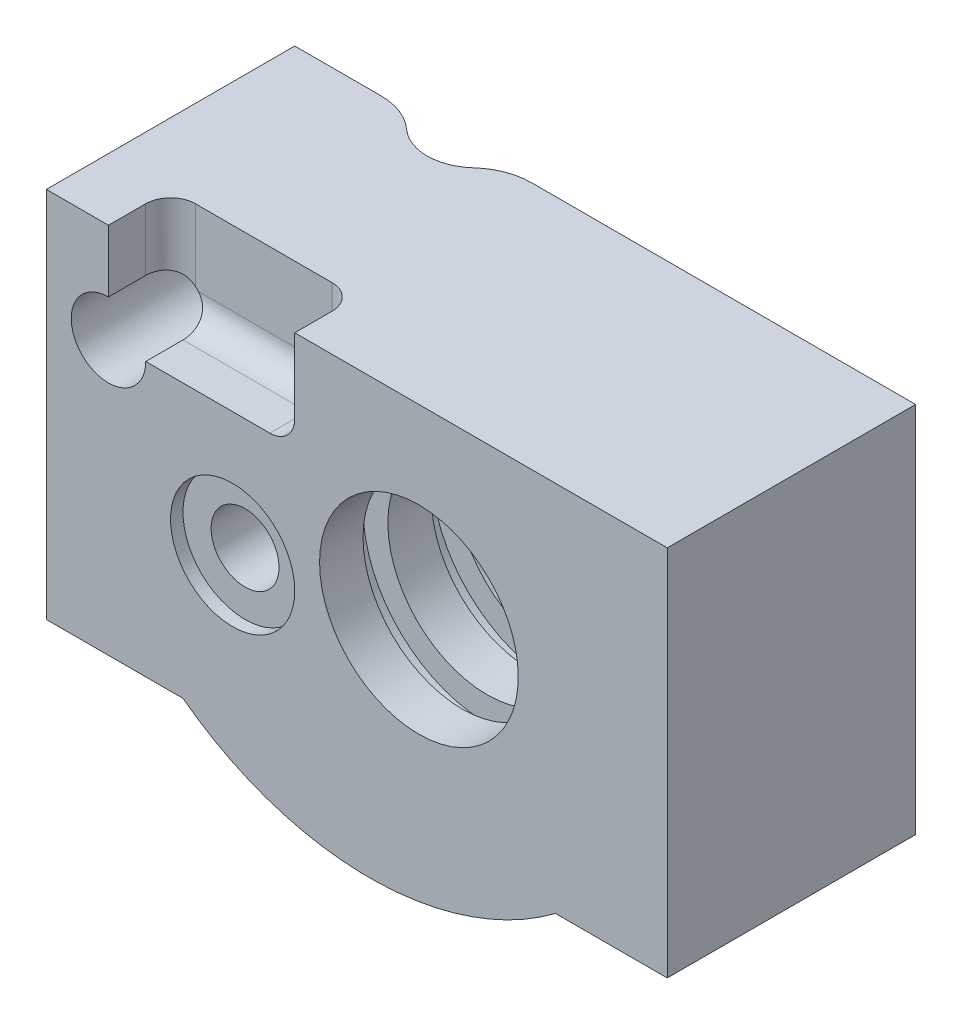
ISO-10303-21;
HEADER;
FILE_DESCRIPTION(('STEP AP214'),'2;1');
FILE_NAME('part.step','',(''),(''),'','','');
FILE_SCHEMA(('AUTOMOTIVE_DESIGN { 1 0 10303 214 1 1 1 1 }'));
ENDSEC;
DATA;
#1=APPLICATION_CONTEXT('core data for automotive mechanical design processes');
#2=APPLICATION_PROTOCOL_DEFINITION('international standard','automotive_design',2000,#1);
#3=PRODUCT_CONTEXT('',#1,'mechanical');
#4=PRODUCT('Part','Part','',(#3));
#5=PRODUCT_RELATED_PRODUCT_CATEGORY('part','',(#4));
#6=PRODUCT_DEFINITION_FORMATION('','',#4);
#7=PRODUCT_DEFINITION_CONTEXT('part definition',#1,'design');
#8=PRODUCT_DEFINITION('design','',#6,#7);
#9=PRODUCT_DEFINITION_SHAPE('','',#8);
#10=(LENGTH_UNIT() NAMED_UNIT(*) SI_UNIT(.MILLI.,.METRE.));
#11=(NAMED_UNIT(*) PLANE_ANGLE_UNIT() SI_UNIT($,.RADIAN.));
#12=(NAMED_UNIT(*) SI_UNIT($,.STERADIAN.) SOLID_ANGLE_UNIT());
#13=UNCERTAINTY_MEASURE_WITH_UNIT(LENGTH_MEASURE(1.E-05),#10,'distance_accuracy_value','');
#14=(GEOMETRIC_REPRESENTATION_CONTEXT(3) GLOBAL_UNCERTAINTY_ASSIGNED_CONTEXT((#13)) GLOBAL_UNIT_ASSIGNED_CONTEXT((#10,
#11,#12)) REPRESENTATION_CONTEXT('',''));
#15=CARTESIAN_POINT('',(0.,0.,0.));
#16=DIRECTION('',(0.,0.,1.));
#17=DIRECTION('',(1.,0.,0.));
#18=AXIS2_PLACEMENT_3D('',#15,#16,#17);
#19=CARTESIAN_POINT('',(0.,0.,0.));
#20=DIRECTION('',(0.,0.,-1.));
#21=DIRECTION('',(-1.,0.,0.));
#22=AXIS2_PLACEMENT_3D('',#19,#20,#21);
#23=CYLINDRICAL_SURFACE('',#22,10.);
#24=CARTESIAN_POINT('',(0.,0.,14.5));
#25=DIRECTION('',(0.,0.,-1.));
#26=DIRECTION('',(-1.,0.,0.));
#27=AXIS2_PLACEMENT_3D('',#24,#25,#26);
#28=CIRCLE('',#27,10.);
#29=CARTESIAN_POINT('',(-10.,0.,14.5));
#30=VERTEX_POINT('',#29);
#31=EDGE_CURVE('E575',#30,#30,#28,.T.);
#32=ORIENTED_EDGE('',*,*,#31,.T.);
#33=EDGE_LOOP('',(#32));
#34=FACE_BOUND('',#33,.T.);
#35=CARTESIAN_POINT('',(0.,0.,16.5));
#36=DIRECTION('',(0.,0.,-1.));
#37=DIRECTION('',(-1.,0.,0.));
#38=AXIS2_PLACEMENT_3D('',#35,#36,#37);
#39=CIRCLE('',#38,10.);
#40=CARTESIAN_POINT('',(-10.,0.,16.5));
#41=VERTEX_POINT('',#40);
#42=EDGE_CURVE('E574',#41,#41,#39,.T.);
#43=ORIENTED_EDGE('',*,*,#42,.F.);
#44=EDGE_LOOP('',(#43));
#45=FACE_BOUND('',#44,.T.);
#46=CARTESIAN_POINT('',(0.,0.,16.));
#47=DIRECTION('',(0.,0.,-1.));
#48=DIRECTION('',(-1.,0.,0.));
#49=AXIS2_PLACEMENT_3D('',#46,#47,#48);
#50=CIRCLE('',#49,10.);
#51=CARTESIAN_POINT('',(3.65612152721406,9.30767293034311,16.));
#52=VERTEX_POINT('',#51);
#53=CARTESIAN_POINT('',(-3.65612152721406,9.30767293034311,16.));
#54=VERTEX_POINT('',#53);
#55=EDGE_CURVE('E689',#52,#54,#50,.F.);
#56=ORIENTED_EDGE('',*,*,#55,.F.);
#57=DIRECTION('',(0.,0.,-1.));
#58=VECTOR('',#57,1.);
#59=CARTESIAN_POINT('',(3.65612152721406,9.30767293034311,0.));
#60=LINE('',#59,#58);
#61=CARTESIAN_POINT('',(3.65612152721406,9.30767293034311,15.));
#62=VERTEX_POINT('',#61);
#63=EDGE_CURVE('E686',#62,#52,#60,.F.);
#64=ORIENTED_EDGE('',*,*,#63,.F.);
#65=CARTESIAN_POINT('',(0.,0.,15.));
#66=DIRECTION('',(0.,0.,1.));
#67=DIRECTION('',(1.,0.,0.));
#68=AXIS2_PLACEMENT_3D('',#65,#66,#67);
#69=CIRCLE('',#68,10.);
#70=CARTESIAN_POINT('',(-3.65612152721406,9.30767293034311,15.));
#71=VERTEX_POINT('',#70);
#72=EDGE_CURVE('E679',#71,#62,#69,.F.);
#73=ORIENTED_EDGE('',*,*,#72,.F.);
#74=DIRECTION('',(0.,0.,-1.));
#75=VECTOR('',#74,1.);
#76=CARTESIAN_POINT('',(-3.65612152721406,9.30767293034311,0.));
#77=LINE('',#76,#75);
#78=EDGE_CURVE('E681',#54,#71,#77,.T.);
#79=ORIENTED_EDGE('',*,*,#78,.F.);
#80=EDGE_LOOP('',(#56,#64,#73,#79));
#81=FACE_BOUND('',#80,.T.);
#82=ADVANCED_FACE('F36',(#34,#45,#81),#23,.F.);
#83=CARTESIAN_POINT('',(-4.,5.,0.));
#84=DIRECTION('',(0.,0.,1.));
#85=DIRECTION('',(1.,0.,0.));
#86=AXIS2_PLACEMENT_3D('',#83,#84,#85);
#87=PLANE('',#86);
#88=CARTESIAN_POINT('',(0.,0.,0.));
#89=DIRECTION('',(0.,0.,-1.));
#90=DIRECTION('',(-1.,0.,0.));
#91=AXIS2_PLACEMENT_3D('',#88,#89,#90);
#92=CIRCLE('',#91,8.);
#93=CARTESIAN_POINT('',(-8.,0.,0.));
#94=VERTEX_POINT('',#93);
#95=EDGE_CURVE('E775',#94,#94,#92,.T.);
#96=ORIENTED_EDGE('',*,*,#95,.F.);
#97=EDGE_LOOP('',(#96));
#98=FACE_BOUND('',#97,.T.);
#99=CARTESIAN_POINT('',(-4.,5.,0.));
#100=DIRECTION('',(0.,0.,1.));
#101=DIRECTION('',(1.,0.,0.));
#102=AXIS2_PLACEMENT_3D('',#99,#100,#101);
#103=CIRCLE('',#102,25.);
#104=CARTESIAN_POINT('',(-10.9468960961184,-19.0154249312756,0.));
#105=VERTEX_POINT('',#104);
#106=CARTESIAN_POINT('',(11.,-15.,0.));
#107=VERTEX_POINT('',#106);
#108=EDGE_CURVE('E624',#105,#107,#103,.T.);
#109=ORIENTED_EDGE('',*,*,#108,.F.);
#110=DIRECTION('',(0.,1.,0.));
#111=VECTOR('',#110,1.);
#112=CARTESIAN_POINT('',(-10.9468960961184,5.,0.));
#113=LINE('',#112,#111);
#114=CARTESIAN_POINT('',(-10.9468960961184,15.,0.));
#115=VERTEX_POINT('',#114);
#116=EDGE_CURVE('E602',#105,#115,#113,.T.);
#117=ORIENTED_EDGE('',*,*,#116,.T.);
#118=DIRECTION('',(-1.,0.,0.));
#119=VECTOR('',#118,1.);
#120=CARTESIAN_POINT('',(-30.,15.,0.));
#121=LINE('',#120,#119);
#122=CARTESIAN_POINT('',(20.,15.,0.));
#123=VERTEX_POINT('',#122);
#124=EDGE_CURVE('E619',#123,#115,#121,.T.);
#125=ORIENTED_EDGE('',*,*,#124,.F.);
#126=DIRECTION('',(0.,1.,0.));
#127=VECTOR('',#126,1.);
#128=CARTESIAN_POINT('',(20.,15.,0.));
#129=LINE('',#128,#127);
#130=CARTESIAN_POINT('',(20.,-15.,0.));
#131=VERTEX_POINT('',#130);
#132=EDGE_CURVE('E628',#131,#123,#129,.T.);
#133=ORIENTED_EDGE('',*,*,#132,.F.);
#134=DIRECTION('',(1.,0.,0.));
#135=VECTOR('',#134,1.);
#136=CARTESIAN_POINT('',(11.,-15.,0.));
#137=LINE('',#136,#135);
#138=EDGE_CURVE('E625',#107,#131,#137,.T.);
#139=ORIENTED_EDGE('',*,*,#138,.F.);
#140=EDGE_LOOP('',(#109,#117,#125,#133,#139));
#141=FACE_BOUND('',#140,.T.);
#142=ADVANCED_FACE('F544',(#98,#141),#87,.F.);
#143=CARTESIAN_POINT('',(-30.,15.,20.));
#144=DIRECTION('',(1.,0.,0.));
#145=DIRECTION('',(0.,1.,0.));
#146=AXIS2_PLACEMENT_3D('',#143,#144,#145);
#147=PLANE('',#146);
#148=DIRECTION('',(0.,-1.,0.));
#149=VECTOR('',#148,1.);
#150=CARTESIAN_POINT('',(-30.,15.,0.));
#151=LINE('',#150,#149);
#152=CARTESIAN_POINT('',(-30.,15.,0.));
#153=VERTEX_POINT('',#152);
#154=CARTESIAN_POINT('',(-30.,-15.,0.));
#155=VERTEX_POINT('',#154);
#156=EDGE_CURVE('E246',#153,#155,#151,.T.);
#157=ORIENTED_EDGE('',*,*,#156,.T.);
#158=DIRECTION('',(0.,0.,-1.));
#159=VECTOR('',#158,1.);
#160=CARTESIAN_POINT('',(-30.,-15.,20.));
#161=LINE('',#160,#159);
#162=CARTESIAN_POINT('',(-30.,-15.,20.));
#163=VERTEX_POINT('',#162);
#164=EDGE_CURVE('E598',#163,#155,#161,.T.);
#165=ORIENTED_EDGE('',*,*,#164,.F.);
#166=DIRECTION('',(0.,-1.,0.));
#167=VECTOR('',#166,1.);
#168=CARTESIAN_POINT('',(-30.,15.,20.));
#169=LINE('',#168,#167);
#170=CARTESIAN_POINT('',(-30.,15.,20.));
#171=VERTEX_POINT('',#170);
#172=EDGE_CURVE('E249',#171,#163,#169,.T.);
#173=ORIENTED_EDGE('',*,*,#172,.F.);
#174=DIRECTION('',(0.,0.,-1.));
#175=VECTOR('',#174,1.);
#176=CARTESIAN_POINT('',(-30.,15.,20.));
#177=LINE('',#176,#175);
#178=EDGE_CURVE('E636',#171,#153,#177,.T.);
#179=ORIENTED_EDGE('',*,*,#178,.T.);
#180=EDGE_LOOP('',(#157,#165,#173,#179));
#181=FACE_BOUND('',#180,.T.);
#182=ADVANCED_FACE('F550',(#181),#147,.F.);
#183=CARTESIAN_POINT('',(-30.,-15.,20.));
#184=DIRECTION('',(0.,1.,0.));
#185=DIRECTION('',(0.,0.,1.));
#186=AXIS2_PLACEMENT_3D('',#183,#184,#185);
#187=PLANE('',#186);
#188=DIRECTION('',(1.,0.,0.));
#189=VECTOR('',#188,1.);
#190=CARTESIAN_POINT('',(-30.,-15.,0.));
#191=LINE('',#190,#189);
#192=CARTESIAN_POINT('',(-23.0531039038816,-15.,0.));
#193=VERTEX_POINT('',#192);
#194=EDGE_CURVE('E626',#155,#193,#191,.T.);
#195=ORIENTED_EDGE('',*,*,#194,.T.);
#196=CARTESIAN_POINT('',(-23.0531039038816,-15.,5.));
#197=DIRECTION('',(0.,1.,0.));
#198=DIRECTION('',(0.,0.,1.));
#199=AXIS2_PLACEMENT_3D('',#196,#197,#198);
#200=CIRCLE('',#199,5.);
#201=CARTESIAN_POINT('',(-19.6902684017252,-15.,1.29981927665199));
#202=VERTEX_POINT('',#201);
#203=EDGE_CURVE('E594',#193,#202,#200,.F.);
#204=ORIENTED_EDGE('',*,*,#203,.T.);
#205=CARTESIAN_POINT('',(-17.,-15.,-1.66032530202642));
#206=DIRECTION('',(0.,1.,0.));
#207=DIRECTION('',(0.,0.,1.));
#208=AXIS2_PLACEMENT_3D('',#205,#206,#207);
#209=CIRCLE('',#208,4.);
#210=CARTESIAN_POINT('',(-19.,-15.,1.80377631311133));
#211=VERTEX_POINT('',#210);
#212=EDGE_CURVE('E247',#202,#211,#209,.T.);
#213=ORIENTED_EDGE('',*,*,#212,.T.);
#214=DIRECTION('',(0.,0.,-1.));
#215=VECTOR('',#214,1.);
#216=CARTESIAN_POINT('',(-19.,-15.,20.));
#217=LINE('',#216,#215);
#218=CARTESIAN_POINT('',(-19.,-15.,20.));
#219=VERTEX_POINT('',#218);
#220=EDGE_CURVE('E591',#219,#211,#217,.T.);
#221=ORIENTED_EDGE('',*,*,#220,.F.);
#222=DIRECTION('',(1.,0.,0.));
#223=VECTOR('',#222,1.);
#224=CARTESIAN_POINT('',(-30.,-15.,20.));
#225=LINE('',#224,#223);
#226=EDGE_CURVE('E655',#163,#219,#225,.T.);
#227=ORIENTED_EDGE('',*,*,#226,.F.);
#228=ORIENTED_EDGE('',*,*,#164,.T.);
#229=EDGE_LOOP('',(#195,#204,#213,#221,#227,#228));
#230=FACE_BOUND('',#229,.T.);
#231=ADVANCED_FACE('F234',(#230),#187,.F.);
#232=CARTESIAN_POINT('',(-4.,5.,20.));
#233=DIRECTION('',(0.,0.,-1.));
#234=DIRECTION('',(-1.,0.,0.));
#235=AXIS2_PLACEMENT_3D('',#232,#233,#234);
#236=CYLINDRICAL_SURFACE('',#235,25.);
#237=CARTESIAN_POINT('',(-19.,-15.,1.80377631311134));
#238=CARTESIAN_POINT('',(-18.8766514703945,-15.092531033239,1.87496960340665));
#239=CARTESIAN_POINT('',(-18.7499284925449,-15.1857713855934,1.93937151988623));
#240=CARTESIAN_POINT('',(-18.4905979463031,-15.3727248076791,2.05427814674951));
#241=CARTESIAN_POINT('',(-18.3579886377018,-15.4664380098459,2.10477871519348));
#242=CARTESIAN_POINT('',(-18.0871607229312,-15.6537939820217,2.191738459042));
#243=CARTESIAN_POINT('',(-17.9489177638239,-15.7474341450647,2.22812744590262));
#244=CARTESIAN_POINT('',(-17.6684245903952,-15.9332856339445,2.28602914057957));
#245=CARTESIAN_POINT('',(-17.5261748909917,-16.0254971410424,2.30754375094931));
#246=CARTESIAN_POINT('',(-17.2473858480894,-16.2021780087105,2.33432278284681));
#247=CARTESIAN_POINT('',(-17.1110167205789,-16.2867797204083,2.3404856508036));
#248=CARTESIAN_POINT('',(-16.836738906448,-16.4532948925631,2.33869315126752));
#249=CARTESIAN_POINT('',(-16.6988303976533,-16.5352086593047,2.33073939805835));
#250=CARTESIAN_POINT('',(-16.4229333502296,-16.6955325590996,2.30025769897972));
#251=CARTESIAN_POINT('',(-16.2849454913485,-16.7739492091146,2.27775818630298));
#252=CARTESIAN_POINT('',(-16.010012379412,-16.926794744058,2.21778154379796));
#253=CARTESIAN_POINT('',(-15.873066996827,-17.0012241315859,2.18030630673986));
#254=CARTESIAN_POINT('',(-15.6141808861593,-17.1388866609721,2.09418933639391));
#255=CARTESIAN_POINT('',(-15.4920111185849,-17.202521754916,2.0468783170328));
#256=CARTESIAN_POINT('',(-15.2511730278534,-17.3255320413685,1.93953276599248));
#257=CARTESIAN_POINT('',(-15.1325040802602,-17.3849079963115,1.87950051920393));
#258=CARTESIAN_POINT('',(-14.9000796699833,-17.4990006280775,1.74676245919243));
#259=CARTESIAN_POINT('',(-14.7863247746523,-17.5537167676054,1.67405518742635));
#260=CARTESIAN_POINT('',(-14.5652885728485,-17.6581025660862,1.5162466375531));
#261=CARTESIAN_POINT('',(-14.4580058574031,-17.7077733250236,1.43114807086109));
#262=CARTESIAN_POINT('',(-14.2657805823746,-17.7952476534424,1.26168046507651));
#263=CARTESIAN_POINT('',(-14.1798010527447,-17.8337422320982,1.1788403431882));
#264=CARTESIAN_POINT('',(-14.0148134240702,-17.9065851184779,1.00482544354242));
#265=CARTESIAN_POINT('',(-13.9358040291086,-17.9409341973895,0.913652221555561));
#266=CARTESIAN_POINT('',(-13.7859206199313,-18.0052688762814,0.72384790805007));
#267=CARTESIAN_POINT('',(-13.7150254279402,-18.0352658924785,0.625237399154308));
#268=CARTESIAN_POINT('',(-13.5820659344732,-18.0908900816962,0.421149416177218));
#269=CARTESIAN_POINT('',(-13.519994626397,-18.1165207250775,0.315677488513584));
#270=CARTESIAN_POINT('',(-13.4447966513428,-18.1472717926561,0.173253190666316));
#271=CARTESIAN_POINT('',(-13.4273235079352,-18.1543928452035,0.138971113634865));
#272=CARTESIAN_POINT('',(-13.3933587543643,-18.1681925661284,0.0698820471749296));
#273=CARTESIAN_POINT('',(-13.3768661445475,-18.1748716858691,0.035075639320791));
#274=CARTESIAN_POINT('',(-13.3608627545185,-18.1813340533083,0.));
#275=B_SPLINE_CURVE_WITH_KNOTS('',3,(#237,#238,#239,#240,#241,#242,#243,#244,#245,#246,#247,
#248,#249,#250,#251,#252,#253,#254,#255,#256,#257,#258,#259,#260,#261,#262,#263,#264,#265,#266,
#267,#268,#269,#270,#271,#272,#273,#274),.UNSPECIFIED.,.F.,.F.,(4,2,2,2,2,2,2,2,2,2,2,2,2,2,2,2,
2,2,4),(0.,0.509334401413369,1.01882039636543,1.53080894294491,2.04273198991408,
2.52390640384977,3.00502579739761,3.48520755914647,3.96532865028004,4.40164585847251,
4.83788476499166,5.27417390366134,5.71036771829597,6.08619501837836,6.46195229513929,
6.83670534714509,7.21115914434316,7.32854097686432,7.44580101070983),.UNSPECIFIED.);
#276=CARTESIAN_POINT('',(-14.3097315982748,-17.7751933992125,1.299819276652));
#277=VERTEX_POINT('',#276);
#278=EDGE_CURVE('E239',#211,#277,#275,.T.);
#279=ORIENTED_EDGE('',*,*,#278,.T.);
#280=CARTESIAN_POINT('',(-14.3097315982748,-17.7751933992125,1.29981927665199));
#281=CARTESIAN_POINT('',(-14.1978751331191,-17.8258366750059,1.19815632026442));
#282=CARTESIAN_POINT('',(-14.0816547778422,-17.8774454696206,1.10179760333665));
#283=CARTESIAN_POINT('',(-13.8413583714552,-17.9818343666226,0.920201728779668));
#284=CARTESIAN_POINT('',(-13.7172839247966,-18.0346142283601,0.834962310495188));
#285=CARTESIAN_POINT('',(-13.4657670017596,-18.1390857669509,0.678356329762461));
#286=CARTESIAN_POINT('',(-13.338523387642,-18.1907652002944,0.606661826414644));
#287=CARTESIAN_POINT('',(-13.0781893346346,-18.2939063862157,0.474639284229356));
#288=CARTESIAN_POINT('',(-12.9450989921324,-18.3453681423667,0.414311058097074));
#289=CARTESIAN_POINT('',(-12.6652657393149,-18.4507335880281,0.301984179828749));
#290=CARTESIAN_POINT('',(-12.5181924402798,-18.5045849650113,0.250757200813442));
#291=CARTESIAN_POINT('',(-12.2193957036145,-18.6107325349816,0.162125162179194));
#292=CARTESIAN_POINT('',(-12.0676723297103,-18.6630287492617,0.12471991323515));
#293=CARTESIAN_POINT('',(-11.7558575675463,-18.7670874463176,0.0632397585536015));
#294=CARTESIAN_POINT('',(-11.5956530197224,-18.8187815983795,0.0396203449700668));
#295=CARTESIAN_POINT('',(-11.2727716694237,-18.9193577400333,0.00798840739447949));
#296=CARTESIAN_POINT('',(-11.1100938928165,-18.9682385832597,-1.77976235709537E-05));
#297=CARTESIAN_POINT('',(-10.9468960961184,-19.0154249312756,0.));
#298=B_SPLINE_CURVE_WITH_KNOTS('',3,(#280,#281,#282,#283,#284,#285,#286,#287,#288,#289,#290,
#291,#292,#293,#294,#295,#296,#297),.UNSPECIFIED.,.F.,.F.,(4,2,2,2,2,2,2,2,4),(0.,
0.478065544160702,0.956033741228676,1.42028420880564,1.8845270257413,2.37823435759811,
2.87193492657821,3.381138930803,3.89054897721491),.UNSPECIFIED.);
#299=EDGE_CURVE('E209',#277,#105,#298,.T.);
#300=ORIENTED_EDGE('',*,*,#299,.T.);
#301=ORIENTED_EDGE('',*,*,#108,.T.);
#302=DIRECTION('',(0.,0.,-1.));
#303=VECTOR('',#302,1.);
#304=CARTESIAN_POINT('',(11.,-15.,20.));
#305=LINE('',#304,#303);
#306=CARTESIAN_POINT('',(11.,-15.,20.));
#307=VERTEX_POINT('',#306);
#308=EDGE_CURVE('E599',#307,#107,#305,.T.);
#309=ORIENTED_EDGE('',*,*,#308,.F.);
#310=CARTESIAN_POINT('',(-4.,5.,20.));
#311=DIRECTION('',(0.,0.,1.));
#312=DIRECTION('',(1.,0.,0.));
#313=AXIS2_PLACEMENT_3D('',#310,#311,#312);
#314=CIRCLE('',#313,25.);
#315=EDGE_CURVE('E597',#219,#307,#314,.T.);
#316=ORIENTED_EDGE('',*,*,#315,.F.);
#317=ORIENTED_EDGE('',*,*,#220,.T.);
#318=EDGE_LOOP('',(#279,#300,#301,#309,#316,#317));
#319=FACE_BOUND('',#318,.T.);
#320=ADVANCED_FACE('F228',(#319),#236,.T.);
#321=CARTESIAN_POINT('',(11.,-15.,20.));
#322=DIRECTION('',(0.,1.,0.));
#323=DIRECTION('',(0.,0.,1.));
#324=AXIS2_PLACEMENT_3D('',#321,#322,#323);
#325=PLANE('',#324);
#326=ORIENTED_EDGE('',*,*,#138,.T.);
#327=DIRECTION('',(0.,0.,-1.));
#328=VECTOR('',#327,1.);
#329=CARTESIAN_POINT('',(20.,-15.,20.));
#330=LINE('',#329,#328);
#331=CARTESIAN_POINT('',(20.,-15.,20.));
#332=VERTEX_POINT('',#331);
#333=EDGE_CURVE('E605',#332,#131,#330,.T.);
#334=ORIENTED_EDGE('',*,*,#333,.F.);
#335=DIRECTION('',(1.,0.,0.));
#336=VECTOR('',#335,1.);
#337=CARTESIAN_POINT('',(11.,-15.,20.));
#338=LINE('',#337,#336);
#339=EDGE_CURVE('E650',#307,#332,#338,.T.);
#340=ORIENTED_EDGE('',*,*,#339,.F.);
#341=ORIENTED_EDGE('',*,*,#308,.T.);
#342=EDGE_LOOP('',(#326,#334,#340,#341));
#343=FACE_BOUND('',#342,.T.);
#344=ADVANCED_FACE('F233',(#343),#325,.F.);
#345=CARTESIAN_POINT('',(20.,15.,20.));
#346=DIRECTION('',(-1.,0.,0.));
#347=DIRECTION('',(0.,-1.,0.));
#348=AXIS2_PLACEMENT_3D('',#345,#346,#347);
#349=PLANE('',#348);
#350=ORIENTED_EDGE('',*,*,#132,.T.);
#351=DIRECTION('',(0.,0.,-1.));
#352=VECTOR('',#351,1.);
#353=CARTESIAN_POINT('',(20.,15.,20.));
#354=LINE('',#353,#352);
#355=CARTESIAN_POINT('',(20.,15.,20.));
#356=VERTEX_POINT('',#355);
#357=EDGE_CURVE('E639',#356,#123,#354,.T.);
#358=ORIENTED_EDGE('',*,*,#357,.F.);
#359=DIRECTION('',(0.,1.,0.));
#360=VECTOR('',#359,1.);
#361=CARTESIAN_POINT('',(20.,15.,20.));
#362=LINE('',#361,#360);
#363=EDGE_CURVE('E647',#332,#356,#362,.T.);
#364=ORIENTED_EDGE('',*,*,#363,.F.);
#365=ORIENTED_EDGE('',*,*,#333,.T.);
#366=EDGE_LOOP('',(#350,#358,#364,#365));
#367=FACE_BOUND('',#366,.T.);
#368=ADVANCED_FACE('F645',(#367),#349,.F.);
#369=CARTESIAN_POINT('',(-30.,15.,20.));
#370=DIRECTION('',(0.,-1.,0.));
#371=DIRECTION('',(0.,0.,-1.));
#372=AXIS2_PLACEMENT_3D('',#369,#370,#371);
#373=PLANE('',#372);
#374=DIRECTION('',(-1.,0.,0.));
#375=VECTOR('',#374,1.);
#376=CARTESIAN_POINT('',(-30.,15.,20.));
#377=LINE('',#376,#375);
#378=CARTESIAN_POINT('',(-25.,15.,20.));
#379=VERTEX_POINT('',#378);
#380=EDGE_CURVE('E653',#379,#171,#377,.T.);
#381=ORIENTED_EDGE('',*,*,#380,.F.);
#382=DIRECTION('',(0.,0.,1.));
#383=VECTOR('',#382,1.);
#384=CARTESIAN_POINT('',(-25.,15.,15.));
#385=LINE('',#384,#383);
#386=CARTESIAN_POINT('',(-25.,15.,17.));
#387=VERTEX_POINT('',#386);
#388=EDGE_CURVE('E766',#387,#379,#385,.T.);
#389=ORIENTED_EDGE('',*,*,#388,.F.);
#390=CARTESIAN_POINT('',(-23.,15.,17.));
#391=DIRECTION('',(0.,-1.,0.));
#392=DIRECTION('',(0.,0.,-1.));
#393=AXIS2_PLACEMENT_3D('',#390,#391,#392);
#394=CIRCLE('',#393,2.);
#395=CARTESIAN_POINT('',(-23.,15.,15.));
#396=VERTEX_POINT('',#395);
#397=EDGE_CURVE('E714',#387,#396,#394,.T.);
#398=ORIENTED_EDGE('',*,*,#397,.T.);
#399=DIRECTION('',(-1.,0.,0.));
#400=VECTOR('',#399,1.);
#401=CARTESIAN_POINT('',(-25.,15.,15.));
#402=LINE('',#401,#400);
#403=CARTESIAN_POINT('',(-12.,15.,15.));
#404=VERTEX_POINT('',#403);
#405=EDGE_CURVE('E756',#404,#396,#402,.T.);
#406=ORIENTED_EDGE('',*,*,#405,.F.);
#407=CARTESIAN_POINT('',(-12.,15.,17.));
#408=DIRECTION('',(0.,-1.,0.));
#409=DIRECTION('',(0.,0.,-1.));
#410=AXIS2_PLACEMENT_3D('',#407,#408,#409);
#411=CIRCLE('',#410,2.);
#412=CARTESIAN_POINT('',(-10.,15.,17.));
#413=VERTEX_POINT('',#412);
#414=EDGE_CURVE('E716',#404,#413,#411,.T.);
#415=ORIENTED_EDGE('',*,*,#414,.T.);
#416=DIRECTION('',(0.,0.,1.));
#417=VECTOR('',#416,1.);
#418=CARTESIAN_POINT('',(-10.,15.,15.));
#419=LINE('',#418,#417);
#420=CARTESIAN_POINT('',(-10.,15.,20.));
#421=VERTEX_POINT('',#420);
#422=EDGE_CURVE('E759',#413,#421,#419,.T.);
#423=ORIENTED_EDGE('',*,*,#422,.T.);
#424=EDGE_CURVE('E640',#356,#421,#377,.T.);
#425=ORIENTED_EDGE('',*,*,#424,.F.);
#426=ORIENTED_EDGE('',*,*,#357,.T.);
#427=ORIENTED_EDGE('',*,*,#124,.T.);
#428=CARTESIAN_POINT('',(-10.9468960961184,15.,5.));
#429=DIRECTION('',(0.,-1.,0.));
#430=DIRECTION('',(0.,0.,-1.));
#431=AXIS2_PLACEMENT_3D('',#428,#429,#430);
#432=CIRCLE('',#431,5.);
#433=CARTESIAN_POINT('',(-14.3097315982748,15.,1.29981927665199));
#434=VERTEX_POINT('',#433);
#435=EDGE_CURVE('E212',#115,#434,#432,.F.);
#436=ORIENTED_EDGE('',*,*,#435,.T.);
#437=CARTESIAN_POINT('',(-17.,15.,-1.66032530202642));
#438=DIRECTION('',(0.,1.,0.));
#439=DIRECTION('',(0.,0.,1.));
#440=AXIS2_PLACEMENT_3D('',#437,#438,#439);
#441=CIRCLE('',#440,4.);
#442=CARTESIAN_POINT('',(-19.6902684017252,15.,1.29981927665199));
#443=VERTEX_POINT('',#442);
#444=EDGE_CURVE('E584',#443,#434,#441,.T.);
#445=ORIENTED_EDGE('',*,*,#444,.F.);
#446=CARTESIAN_POINT('',(-23.0531039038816,15.,5.));
#447=DIRECTION('',(0.,-1.,0.));
#448=DIRECTION('',(0.,0.,-1.));
#449=AXIS2_PLACEMENT_3D('',#446,#447,#448);
#450=CIRCLE('',#449,5.);
#451=CARTESIAN_POINT('',(-23.0531039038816,15.,0.));
#452=VERTEX_POINT('',#451);
#453=EDGE_CURVE('E611',#443,#452,#450,.F.);
#454=ORIENTED_EDGE('',*,*,#453,.T.);
#455=EDGE_CURVE('E634',#452,#153,#121,.T.);
#456=ORIENTED_EDGE('',*,*,#455,.T.);
#457=ORIENTED_EDGE('',*,*,#178,.F.);
#458=EDGE_LOOP('',(#381,#389,#398,#406,#415,#423,#425,#426,#427,#436,#445,#454,#456,#457));
#459=FACE_BOUND('',#458,.T.);
#460=ADVANCED_FACE('F615',(#459),#373,.F.);
#461=CARTESIAN_POINT('',(-4.,5.,20.));
#462=DIRECTION('',(0.,0.,1.));
#463=DIRECTION('',(1.,0.,0.));
#464=AXIS2_PLACEMENT_3D('',#461,#462,#463);
#465=PLANE('',#464);
#466=CARTESIAN_POINT('',(-15.,-3.,20.));
#467=DIRECTION('',(0.,0.,1.));
#468=DIRECTION('',(1.,0.,0.));
#469=AXIS2_PLACEMENT_3D('',#466,#467,#468);
#470=CIRCLE('',#469,5.);
#471=CARTESIAN_POINT('',(-10.,-3.,20.));
#472=VERTEX_POINT('',#471);
#473=EDGE_CURVE('E266',#472,#472,#470,.T.);
#474=ORIENTED_EDGE('',*,*,#473,.F.);
#475=EDGE_LOOP('',(#474));
#476=FACE_BOUND('',#475,.T.);
#477=CARTESIAN_POINT('',(-25.,7.,20.));
#478=DIRECTION('',(0.,0.,1.));
#479=DIRECTION('',(1.,0.,0.));
#480=AXIS2_PLACEMENT_3D('',#477,#478,#479);
#481=CIRCLE('',#480,3.);
#482=CARTESIAN_POINT('',(-25.,10.,20.));
#483=VERTEX_POINT('',#482);
#484=CARTESIAN_POINT('',(-22.,7.,20.));
#485=VERTEX_POINT('',#484);
#486=EDGE_CURVE('E203',#483,#485,#481,.T.);
#487=ORIENTED_EDGE('',*,*,#486,.F.);
#488=DIRECTION('',(0.,-1.,0.));
#489=VECTOR('',#488,1.);
#490=CARTESIAN_POINT('',(-25.,15.,20.));
#491=LINE('',#490,#489);
#492=EDGE_CURVE('E675',#379,#483,#491,.T.);
#493=ORIENTED_EDGE('',*,*,#492,.F.);
#494=ORIENTED_EDGE('',*,*,#380,.T.);
#495=ORIENTED_EDGE('',*,*,#172,.T.);
#496=ORIENTED_EDGE('',*,*,#226,.T.);
#497=ORIENTED_EDGE('',*,*,#315,.T.);
#498=ORIENTED_EDGE('',*,*,#339,.T.);
#499=ORIENTED_EDGE('',*,*,#363,.T.);
#500=ORIENTED_EDGE('',*,*,#424,.T.);
#501=DIRECTION('',(0.,1.,0.));
#502=VECTOR('',#501,1.);
#503=CARTESIAN_POINT('',(-10.,15.,20.));
#504=LINE('',#503,#502);
#505=CARTESIAN_POINT('',(-10.,9.,20.));
#506=VERTEX_POINT('',#505);
#507=EDGE_CURVE('E760',#506,#421,#504,.T.);
#508=ORIENTED_EDGE('',*,*,#507,.F.);
#509=CARTESIAN_POINT('',(-12.,9.,20.));
#510=DIRECTION('',(0.,0.,1.));
#511=DIRECTION('',(1.,0.,0.));
#512=AXIS2_PLACEMENT_3D('',#509,#510,#511);
#513=CIRCLE('',#512,2.);
#514=CARTESIAN_POINT('',(-12.,7.,20.));
#515=VERTEX_POINT('',#514);
#516=EDGE_CURVE('E711',#506,#515,#513,.F.);
#517=ORIENTED_EDGE('',*,*,#516,.T.);
#518=DIRECTION('',(1.,0.,0.));
#519=VECTOR('',#518,1.);
#520=CARTESIAN_POINT('',(-25.,7.,20.));
#521=LINE('',#520,#519);
#522=EDGE_CURVE('E762',#485,#515,#521,.T.);
#523=ORIENTED_EDGE('',*,*,#522,.F.);
#524=EDGE_LOOP('',(#487,#493,#494,#495,#496,#497,#498,#499,#500,#508,#517,#523));
#525=FACE_BOUND('',#524,.T.);
#526=CARTESIAN_POINT('',(0.,0.,20.));
#527=DIRECTION('',(0.,0.,-1.));
#528=DIRECTION('',(-1.,0.,0.));
#529=AXIS2_PLACEMENT_3D('',#526,#527,#528);
#530=CIRCLE('',#529,8.);
#531=CARTESIAN_POINT('',(-8.,0.,20.));
#532=VERTEX_POINT('',#531);
#533=EDGE_CURVE('E577',#532,#532,#530,.T.);
#534=ORIENTED_EDGE('',*,*,#533,.T.);
#535=EDGE_LOOP('',(#534));
#536=FACE_BOUND('',#535,.T.);
#537=ADVANCED_FACE('F258',(#476,#525,#536),#465,.T.);
#538=DIRECTION('',(0.,1.,0.));
#539=VECTOR('',#538,1.);
#540=CARTESIAN_POINT('',(-23.0531039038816,5.,0.));
#541=LINE('',#540,#539);
#542=CARTESIAN_POINT('',(-23.0531039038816,9.28245385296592,0.));
#543=VERTEX_POINT('',#542);
#544=EDGE_CURVE('E223',#452,#543,#541,.F.);
#545=ORIENTED_EDGE('',*,*,#544,.T.);
#546=CARTESIAN_POINT('',(-25.,7.,0.));
#547=DIRECTION('',(0.,0.,1.));
#548=DIRECTION('',(1.,0.,0.));
#549=AXIS2_PLACEMENT_3D('',#546,#547,#548);
#550=CIRCLE('',#549,3.);
#551=CARTESIAN_POINT('',(-23.0531039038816,4.71754614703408,0.));
#552=VERTEX_POINT('',#551);
#553=EDGE_CURVE('E63',#543,#552,#550,.T.);
#554=ORIENTED_EDGE('',*,*,#553,.T.);
#555=EDGE_CURVE('E222',#552,#193,#541,.F.);
#556=ORIENTED_EDGE('',*,*,#555,.T.);
#557=ORIENTED_EDGE('',*,*,#194,.F.);
#558=ORIENTED_EDGE('',*,*,#156,.F.);
#559=ORIENTED_EDGE('',*,*,#455,.F.);
#560=EDGE_LOOP('',(#545,#554,#556,#557,#558,#559));
#561=FACE_BOUND('',#560,.T.);
#562=ADVANCED_FACE('F255',(#561),#87,.F.);
#563=CARTESIAN_POINT('',(-17.,-20.,-1.66032530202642));
#564=DIRECTION('',(0.,1.,0.));
#565=DIRECTION('',(0.,0.,1.));
#566=AXIS2_PLACEMENT_3D('',#563,#564,#565);
#567=CYLINDRICAL_SURFACE('',#566,4.);
#568=DIRECTION('',(0.,1.,0.));
#569=VECTOR('',#568,1.);
#570=CARTESIAN_POINT('',(-14.3097315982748,-20.,1.29981927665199));
#571=LINE('',#570,#569);
#572=CARTESIAN_POINT('',(-14.3097315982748,-0.353846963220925,1.29981927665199));
#573=VERTEX_POINT('',#572);
#574=EDGE_CURVE('E202',#434,#573,#571,.F.);
#575=ORIENTED_EDGE('',*,*,#574,.T.);
#576=CARTESIAN_POINT('',(-14.3097315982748,-0.353846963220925,1.29981927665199));
#577=CARTESIAN_POINT('',(-14.3670238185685,-0.338899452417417,1.35189784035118));
#578=CARTESIAN_POINT('',(-14.4260795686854,-0.325484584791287,1.40252226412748));
#579=CARTESIAN_POINT('',(-14.5475407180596,-0.302278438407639,1.50061271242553));
#580=CARTESIAN_POINT('',(-14.6099497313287,-0.292491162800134,1.54807520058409));
#581=CARTESIAN_POINT('',(-14.7382636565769,-0.277079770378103,1.63979796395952));
#582=CARTESIAN_POINT('',(-14.8041901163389,-0.271485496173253,1.68403329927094));
#583=CARTESIAN_POINT('',(-14.9387163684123,-0.265155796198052,1.76858375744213));
#584=CARTESIAN_POINT('',(-15.0073152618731,-0.264418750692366,1.80890018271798));
#585=CARTESIAN_POINT('',(-15.1472146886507,-0.26836018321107,1.8856014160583));
#586=CARTESIAN_POINT('',(-15.218531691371,-0.273079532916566,1.92195429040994));
#587=CARTESIAN_POINT('',(-15.362683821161,-0.288485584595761,1.99009257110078));
#588=CARTESIAN_POINT('',(-15.4355187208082,-0.299171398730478,2.02187865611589));
#589=CARTESIAN_POINT('',(-15.581631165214,-0.326836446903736,2.08058365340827));
#590=CARTESIAN_POINT('',(-15.6549059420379,-0.343791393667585,2.10752076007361));
#591=CARTESIAN_POINT('',(-15.8012337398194,-0.384203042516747,2.1566011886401));
#592=CARTESIAN_POINT('',(-15.8742867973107,-0.407658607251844,2.17874534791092));
#593=CARTESIAN_POINT('',(-16.0719221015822,-0.480615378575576,2.23267052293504));
#594=CARTESIAN_POINT('',(-16.1954508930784,-0.536668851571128,2.2597931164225));
#595=CARTESIAN_POINT('',(-16.4343972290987,-0.667678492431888,2.30135074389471));
#596=CARTESIAN_POINT('',(-16.5498061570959,-0.742654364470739,2.31577248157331));
#597=CARTESIAN_POINT('',(-16.7652483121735,-0.907079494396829,2.33420169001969));
#598=CARTESIAN_POINT('',(-16.8656354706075,-0.996034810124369,2.33850470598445));
#599=CARTESIAN_POINT('',(-17.052307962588,-1.18767056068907,2.34042384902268));
#600=CARTESIAN_POINT('',(-17.138593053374,-1.29035123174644,2.33803986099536));
#601=CARTESIAN_POINT('',(-17.3018640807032,-1.51639719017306,2.32917815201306));
#602=CARTESIAN_POINT('',(-17.377423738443,-1.64078044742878,2.32236777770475));
#603=CARTESIAN_POINT('',(-17.5078867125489,-1.89992549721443,2.30784480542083));
#604=CARTESIAN_POINT('',(-17.5627823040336,-2.03469114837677,2.30013187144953));
#605=CARTESIAN_POINT('',(-17.653119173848,-2.31945723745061,2.28627724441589));
#606=CARTESIAN_POINT('',(-17.6872327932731,-2.46988767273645,2.28025402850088));
#607=CARTESIAN_POINT('',(-17.7297161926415,-2.7744344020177,2.27261145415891));
#608=CARTESIAN_POINT('',(-17.7380900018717,-2.92855011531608,2.27099140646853));
#609=CARTESIAN_POINT('',(-17.7288914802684,-3.23424374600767,2.27270573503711));
#610=CARTESIAN_POINT('',(-17.7116082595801,-3.38583076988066,2.27598490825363));
#611=CARTESIAN_POINT('',(-17.6521593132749,-3.68392755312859,2.28626611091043));
#612=CARTESIAN_POINT('',(-17.6099885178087,-3.8304362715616,2.29326889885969));
#613=CARTESIAN_POINT('',(-17.5018278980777,-4.11474201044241,2.30844530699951));
#614=CARTESIAN_POINT('',(-17.4357767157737,-4.25251550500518,2.31662191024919));
#615=CARTESIAN_POINT('',(-17.2815973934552,-4.5152935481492,2.33049846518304));
#616=CARTESIAN_POINT('',(-17.1934659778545,-4.64029619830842,2.33619804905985));
#617=CARTESIAN_POINT('',(-16.9968725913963,-4.87473564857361,2.34088673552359));
#618=CARTESIAN_POINT('',(-16.8882856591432,-4.984069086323,2.33983320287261));
#619=CARTESIAN_POINT('',(-16.6546900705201,-5.18266926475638,2.32645108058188));
#620=CARTESIAN_POINT('',(-16.5296931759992,-5.27195025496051,2.314130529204));
#621=CARTESIAN_POINT('',(-16.2779209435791,-5.42185541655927,2.27586437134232));
#622=CARTESIAN_POINT('',(-16.1519511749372,-5.48410322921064,2.2509864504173));
#623=CARTESIAN_POINT('',(-15.8954077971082,-5.58765255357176,2.18640349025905));
#624=CARTESIAN_POINT('',(-15.7648385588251,-5.62897340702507,2.14671220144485));
#625=CARTESIAN_POINT('',(-15.5132922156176,-5.6890003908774,2.05537025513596));
#626=CARTESIAN_POINT('',(-15.3922670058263,-5.70905410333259,2.00471723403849));
#627=CARTESIAN_POINT('',(-15.1543870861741,-5.73296343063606,1.89089172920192));
#628=CARTESIAN_POINT('',(-15.0375407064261,-5.73678830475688,1.82769572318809));
#629=CARTESIAN_POINT('',(-14.813734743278,-5.730594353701,1.69183596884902));
#630=CARTESIAN_POINT('',(-14.7066064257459,-5.72090162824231,1.61943224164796));
#631=CARTESIAN_POINT('',(-14.5525686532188,-5.69834871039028,1.50419421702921));
#632=CARTESIAN_POINT('',(-14.5024275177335,-5.68952157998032,1.46476339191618));
#633=CARTESIAN_POINT('',(-14.4043866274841,-5.66952032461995,1.38382079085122));
#634=CARTESIAN_POINT('',(-14.3564856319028,-5.65834751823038,1.34231019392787));
#635=CARTESIAN_POINT('',(-14.3097315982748,-5.64615303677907,1.29981927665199));
#636=B_SPLINE_CURVE_WITH_KNOTS('',3,(#576,#577,#578,#579,#580,#581,#582,#583,#584,#585,#586,
#587,#588,#589,#590,#591,#592,#593,#594,#595,#596,#597,#598,#599,#600,#601,#602,#603,#604,#605,
#606,#607,#608,#609,#610,#611,#612,#613,#614,#615,#616,#617,#618,#619,#620,#621,#622,#623,#624,
#625,#626,#627,#628,#629,#630,#631,#632,#633,#634,#635),.UNSPECIFIED.,.F.,.F.,(4,2,2,2,2,2,2,2,
2,2,2,2,2,2,2,2,2,2,2,2,2,2,2,2,2,2,2,2,2,4),(0.,0.236560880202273,0.473382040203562,
0.711873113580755,0.950284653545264,1.19049367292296,1.43066695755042,1.66991937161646,
1.90912995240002,2.32182800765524,2.73495759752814,3.13586206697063,3.53677343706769,
3.97196998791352,4.40732906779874,4.86818550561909,5.32896979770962,5.78460110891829,
6.24032526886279,6.69722878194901,7.15420011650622,7.61405933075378,8.07359072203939,
8.49935592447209,8.92472689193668,9.32115139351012,9.71832646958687,10.106084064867,
10.2991756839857,10.4921590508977),.UNSPECIFIED.);
#637=CARTESIAN_POINT('',(-14.3097315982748,-5.64615303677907,1.29981927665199));
#638=VERTEX_POINT('',#637);
#639=EDGE_CURVE('E56',#573,#638,#636,.T.);
#640=ORIENTED_EDGE('',*,*,#639,.T.);
#641=EDGE_CURVE('E199',#638,#277,#571,.F.);
#642=ORIENTED_EDGE('',*,*,#641,.T.);
#643=ORIENTED_EDGE('',*,*,#278,.F.);
#644=ORIENTED_EDGE('',*,*,#212,.F.);
#645=DIRECTION('',(0.,1.,0.));
#646=VECTOR('',#645,1.);
#647=CARTESIAN_POINT('',(-19.6902684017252,-20.,1.29981927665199));
#648=LINE('',#647,#646);
#649=EDGE_CURVE('E210',#202,#443,#648,.T.);
#650=ORIENTED_EDGE('',*,*,#649,.T.);
#651=ORIENTED_EDGE('',*,*,#444,.T.);
#652=EDGE_LOOP('',(#575,#640,#642,#643,#644,#650,#651));
#653=FACE_BOUND('',#652,.T.);
#654=ADVANCED_FACE('F197',(#653),#567,.F.);
#655=CARTESIAN_POINT('',(-10.9468960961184,-20.,5.));
#656=DIRECTION('',(0.,1.,0.));
#657=DIRECTION('',(0.,0.,1.));
#658=AXIS2_PLACEMENT_3D('',#655,#656,#657);
#659=CYLINDRICAL_SURFACE('',#658,5.);
#660=CARTESIAN_POINT('',(-14.3097315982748,-0.353846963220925,1.29981927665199));
#661=CARTESIAN_POINT('',(-14.2525353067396,-0.368760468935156,1.24781669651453));
#662=CARTESIAN_POINT('',(-14.1944120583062,-0.385909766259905,1.19743520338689));
#663=CARTESIAN_POINT('',(-14.076859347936,-0.425074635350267,1.10011331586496));
#664=CARTESIAN_POINT('',(-14.0174288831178,-0.44709406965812,1.05317569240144));
#665=CARTESIAN_POINT('',(-13.8977510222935,-0.496433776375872,0.962909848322));
#666=CARTESIAN_POINT('',(-13.8375019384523,-0.523767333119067,0.919591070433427));
#667=CARTESIAN_POINT('',(-13.7170788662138,-0.58396219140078,0.836898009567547));
#668=CARTESIAN_POINT('',(-13.6569048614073,-0.616821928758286,0.797522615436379));
#669=CARTESIAN_POINT('',(-13.5370757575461,-0.688431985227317,0.722618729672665));
#670=CARTESIAN_POINT('',(-13.4774254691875,-0.727214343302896,0.687113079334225));
#671=CARTESIAN_POINT('',(-13.3598545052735,-0.810545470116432,0.620250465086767));
#672=CARTESIAN_POINT('',(-13.3019337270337,-0.855093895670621,0.588893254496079));
#673=CARTESIAN_POINT('',(-13.18880539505,-0.949733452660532,0.530336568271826));
#674=CARTESIAN_POINT('',(-13.1335922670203,-0.999812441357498,0.503128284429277));
#675=CARTESIAN_POINT('',(-13.0265936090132,-1.10529180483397,0.452653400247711));
#676=CARTESIAN_POINT('',(-12.9748077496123,-1.16069166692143,0.429386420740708));
#677=CARTESIAN_POINT('',(-12.8344798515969,-1.32416998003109,0.368935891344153));
#678=CARTESIAN_POINT('',(-12.7507455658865,-1.43809325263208,0.336049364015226));
#679=CARTESIAN_POINT('',(-12.6010621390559,-1.67942623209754,0.280873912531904));
#680=CARTESIAN_POINT('',(-12.535127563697,-1.80684686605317,0.2585936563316));
#681=CARTESIAN_POINT('',(-12.4241609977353,-2.07050977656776,0.222859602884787));
#682=CARTESIAN_POINT('',(-12.3789786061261,-2.20668015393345,0.20934199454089));
#683=CARTESIAN_POINT('',(-12.3104350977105,-2.4848632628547,0.189382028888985));
#684=CARTESIAN_POINT('',(-12.2870707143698,-2.6268751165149,0.182938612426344));
#685=CARTESIAN_POINT('',(-12.2626192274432,-2.91648713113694,0.176200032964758));
#686=CARTESIAN_POINT('',(-12.2620956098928,-3.06413874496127,0.17606038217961));
#687=CARTESIAN_POINT('',(-12.2847754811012,-3.35748969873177,0.182302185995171));
#688=CARTESIAN_POINT('',(-12.3079824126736,-3.5031887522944,0.188684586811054));
#689=CARTESIAN_POINT('',(-12.3775659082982,-3.78947891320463,0.208914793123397));
#690=CARTESIAN_POINT('',(-12.4240989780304,-3.93002854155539,0.22281307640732));
#691=CARTESIAN_POINT('',(-12.5386456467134,-4.20080315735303,0.259753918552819));
#692=CARTESIAN_POINT('',(-12.6066570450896,-4.33102920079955,0.282795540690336));
#693=CARTESIAN_POINT('',(-12.7599982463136,-4.57525843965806,0.339612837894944));
#694=CARTESIAN_POINT('',(-12.8450321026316,-4.68948875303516,0.373210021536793));
#695=CARTESIAN_POINT('',(-13.029039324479,-4.90092889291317,0.453056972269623));
#696=CARTESIAN_POINT('',(-13.128003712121,-4.9981495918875,0.499298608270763));
#697=CARTESIAN_POINT('',(-13.332630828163,-5.17165682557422,0.604412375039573));
#698=CARTESIAN_POINT('',(-13.4380995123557,-5.2483550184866,0.662985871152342));
#699=CARTESIAN_POINT('',(-13.6526986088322,-5.38315984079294,0.793529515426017));
#700=CARTESIAN_POINT('',(-13.761832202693,-5.44124982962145,0.865511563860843));
#701=CARTESIAN_POINT('',(-13.9450508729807,-5.52436763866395,0.997554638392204));
#702=CARTESIAN_POINT('',(-14.0194593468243,-5.55405727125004,1.05433974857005));
#703=CARTESIAN_POINT('',(-14.1662950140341,-5.60568092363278,1.17319528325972));
#704=CARTESIAN_POINT('',(-14.2387280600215,-5.62764084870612,1.23524717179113));
#705=CARTESIAN_POINT('',(-14.3097315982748,-5.64615303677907,1.29981927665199));
#706=B_SPLINE_CURVE_WITH_KNOTS('',3,(#660,#661,#662,#663,#664,#665,#666,#667,#668,#669,#670,
#671,#672,#673,#674,#675,#676,#677,#678,#679,#680,#681,#682,#683,#684,#685,#686,#687,#688,#689,
#690,#691,#692,#693,#694,#695,#696,#697,#698,#699,#700,#701,#702,#703,#704,#705),.UNSPECIFIED.,
.F.,.F.,(4,2,2,2,2,2,2,2,2,2,2,2,2,2,2,2,2,2,2,2,2,2,4),(0.,0.236170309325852,0.472528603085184,
0.709485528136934,0.946375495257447,1.18459557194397,1.4228014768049,1.66049440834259,
1.89816445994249,2.33134880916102,2.7648865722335,3.19523067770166,3.62551034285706,
4.06639923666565,4.50735210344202,4.95130393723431,5.39521030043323,5.83198135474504,
6.26847219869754,6.69540839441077,7.12272532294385,7.41687160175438,7.71002247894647),.UNSPECIFIED.);
#707=EDGE_CURVE('E11',#573,#638,#706,.T.);
#708=ORIENTED_EDGE('',*,*,#707,.F.);
#709=ORIENTED_EDGE('',*,*,#574,.F.);
#710=ORIENTED_EDGE('',*,*,#435,.F.);
#711=ORIENTED_EDGE('',*,*,#116,.F.);
#712=ORIENTED_EDGE('',*,*,#299,.F.);
#713=ORIENTED_EDGE('',*,*,#641,.F.);
#714=EDGE_LOOP('',(#708,#709,#710,#711,#712,#713));
#715=FACE_BOUND('',#714,.T.);
#716=ADVANCED_FACE('F207',(#715),#659,.T.);
#717=CARTESIAN_POINT('',(-23.0531039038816,-20.,5.));
#718=DIRECTION('',(0.,1.,0.));
#719=DIRECTION('',(0.,0.,1.));
#720=AXIS2_PLACEMENT_3D('',#717,#718,#719);
#721=CYLINDRICAL_SURFACE('',#720,5.);
#722=CARTESIAN_POINT('',(-23.0531039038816,9.28245385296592,0.));
#723=CARTESIAN_POINT('',(-22.9893216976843,9.22806071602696,-1.68794127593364E-06));
#724=CARTESIAN_POINT('',(-22.9278456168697,9.17099290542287,0.00122046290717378));
#725=CARTESIAN_POINT('',(-22.8099310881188,9.05197436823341,0.00556891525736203));
#726=CARTESIAN_POINT('',(-22.7534908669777,8.99002537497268,0.00869454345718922));
#727=CARTESIAN_POINT('',(-22.6460712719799,8.86172377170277,0.0163041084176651));
#728=CARTESIAN_POINT('',(-22.5950875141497,8.79537476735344,0.0207869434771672));
#729=CARTESIAN_POINT('',(-22.4988663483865,8.65871140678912,0.0305778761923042));
#730=CARTESIAN_POINT('',(-22.4536293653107,8.58839675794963,0.0358860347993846));
#731=CARTESIAN_POINT('',(-22.3270489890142,8.37227492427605,0.0522620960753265));
#732=CARTESIAN_POINT('',(-22.2546797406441,8.22110257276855,0.0637955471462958));
#733=CARTESIAN_POINT('',(-22.1360800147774,7.90878565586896,0.0844412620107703));
#734=CARTESIAN_POINT('',(-22.0898442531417,7.74764311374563,0.0935540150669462));
#735=CARTESIAN_POINT('',(-22.0245197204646,7.41824290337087,0.106825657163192));
#736=CARTESIAN_POINT('',(-22.0056695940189,7.24993569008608,0.110940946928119));
#737=CARTESIAN_POINT('',(-21.996530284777,6.91252570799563,0.112906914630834));
#738=CARTESIAN_POINT('',(-22.0062384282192,6.74342301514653,0.110758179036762));
#739=CARTESIAN_POINT('',(-22.0533635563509,6.41296360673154,0.100911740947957));
#740=CARTESIAN_POINT('',(-22.0901922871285,6.25151875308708,0.0933319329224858));
#741=CARTESIAN_POINT('',(-22.1898174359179,5.93693184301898,0.0748319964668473));
#742=CARTESIAN_POINT('',(-22.2526332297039,5.78379607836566,0.0639093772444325));
#743=CARTESIAN_POINT('',(-22.4038144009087,5.48738416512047,0.0417388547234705));
#744=CARTESIAN_POINT('',(-22.4926047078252,5.34432553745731,0.0304885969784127));
#745=CARTESIAN_POINT('',(-22.6928882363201,5.07509876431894,0.0119873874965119));
#746=CARTESIAN_POINT('',(-22.8043244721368,4.94888951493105,0.00472656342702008));
#747=CARTESIAN_POINT('',(-22.9461120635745,4.81313568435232,0.00110156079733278));
#748=CARTESIAN_POINT('',(-22.9671353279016,4.79358003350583,0.000693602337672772));
#749=CARTESIAN_POINT('',(-23.0097167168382,4.75509650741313,0.000143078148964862));
#750=CARTESIAN_POINT('',(-23.0312743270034,4.73616806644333,2.6649178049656E-07));
#751=CARTESIAN_POINT('',(-23.0531039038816,4.71754614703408,0.));
#752=B_SPLINE_CURVE_WITH_KNOTS('',3,(#722,#723,#724,#725,#726,#727,#728,#729,#730,#731,#732,
#733,#734,#735,#736,#737,#738,#739,#740,#741,#742,#743,#744,#745,#746,#747,#748,#749,#750,#751),
.UNSPECIFIED.,.F.,.F.,(4,2,2,2,2,2,2,2,2,2,2,2,2,2,4),(0.,0.251366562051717,0.502644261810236,
0.753718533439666,1.00481135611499,1.50627281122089,2.00763283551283,2.51333614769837,
3.01899211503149,3.51399177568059,4.00936117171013,4.51333695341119,5.0160599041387,
5.10220060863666,5.18826137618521),.UNSPECIFIED.);
#753=EDGE_CURVE('E678',#543,#552,#752,.T.);
#754=ORIENTED_EDGE('',*,*,#753,.F.);
#755=ORIENTED_EDGE('',*,*,#544,.F.);
#756=ORIENTED_EDGE('',*,*,#453,.F.);
#757=ORIENTED_EDGE('',*,*,#649,.F.);
#758=ORIENTED_EDGE('',*,*,#203,.F.);
#759=ORIENTED_EDGE('',*,*,#555,.F.);
#760=EDGE_LOOP('',(#754,#755,#756,#757,#758,#759));
#761=FACE_BOUND('',#760,.T.);
#762=ADVANCED_FACE('F566',(#761),#721,.T.);
#763=CARTESIAN_POINT('',(0.,0.,0.));
#764=DIRECTION('',(0.,0.,-1.));
#765=DIRECTION('',(-1.,0.,0.));
#766=AXIS2_PLACEMENT_3D('',#763,#764,#765);
#767=CYLINDRICAL_SURFACE('',#766,8.);
#768=ORIENTED_EDGE('',*,*,#533,.F.);
#769=EDGE_LOOP('',(#768));
#770=FACE_BOUND('',#769,.T.);
#771=CARTESIAN_POINT('',(0.,0.,16.5));
#772=DIRECTION('',(0.,0.,-1.));
#773=DIRECTION('',(-1.,0.,0.));
#774=AXIS2_PLACEMENT_3D('',#771,#772,#773);
#775=CIRCLE('',#774,8.);
#776=CARTESIAN_POINT('',(-8.,0.,16.5));
#777=VERTEX_POINT('',#776);
#778=EDGE_CURVE('E571',#777,#777,#775,.T.);
#779=ORIENTED_EDGE('',*,*,#778,.T.);
#780=EDGE_LOOP('',(#779));
#781=FACE_BOUND('',#780,.T.);
#782=ADVANCED_FACE('F256',(#770,#781),#767,.F.);
#783=CARTESIAN_POINT('',(-10.,0.,16.5));
#784=DIRECTION('',(0.,0.,1.));
#785=DIRECTION('',(1.,0.,0.));
#786=AXIS2_PLACEMENT_3D('',#783,#784,#785);
#787=PLANE('',#786);
#788=ORIENTED_EDGE('',*,*,#778,.F.);
#789=EDGE_LOOP('',(#788));
#790=FACE_BOUND('',#789,.T.);
#791=ORIENTED_EDGE('',*,*,#42,.T.);
#792=EDGE_LOOP('',(#791));
#793=FACE_BOUND('',#792,.T.);
#794=ADVANCED_FACE('F557',(#790,#793),#787,.F.);
#795=CARTESIAN_POINT('',(-10.,0.,14.5));
#796=DIRECTION('',(0.,0.,-1.));
#797=DIRECTION('',(-1.,0.,0.));
#798=AXIS2_PLACEMENT_3D('',#795,#796,#797);
#799=PLANE('',#798);
#800=ORIENTED_EDGE('',*,*,#31,.F.);
#801=EDGE_LOOP('',(#800));
#802=FACE_BOUND('',#801,.T.);
#803=CARTESIAN_POINT('',(0.,0.,14.5));
#804=DIRECTION('',(0.,0.,-1.));
#805=DIRECTION('',(-1.,0.,0.));
#806=AXIS2_PLACEMENT_3D('',#803,#804,#805);
#807=CIRCLE('',#806,8.);
#808=CARTESIAN_POINT('',(-8.,0.,14.5));
#809=VERTEX_POINT('',#808);
#810=EDGE_CURVE('E579',#809,#809,#807,.T.);
#811=ORIENTED_EDGE('',*,*,#810,.T.);
#812=EDGE_LOOP('',(#811));
#813=FACE_BOUND('',#812,.T.);
#814=ADVANCED_FACE('F555',(#802,#813),#799,.F.);
#815=CARTESIAN_POINT('',(0.,0.,0.));
#816=DIRECTION('',(0.,0.,-1.));
#817=DIRECTION('',(-1.,0.,0.));
#818=AXIS2_PLACEMENT_3D('',#815,#816,#817);
#819=CYLINDRICAL_SURFACE('',#818,8.);
#820=ORIENTED_EDGE('',*,*,#810,.F.);
#821=EDGE_LOOP('',(#820));
#822=FACE_BOUND('',#821,.T.);
#823=CARTESIAN_POINT('',(0.,0.,11.));
#824=DIRECTION('',(0.,0.,-1.));
#825=DIRECTION('',(-1.,0.,0.));
#826=AXIS2_PLACEMENT_3D('',#823,#824,#825);
#827=CIRCLE('',#826,8.);
#828=CARTESIAN_POINT('',(-8.,0.,11.));
#829=VERTEX_POINT('',#828);
#830=EDGE_CURVE('E799',#829,#829,#827,.T.);
#831=ORIENTED_EDGE('',*,*,#830,.T.);
#832=EDGE_LOOP('',(#831));
#833=FACE_BOUND('',#832,.T.);
#834=ADVANCED_FACE('F564',(#822,#833),#819,.F.);
#835=CARTESIAN_POINT('',(-10.,0.,11.));
#836=DIRECTION('',(0.,0.,1.));
#837=DIRECTION('',(1.,0.,0.));
#838=AXIS2_PLACEMENT_3D('',#835,#836,#837);
#839=PLANE('',#838);
#840=ORIENTED_EDGE('',*,*,#830,.F.);
#841=EDGE_LOOP('',(#840));
#842=FACE_BOUND('',#841,.T.);
#843=CARTESIAN_POINT('',(0.,0.,11.));
#844=DIRECTION('',(0.,0.,-1.));
#845=DIRECTION('',(-1.,0.,0.));
#846=AXIS2_PLACEMENT_3D('',#843,#844,#845);
#847=CIRCLE('',#846,10.);
#848=CARTESIAN_POINT('',(-10.,0.,11.));
#849=VERTEX_POINT('',#848);
#850=EDGE_CURVE('E796',#849,#849,#847,.T.);
#851=ORIENTED_EDGE('',*,*,#850,.T.);
#852=EDGE_LOOP('',(#851));
#853=FACE_BOUND('',#852,.T.);
#854=ADVANCED_FACE('F807',(#842,#853),#839,.F.);
#855=CARTESIAN_POINT('',(0.,0.,0.));
#856=DIRECTION('',(0.,0.,-1.));
#857=DIRECTION('',(-1.,0.,0.));
#858=AXIS2_PLACEMENT_3D('',#855,#856,#857);
#859=CYLINDRICAL_SURFACE('',#858,10.);
#860=ORIENTED_EDGE('',*,*,#850,.F.);
#861=EDGE_LOOP('',(#860));
#862=FACE_BOUND('',#861,.T.);
#863=CARTESIAN_POINT('',(0.,0.,9.));
#864=DIRECTION('',(0.,0.,-1.));
#865=DIRECTION('',(-1.,0.,0.));
#866=AXIS2_PLACEMENT_3D('',#863,#864,#865);
#867=CIRCLE('',#866,10.);
#868=CARTESIAN_POINT('',(-10.,0.,9.));
#869=VERTEX_POINT('',#868);
#870=EDGE_CURVE('E793',#869,#869,#867,.T.);
#871=ORIENTED_EDGE('',*,*,#870,.T.);
#872=EDGE_LOOP('',(#871));
#873=FACE_BOUND('',#872,.T.);
#874=ADVANCED_FACE('F812',(#862,#873),#859,.F.);
#875=CARTESIAN_POINT('',(-10.,0.,9.));
#876=DIRECTION('',(0.,0.,-1.));
#877=DIRECTION('',(-1.,0.,0.));
#878=AXIS2_PLACEMENT_3D('',#875,#876,#877);
#879=PLANE('',#878);
#880=ORIENTED_EDGE('',*,*,#870,.F.);
#881=EDGE_LOOP('',(#880));
#882=FACE_BOUND('',#881,.T.);
#883=CARTESIAN_POINT('',(0.,0.,9.));
#884=DIRECTION('',(0.,0.,-1.));
#885=DIRECTION('',(-1.,0.,0.));
#886=AXIS2_PLACEMENT_3D('',#883,#884,#885);
#887=CIRCLE('',#886,8.);
#888=CARTESIAN_POINT('',(-8.,0.,9.));
#889=VERTEX_POINT('',#888);
#890=EDGE_CURVE('E790',#889,#889,#887,.T.);
#891=ORIENTED_EDGE('',*,*,#890,.T.);
#892=EDGE_LOOP('',(#891));
#893=FACE_BOUND('',#892,.T.);
#894=ADVANCED_FACE('F818',(#882,#893),#879,.F.);
#895=CARTESIAN_POINT('',(0.,0.,0.));
#896=DIRECTION('',(0.,0.,-1.));
#897=DIRECTION('',(-1.,0.,0.));
#898=AXIS2_PLACEMENT_3D('',#895,#896,#897);
#899=CYLINDRICAL_SURFACE('',#898,8.);
#900=ORIENTED_EDGE('',*,*,#890,.F.);
#901=EDGE_LOOP('',(#900));
#902=FACE_BOUND('',#901,.T.);
#903=CARTESIAN_POINT('',(0.,0.,5.5));
#904=DIRECTION('',(0.,0.,-1.));
#905=DIRECTION('',(-1.,0.,0.));
#906=AXIS2_PLACEMENT_3D('',#903,#904,#905);
#907=CIRCLE('',#906,8.);
#908=CARTESIAN_POINT('',(-8.,0.,5.5));
#909=VERTEX_POINT('',#908);
#910=EDGE_CURVE('E787',#909,#909,#907,.T.);
#911=ORIENTED_EDGE('',*,*,#910,.T.);
#912=EDGE_LOOP('',(#911));
#913=FACE_BOUND('',#912,.T.);
#914=ADVANCED_FACE('F824',(#902,#913),#899,.F.);
#915=CARTESIAN_POINT('',(-10.,0.,5.5));
#916=DIRECTION('',(0.,0.,1.));
#917=DIRECTION('',(1.,0.,0.));
#918=AXIS2_PLACEMENT_3D('',#915,#916,#917);
#919=PLANE('',#918);
#920=ORIENTED_EDGE('',*,*,#910,.F.);
#921=EDGE_LOOP('',(#920));
#922=FACE_BOUND('',#921,.T.);
#923=CARTESIAN_POINT('',(0.,0.,5.5));
#924=DIRECTION('',(0.,0.,-1.));
#925=DIRECTION('',(-1.,0.,0.));
#926=AXIS2_PLACEMENT_3D('',#923,#924,#925);
#927=CIRCLE('',#926,10.);
#928=CARTESIAN_POINT('',(-10.,0.,5.5));
#929=VERTEX_POINT('',#928);
#930=EDGE_CURVE('E784',#929,#929,#927,.T.);
#931=ORIENTED_EDGE('',*,*,#930,.T.);
#932=EDGE_LOOP('',(#931));
#933=FACE_BOUND('',#932,.T.);
#934=ADVANCED_FACE('F830',(#922,#933),#919,.F.);
#935=CARTESIAN_POINT('',(0.,0.,0.));
#936=DIRECTION('',(0.,0.,-1.));
#937=DIRECTION('',(-1.,0.,0.));
#938=AXIS2_PLACEMENT_3D('',#935,#936,#937);
#939=CYLINDRICAL_SURFACE('',#938,10.);
#940=ORIENTED_EDGE('',*,*,#930,.F.);
#941=EDGE_LOOP('',(#940));
#942=FACE_BOUND('',#941,.T.);
#943=CARTESIAN_POINT('',(0.,0.,3.5));
#944=DIRECTION('',(0.,0.,-1.));
#945=DIRECTION('',(-1.,0.,0.));
#946=AXIS2_PLACEMENT_3D('',#943,#944,#945);
#947=CIRCLE('',#946,10.);
#948=CARTESIAN_POINT('',(-10.,0.,3.5));
#949=VERTEX_POINT('',#948);
#950=EDGE_CURVE('E781',#949,#949,#947,.T.);
#951=ORIENTED_EDGE('',*,*,#950,.T.);
#952=EDGE_LOOP('',(#951));
#953=FACE_BOUND('',#952,.T.);
#954=ADVANCED_FACE('F836',(#942,#953),#939,.F.);
#955=CARTESIAN_POINT('',(-10.,0.,3.5));
#956=DIRECTION('',(0.,0.,-1.));
#957=DIRECTION('',(-1.,0.,0.));
#958=AXIS2_PLACEMENT_3D('',#955,#956,#957);
#959=PLANE('',#958);
#960=ORIENTED_EDGE('',*,*,#950,.F.);
#961=EDGE_LOOP('',(#960));
#962=FACE_BOUND('',#961,.T.);
#963=CARTESIAN_POINT('',(0.,0.,3.5));
#964=DIRECTION('',(0.,0.,-1.));
#965=DIRECTION('',(-1.,0.,0.));
#966=AXIS2_PLACEMENT_3D('',#963,#964,#965);
#967=CIRCLE('',#966,8.);
#968=CARTESIAN_POINT('',(-8.,0.,3.5));
#969=VERTEX_POINT('',#968);
#970=EDGE_CURVE('E778',#969,#969,#967,.T.);
#971=ORIENTED_EDGE('',*,*,#970,.T.);
#972=EDGE_LOOP('',(#971));
#973=FACE_BOUND('',#972,.T.);
#974=ADVANCED_FACE('F842',(#962,#973),#959,.F.);
#975=CARTESIAN_POINT('',(0.,0.,0.));
#976=DIRECTION('',(0.,0.,-1.));
#977=DIRECTION('',(-1.,0.,0.));
#978=AXIS2_PLACEMENT_3D('',#975,#976,#977);
#979=CYLINDRICAL_SURFACE('',#978,8.);
#980=ORIENTED_EDGE('',*,*,#970,.F.);
#981=EDGE_LOOP('',(#980));
#982=FACE_BOUND('',#981,.T.);
#983=ORIENTED_EDGE('',*,*,#95,.T.);
#984=EDGE_LOOP('',(#983));
#985=FACE_BOUND('',#984,.T.);
#986=ADVANCED_FACE('F848',(#982,#985),#979,.F.);
#987=CARTESIAN_POINT('',(20.,10.6872453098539,16.));
#988=DIRECTION('',(0.,0.,-1.));
#989=DIRECTION('',(-1.,0.,0.));
#990=AXIS2_PLACEMENT_3D('',#987,#988,#989);
#991=PLANE('',#990);
#992=DIRECTION('',(-1.,0.,0.));
#993=VECTOR('',#992,1.);
#994=CARTESIAN_POINT('',(20.,9.30767293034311,16.));
#995=LINE('',#994,#993);
#996=EDGE_CURVE('E772',#52,#54,#995,.T.);
#997=ORIENTED_EDGE('',*,*,#996,.F.);
#998=ORIENTED_EDGE('',*,*,#55,.T.);
#999=EDGE_LOOP('',(#997,#998));
#1000=FACE_BOUND('',#999,.T.);
#1001=ADVANCED_FACE('F854',(#1000),#991,.F.);
#1002=CARTESIAN_POINT('',(20.,9.30767293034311,16.));
#1003=DIRECTION('',(0.,1.,0.));
#1004=DIRECTION('',(0.,0.,1.));
#1005=AXIS2_PLACEMENT_3D('',#1002,#1003,#1004);
#1006=PLANE('',#1005);
#1007=DIRECTION('',(-1.,0.,0.));
#1008=VECTOR('',#1007,1.);
#1009=CARTESIAN_POINT('',(20.,9.30767293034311,15.));
#1010=LINE('',#1009,#1008);
#1011=EDGE_CURVE('E768',#62,#71,#1010,.T.);
#1012=ORIENTED_EDGE('',*,*,#1011,.F.);
#1013=ORIENTED_EDGE('',*,*,#63,.T.);
#1014=ORIENTED_EDGE('',*,*,#996,.T.);
#1015=ORIENTED_EDGE('',*,*,#78,.T.);
#1016=EDGE_LOOP('',(#1012,#1013,#1014,#1015));
#1017=FACE_BOUND('',#1016,.T.);
#1018=ADVANCED_FACE('F860',(#1017),#1006,.F.);
#1019=CARTESIAN_POINT('',(20.,10.6872453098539,15.));
#1020=DIRECTION('',(0.,0.,1.));
#1021=DIRECTION('',(1.,0.,0.));
#1022=AXIS2_PLACEMENT_3D('',#1019,#1020,#1021);
#1023=PLANE('',#1022);
#1024=ORIENTED_EDGE('',*,*,#1011,.T.);
#1025=ORIENTED_EDGE('',*,*,#72,.T.);
#1026=EDGE_LOOP('',(#1024,#1025));
#1027=FACE_BOUND('',#1026,.T.);
#1028=ADVANCED_FACE('F866',(#1027),#1023,.F.);
#1029=CARTESIAN_POINT('',(-25.,15.,15.));
#1030=DIRECTION('',(-1.,0.,0.));
#1031=DIRECTION('',(0.,-1.,0.));
#1032=AXIS2_PLACEMENT_3D('',#1029,#1030,#1031);
#1033=PLANE('',#1032);
#1034=ORIENTED_EDGE('',*,*,#492,.T.);
#1035=DIRECTION('',(0.,0.,1.));
#1036=VECTOR('',#1035,1.);
#1037=CARTESIAN_POINT('',(-25.,10.,0.));
#1038=LINE('',#1037,#1036);
#1039=CARTESIAN_POINT('',(-25.,10.,17.));
#1040=VERTEX_POINT('',#1039);
#1041=EDGE_CURVE('E754',#483,#1040,#1038,.F.);
#1042=ORIENTED_EDGE('',*,*,#1041,.T.);
#1043=DIRECTION('',(0.,-1.,0.));
#1044=VECTOR('',#1043,1.);
#1045=CARTESIAN_POINT('',(-25.,15.,17.));
#1046=LINE('',#1045,#1044);
#1047=EDGE_CURVE('E702',#1040,#387,#1046,.F.);
#1048=ORIENTED_EDGE('',*,*,#1047,.T.);
#1049=ORIENTED_EDGE('',*,*,#388,.T.);
#1050=EDGE_LOOP('',(#1034,#1042,#1048,#1049));
#1051=FACE_BOUND('',#1050,.T.);
#1052=ADVANCED_FACE('F870',(#1051),#1033,.F.);
#1053=CARTESIAN_POINT('',(-10.,15.,15.));
#1054=DIRECTION('',(1.,0.,0.));
#1055=DIRECTION('',(0.,1.,0.));
#1056=AXIS2_PLACEMENT_3D('',#1053,#1054,#1055);
#1057=PLANE('',#1056);
#1058=DIRECTION('',(0.,1.,0.));
#1059=VECTOR('',#1058,1.);
#1060=CARTESIAN_POINT('',(-10.,15.,17.));
#1061=LINE('',#1060,#1059);
#1062=CARTESIAN_POINT('',(-10.,9.,17.));
#1063=VERTEX_POINT('',#1062);
#1064=EDGE_CURVE('E692',#413,#1063,#1061,.F.);
#1065=ORIENTED_EDGE('',*,*,#1064,.T.);
#1066=DIRECTION('',(0.,0.,1.));
#1067=VECTOR('',#1066,1.);
#1068=CARTESIAN_POINT('',(-10.,9.,20.));
#1069=LINE('',#1068,#1067);
#1070=EDGE_CURVE('E694',#1063,#506,#1069,.T.);
#1071=ORIENTED_EDGE('',*,*,#1070,.T.);
#1072=ORIENTED_EDGE('',*,*,#507,.T.);
#1073=ORIENTED_EDGE('',*,*,#422,.F.);
#1074=EDGE_LOOP('',(#1065,#1071,#1072,#1073));
#1075=FACE_BOUND('',#1074,.T.);
#1076=ADVANCED_FACE('F874',(#1075),#1057,.F.);
#1077=CARTESIAN_POINT('',(-25.,7.,15.));
#1078=DIRECTION('',(0.,-1.,0.));
#1079=DIRECTION('',(0.,0.,-1.));
#1080=AXIS2_PLACEMENT_3D('',#1077,#1078,#1079);
#1081=PLANE('',#1080);
#1082=DIRECTION('',(1.,0.,0.));
#1083=VECTOR('',#1082,1.);
#1084=CARTESIAN_POINT('',(-25.,7.,17.));
#1085=LINE('',#1084,#1083);
#1086=CARTESIAN_POINT('',(-12.,7.,17.));
#1087=VERTEX_POINT('',#1086);
#1088=CARTESIAN_POINT('',(-22.,7.,17.));
#1089=VERTEX_POINT('',#1088);
#1090=EDGE_CURVE('E697',#1087,#1089,#1085,.F.);
#1091=ORIENTED_EDGE('',*,*,#1090,.T.);
#1092=DIRECTION('',(0.,0.,1.));
#1093=VECTOR('',#1092,1.);
#1094=CARTESIAN_POINT('',(-22.,7.,0.));
#1095=LINE('',#1094,#1093);
#1096=EDGE_CURVE('E896',#1089,#485,#1095,.T.);
#1097=ORIENTED_EDGE('',*,*,#1096,.T.);
#1098=ORIENTED_EDGE('',*,*,#522,.T.);
#1099=DIRECTION('',(0.,0.,1.));
#1100=VECTOR('',#1099,1.);
#1101=CARTESIAN_POINT('',(-12.,7.,15.));
#1102=LINE('',#1101,#1100);
#1103=EDGE_CURVE('E700',#515,#1087,#1102,.F.);
#1104=ORIENTED_EDGE('',*,*,#1103,.T.);
#1105=EDGE_LOOP('',(#1091,#1097,#1098,#1104));
#1106=FACE_BOUND('',#1105,.T.);
#1107=ADVANCED_FACE('F876',(#1106),#1081,.F.);
#1108=CARTESIAN_POINT('',(0.,0.,15.));
#1109=DIRECTION('',(0.,0.,1.));
#1110=DIRECTION('',(1.,0.,0.));
#1111=AXIS2_PLACEMENT_3D('',#1108,#1109,#1110);
#1112=PLANE('',#1111);
#1113=CARTESIAN_POINT('',(-25.,7.,15.));
#1114=DIRECTION('',(0.,0.,1.));
#1115=DIRECTION('',(1.,0.,0.));
#1116=AXIS2_PLACEMENT_3D('',#1113,#1114,#1115);
#1117=CIRCLE('',#1116,3.);
#1118=CARTESIAN_POINT('',(-22.7639320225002,9.,15.));
#1119=VERTEX_POINT('',#1118);
#1120=CARTESIAN_POINT('',(-23.,9.23606797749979,15.));
#1121=VERTEX_POINT('',#1120);
#1122=EDGE_CURVE('E890',#1119,#1121,#1117,.T.);
#1123=ORIENTED_EDGE('',*,*,#1122,.F.);
#1124=DIRECTION('',(1.,0.,0.));
#1125=VECTOR('',#1124,1.);
#1126=CARTESIAN_POINT('',(0.,9.,15.));
#1127=LINE('',#1126,#1125);
#1128=CARTESIAN_POINT('',(-12.,9.,15.));
#1129=VERTEX_POINT('',#1128);
#1130=EDGE_CURVE('E706',#1119,#1129,#1127,.T.);
#1131=ORIENTED_EDGE('',*,*,#1130,.T.);
#1132=DIRECTION('',(0.,1.,0.));
#1133=VECTOR('',#1132,1.);
#1134=CARTESIAN_POINT('',(-12.,0.,15.));
#1135=LINE('',#1134,#1133);
#1136=EDGE_CURVE('E704',#1129,#404,#1135,.T.);
#1137=ORIENTED_EDGE('',*,*,#1136,.T.);
#1138=ORIENTED_EDGE('',*,*,#405,.T.);
#1139=DIRECTION('',(0.,-1.,0.));
#1140=VECTOR('',#1139,1.);
#1141=CARTESIAN_POINT('',(-23.,0.,15.));
#1142=LINE('',#1141,#1140);
#1143=EDGE_CURVE('E708',#396,#1121,#1142,.T.);
#1144=ORIENTED_EDGE('',*,*,#1143,.T.);
#1145=EDGE_LOOP('',(#1123,#1131,#1137,#1138,#1144));
#1146=FACE_BOUND('',#1145,.T.);
#1147=ADVANCED_FACE('F879',(#1146),#1112,.T.);
#1148=CARTESIAN_POINT('',(-23.,0.,17.));
#1149=DIRECTION('',(0.,-1.,0.));
#1150=DIRECTION('',(1.,0.,0.));
#1151=AXIS2_PLACEMENT_3D('',#1148,#1149,#1150);
#1152=CYLINDRICAL_SURFACE('',#1151,2.);
#1153=ORIENTED_EDGE('',*,*,#1047,.F.);
#1154=CARTESIAN_POINT('',(-25.,10.,17.));
#1155=CARTESIAN_POINT('',(-25.000005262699,9.99998843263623,16.9440031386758));
#1156=CARTESIAN_POINT('',(-24.9976482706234,9.99999970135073,16.8880088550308));
#1157=CARTESIAN_POINT('',(-24.9882505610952,9.99998372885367,16.7764162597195));
#1158=CARTESIAN_POINT('',(-24.9812099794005,9.99995648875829,16.7208179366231));
#1159=CARTESIAN_POINT('',(-24.9624826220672,9.99977929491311,16.6103856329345));
#1160=CARTESIAN_POINT('',(-24.9507942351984,9.99962929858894,16.5555519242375));
#1161=CARTESIAN_POINT('',(-24.922866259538,9.9990404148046,16.4470743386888));
#1162=CARTESIAN_POINT('',(-24.9066267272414,9.99860153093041,16.3934304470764));
#1163=CARTESIAN_POINT('',(-24.8512030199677,9.99653979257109,16.23477289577));
#1164=CARTESIAN_POINT('',(-24.8053108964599,9.99417194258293,16.1320167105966));
#1165=CARTESIAN_POINT('',(-24.6970989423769,9.98515946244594,15.9358535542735));
#1166=CARTESIAN_POINT('',(-24.6347868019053,9.97851683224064,15.8424422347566));
#1167=CARTESIAN_POINT('',(-24.4971125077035,9.95835130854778,15.6693432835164));
#1168=CARTESIAN_POINT('',(-24.422008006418,9.94495560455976,15.5894371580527));
#1169=CARTESIAN_POINT('',(-24.2610550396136,9.908733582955,15.4438857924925));
#1170=CARTESIAN_POINT('',(-24.1752142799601,9.88591400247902,15.3782304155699));
#1171=CARTESIAN_POINT('',(-24.0030142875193,9.83083256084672,15.2668668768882));
#1172=CARTESIAN_POINT('',(-23.9170976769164,9.79932898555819,15.2200965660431));
#1173=CARTESIAN_POINT('',(-23.7432605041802,9.72571184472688,15.1407811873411));
#1174=CARTESIAN_POINT('',(-23.6553395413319,9.68359614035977,15.1082389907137));
#1175=CARTESIAN_POINT('',(-23.483069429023,9.59004592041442,15.0571778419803));
#1176=CARTESIAN_POINT('',(-23.3986841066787,9.53883009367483,15.0383737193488));
#1177=CARTESIAN_POINT('',(-23.2343524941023,9.42741169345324,15.0120358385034));
#1178=CARTESIAN_POINT('',(-23.1544025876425,9.36721659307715,15.0044927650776));
#1179=CARTESIAN_POINT('',(-23.0513648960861,9.28122996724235,15.000485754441));
#1180=CARTESIAN_POINT('',(-23.0254772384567,9.25886317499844,14.9999976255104));
#1181=CARTESIAN_POINT('',(-23.,9.23606797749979,15.));
#1182=B_SPLINE_CURVE_WITH_KNOTS('',3,(#1154,#1155,#1156,#1157,#1158,#1159,#1160,#1161,#1162,
#1163,#1164,#1165,#1166,#1167,#1168,#1169,#1170,#1171,#1172,#1173,#1174,#1175,#1176,#1177,#1178,
#1179,#1180,#1181),.UNSPECIFIED.,.F.,.F.,(4,2,2,2,2,2,2,2,2,2,2,2,2,4),(0.,0.167936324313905,
0.335867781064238,0.503857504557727,0.671845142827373,1.00777038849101,1.34353858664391,
1.67320672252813,2.00263958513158,2.30939066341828,2.61620361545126,2.9164513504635,
3.21645058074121,3.31905049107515),.UNSPECIFIED.);
#1183=EDGE_CURVE('E909',#1040,#1121,#1182,.T.);
#1184=ORIENTED_EDGE('',*,*,#1183,.T.);
#1185=ORIENTED_EDGE('',*,*,#1143,.F.);
#1186=ORIENTED_EDGE('',*,*,#397,.F.);
#1187=EDGE_LOOP('',(#1153,#1184,#1185,#1186));
#1188=FACE_BOUND('',#1187,.T.);
#1189=ADVANCED_FACE('F38',(#1188),#1152,.F.);
#1190=CARTESIAN_POINT('',(0.,9.,17.));
#1191=DIRECTION('',(1.,0.,0.));
#1192=DIRECTION('',(0.,0.,-1.));
#1193=AXIS2_PLACEMENT_3D('',#1190,#1191,#1192);
#1194=CYLINDRICAL_SURFACE('',#1193,2.);
#1195=ORIENTED_EDGE('',*,*,#1130,.F.);
#1196=CARTESIAN_POINT('',(-22.7639320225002,9.,15.));
#1197=CARTESIAN_POINT('',(-22.7271145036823,8.95884908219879,14.9999975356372));
#1198=CARTESIAN_POINT('',(-22.6914339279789,8.91665794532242,15.0012705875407));
#1199=CARTESIAN_POINT('',(-22.6225074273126,8.83045485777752,15.0067314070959));
#1200=CARTESIAN_POINT('',(-22.5892636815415,8.78644133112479,15.0109217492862));
#1201=CARTESIAN_POINT('',(-22.5253295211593,8.69677563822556,15.0226018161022));
#1202=CARTESIAN_POINT('',(-22.4946481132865,8.65111843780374,15.0301026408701));
#1203=CARTESIAN_POINT('',(-22.4361557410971,8.55874922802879,15.0487124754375));
#1204=CARTESIAN_POINT('',(-22.4083439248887,8.51203753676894,15.0598204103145));
#1205=CARTESIAN_POINT('',(-22.329116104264,8.37042191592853,15.0991517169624));
#1206=CARTESIAN_POINT('',(-22.2822311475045,8.27449505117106,15.1333304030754));
#1207=CARTESIAN_POINT('',(-22.2012244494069,8.08511037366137,15.2185048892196));
#1208=CARTESIAN_POINT('',(-22.1670686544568,7.9916466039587,15.269455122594));
#1209=CARTESIAN_POINT('',(-22.1130637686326,7.82031076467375,15.3820272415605));
#1210=CARTESIAN_POINT('',(-22.0921671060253,7.74180009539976,15.4421840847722));
#1211=CARTESIAN_POINT('',(-22.0583316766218,7.59361577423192,15.5745305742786));
#1212=CARTESIAN_POINT('',(-22.0454003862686,7.52395047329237,15.6467314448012));
#1213=CARTESIAN_POINT('',(-22.025441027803,7.39533135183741,15.8019597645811));
#1214=CARTESIAN_POINT('',(-22.0184695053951,7.33648420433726,15.8850824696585));
#1215=CARTESIAN_POINT('',(-22.0085231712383,7.23200811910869,16.059496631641));
#1216=CARTESIAN_POINT('',(-22.0055501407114,7.18638507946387,16.1507917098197));
#1217=CARTESIAN_POINT('',(-22.0016179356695,7.10682882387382,16.3459487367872));
#1218=CARTESIAN_POINT('',(-22.000815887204,7.07394927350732,16.4502428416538));
#1219=CARTESIAN_POINT('',(-22.0000108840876,7.02565261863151,16.662686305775));
#1220=CARTESIAN_POINT('',(-22.0000065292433,7.01020496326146,16.770828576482));
#1221=CARTESIAN_POINT('',(-22.0000014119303,7.00242729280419,16.8994439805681));
#1222=CARTESIAN_POINT('',(-22.0000006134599,7.00151664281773,16.9195571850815));
#1223=CARTESIAN_POINT('',(-21.9999996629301,7.00030375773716,16.9597784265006));
#1224=CARTESIAN_POINT('',(-21.9999995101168,7.00000081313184,16.9798864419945));
#1225=CARTESIAN_POINT('',(-22.,7.,17.));
#1226=B_SPLINE_CURVE_WITH_KNOTS('',3,(#1196,#1197,#1198,#1199,#1200,#1201,#1202,#1203,#1204,
#1205,#1206,#1207,#1208,#1209,#1210,#1211,#1212,#1213,#1214,#1215,#1216,#1217,#1218,#1219,#1220,
#1221,#1222,#1223,#1224,#1225),.UNSPECIFIED.,.F.,.F.,(4,2,2,2,2,2,2,2,2,2,2,2,2,2,4),(0.,
0.165640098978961,0.331426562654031,0.497773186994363,0.664070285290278,0.998329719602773,
1.33168839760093,1.63351885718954,1.93563219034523,2.24058110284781,2.54566581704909,
2.87230570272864,3.19837223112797,3.25877009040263,3.31909739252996),.UNSPECIFIED.);
#1227=EDGE_CURVE('E50',#1119,#1089,#1226,.T.);
#1228=ORIENTED_EDGE('',*,*,#1227,.T.);
#1229=ORIENTED_EDGE('',*,*,#1090,.F.);
#1230=CARTESIAN_POINT('',(-12.,9.,17.));
#1231=DIRECTION('',(-1.,0.,0.));
#1232=DIRECTION('',(0.,0.,1.));
#1233=AXIS2_PLACEMENT_3D('',#1230,#1231,#1232);
#1234=CIRCLE('',#1233,2.);
#1235=EDGE_CURVE('E724',#1129,#1087,#1234,.T.);
#1236=ORIENTED_EDGE('',*,*,#1235,.F.);
#1237=EDGE_LOOP('',(#1195,#1228,#1229,#1236));
#1238=FACE_BOUND('',#1237,.T.);
#1239=ADVANCED_FACE('F730',(#1238),#1194,.F.);
#1240=CARTESIAN_POINT('',(-12.,0.,17.));
#1241=DIRECTION('',(0.,1.,0.));
#1242=DIRECTION('',(-1.,0.,0.));
#1243=AXIS2_PLACEMENT_3D('',#1240,#1241,#1242);
#1244=CYLINDRICAL_SURFACE('',#1243,2.);
#1245=ORIENTED_EDGE('',*,*,#414,.F.);
#1246=ORIENTED_EDGE('',*,*,#1136,.F.);
#1247=CARTESIAN_POINT('',(-12.,9.,17.));
#1248=DIRECTION('',(0.,1.,0.));
#1249=DIRECTION('',(0.,0.,1.));
#1250=AXIS2_PLACEMENT_3D('',#1247,#1248,#1249);
#1251=CIRCLE('',#1250,2.);
#1252=EDGE_CURVE('E721',#1063,#1129,#1251,.T.);
#1253=ORIENTED_EDGE('',*,*,#1252,.F.);
#1254=ORIENTED_EDGE('',*,*,#1064,.F.);
#1255=EDGE_LOOP('',(#1245,#1246,#1253,#1254));
#1256=FACE_BOUND('',#1255,.T.);
#1257=ADVANCED_FACE('F734',(#1256),#1244,.F.);
#1258=CARTESIAN_POINT('',(-12.,9.,17.));
#1259=DIRECTION('',(0.,0.,1.));
#1260=DIRECTION('',(1.,0.,0.));
#1261=AXIS2_PLACEMENT_3D('',#1258,#1259,#1260);
#1262=SPHERICAL_SURFACE('',#1261,2.);
#1263=ORIENTED_EDGE('',*,*,#1252,.T.);
#1264=ORIENTED_EDGE('',*,*,#1235,.T.);
#1265=CARTESIAN_POINT('',(-12.,9.,17.));
#1266=DIRECTION('',(0.,0.,1.));
#1267=DIRECTION('',(1.,0.,0.));
#1268=AXIS2_PLACEMENT_3D('',#1265,#1266,#1267);
#1269=CIRCLE('',#1268,2.);
#1270=EDGE_CURVE('E718',#1063,#1087,#1269,.F.);
#1271=ORIENTED_EDGE('',*,*,#1270,.F.);
#1272=EDGE_LOOP('',(#1263,#1264,#1271));
#1273=FACE_BOUND('',#1272,.T.);
#1274=ADVANCED_FACE('F738',(#1273),#1262,.F.);
#1275=CARTESIAN_POINT('',(-12.,9.,15.));
#1276=DIRECTION('',(0.,0.,-1.));
#1277=DIRECTION('',(-1.,0.,0.));
#1278=AXIS2_PLACEMENT_3D('',#1275,#1276,#1277);
#1279=CYLINDRICAL_SURFACE('',#1278,2.);
#1280=ORIENTED_EDGE('',*,*,#1270,.T.);
#1281=ORIENTED_EDGE('',*,*,#1103,.F.);
#1282=ORIENTED_EDGE('',*,*,#516,.F.);
#1283=ORIENTED_EDGE('',*,*,#1070,.F.);
#1284=EDGE_LOOP('',(#1280,#1281,#1282,#1283));
#1285=FACE_BOUND('',#1284,.T.);
#1286=ADVANCED_FACE('F742',(#1285),#1279,.F.);
#1287=CARTESIAN_POINT('',(-25.,7.,0.));
#1288=DIRECTION('',(0.,0.,1.));
#1289=DIRECTION('',(1.,0.,0.));
#1290=AXIS2_PLACEMENT_3D('',#1287,#1288,#1289);
#1291=CYLINDRICAL_SURFACE('',#1290,3.);
#1292=ORIENTED_EDGE('',*,*,#753,.T.);
#1293=ORIENTED_EDGE('',*,*,#553,.F.);
#1294=EDGE_LOOP('',(#1292,#1293));
#1295=FACE_BOUND('',#1294,.T.);
#1296=ORIENTED_EDGE('',*,*,#486,.T.);
#1297=ORIENTED_EDGE('',*,*,#1096,.F.);
#1298=ORIENTED_EDGE('',*,*,#1227,.F.);
#1299=ORIENTED_EDGE('',*,*,#1122,.T.);
#1300=ORIENTED_EDGE('',*,*,#1183,.F.);
#1301=ORIENTED_EDGE('',*,*,#1041,.F.);
#1302=EDGE_LOOP('',(#1296,#1297,#1298,#1299,#1300,#1301));
#1303=FACE_BOUND('',#1302,.T.);
#1304=ADVANCED_FACE('F274',(#1295,#1303),#1291,.F.);
#1305=CARTESIAN_POINT('',(-15.,-3.,0.));
#1306=DIRECTION('',(0.,0.,1.));
#1307=DIRECTION('',(1.,0.,0.));
#1308=AXIS2_PLACEMENT_3D('',#1305,#1306,#1307);
#1309=CYLINDRICAL_SURFACE('',#1308,2.73470224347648);
#1310=CARTESIAN_POINT('',(-17.2139503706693,-4.60530997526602,11.1087118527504));
#1311=CARTESIAN_POINT('',(-17.18842546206,-4.64051257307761,11.1325103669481));
#1312=CARTESIAN_POINT('',(-17.1635008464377,-4.67311875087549,11.160791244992));
#1313=CARTESIAN_POINT('',(-17.1156748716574,-4.73320487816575,11.2237756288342));
#1314=CARTESIAN_POINT('',(-17.0927787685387,-4.76067170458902,11.2584951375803));
#1315=CARTESIAN_POINT('',(-17.0498820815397,-4.81042709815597,11.3324951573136));
#1316=CARTESIAN_POINT('',(-17.0298581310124,-4.83275846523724,11.3717335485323));
#1317=CARTESIAN_POINT('',(-16.9932194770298,-4.87253936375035,11.4540551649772));
#1318=CARTESIAN_POINT('',(-16.9766035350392,-4.88999066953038,11.497136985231));
#1319=CARTESIAN_POINT('',(-16.9453426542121,-4.92219179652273,11.5935490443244));
#1320=CARTESIAN_POINT('',(-16.9314327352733,-4.9360691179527,11.6474188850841));
#1321=CARTESIAN_POINT('',(-16.9109331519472,-4.95630930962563,11.7579320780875));
#1322=CARTESIAN_POINT('',(-16.904338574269,-4.96267722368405,11.8145735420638));
#1323=CARTESIAN_POINT('',(-16.9000166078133,-4.96686058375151,11.9226026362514));
#1324=CARTESIAN_POINT('',(-16.9014346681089,-4.96550016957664,11.9739208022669));
#1325=CARTESIAN_POINT('',(-16.9115940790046,-4.95562176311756,12.075116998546));
#1326=CARTESIAN_POINT('',(-16.9203265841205,-4.94711241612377,12.1249966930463));
#1327=CARTESIAN_POINT('',(-16.9428254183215,-4.92463802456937,12.213779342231));
#1328=CARTESIAN_POINT('',(-16.9556194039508,-4.91170454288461,12.2531953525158));
#1329=CARTESIAN_POINT('',(-16.9854731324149,-4.88067928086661,12.3281962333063));
#1330=CARTESIAN_POINT('',(-17.0025319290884,-4.8625886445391,12.3637819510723));
#1331=CARTESIAN_POINT('',(-17.0390470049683,-4.82252020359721,12.4284466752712));
#1332=CARTESIAN_POINT('',(-17.058347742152,-4.80077227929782,12.4577568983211));
#1333=CARTESIAN_POINT('',(-17.0989938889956,-4.75322490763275,12.5112156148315));
#1334=CARTESIAN_POINT('',(-17.120339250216,-4.72742555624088,12.5353642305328));
#1335=CARTESIAN_POINT('',(-17.1643651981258,-4.67194105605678,12.5781932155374));
#1336=CARTESIAN_POINT('',(-17.1870585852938,-4.6422135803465,12.5968055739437));
#1337=CARTESIAN_POINT('',(-17.2325911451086,-4.5797550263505,12.6277577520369));
#1338=CARTESIAN_POINT('',(-17.2554303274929,-4.54702374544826,12.6400971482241));
#1339=CARTESIAN_POINT('',(-17.3006513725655,-4.47894802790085,12.6583352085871));
#1340=CARTESIAN_POINT('',(-17.3230250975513,-4.44357813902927,12.6641591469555));
#1341=CARTESIAN_POINT('',(-17.3662971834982,-4.37149592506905,12.6689838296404));
#1342=CARTESIAN_POINT('',(-17.3871955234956,-4.33478358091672,12.6679844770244));
#1343=CARTESIAN_POINT('',(-17.4269750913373,-4.26101046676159,12.6591779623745));
#1344=CARTESIAN_POINT('',(-17.4458532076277,-4.22394925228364,12.6513604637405));
#1345=CARTESIAN_POINT('',(-17.4811704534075,-4.15067140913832,12.6290773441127));
#1346=CARTESIAN_POINT('',(-17.4976095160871,-4.11445480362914,12.6146115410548));
#1347=CARTESIAN_POINT('',(-17.527846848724,-4.04405712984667,12.5793605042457));
#1348=CARTESIAN_POINT('',(-17.5416454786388,-4.00987578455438,12.5585761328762));
#1349=CARTESIAN_POINT('',(-17.5665716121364,-3.94473507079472,12.511172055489));
#1350=CARTESIAN_POINT('',(-17.5776992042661,-3.91377559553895,12.4845525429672));
#1351=CARTESIAN_POINT('',(-17.5973206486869,-3.85640941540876,12.4263262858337));
#1352=CARTESIAN_POINT('',(-17.6058309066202,-3.8299748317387,12.3947525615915));
#1353=CARTESIAN_POINT('',(-17.6204995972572,-3.78243172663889,12.327342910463));
#1354=CARTESIAN_POINT('',(-17.6266585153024,-3.76132210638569,12.2915078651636));
#1355=CARTESIAN_POINT('',(-17.6367774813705,-3.7254956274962,12.2171931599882));
#1356=CARTESIAN_POINT('',(-17.6407703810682,-3.71068404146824,12.1787635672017));
#1357=CARTESIAN_POINT('',(-17.6469218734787,-3.68742041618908,12.0998952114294));
#1358=CARTESIAN_POINT('',(-17.6490805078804,-3.6789682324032,12.0594564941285));
#1359=CARTESIAN_POINT('',(-17.6517582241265,-3.66843452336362,11.9772936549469));
#1360=CARTESIAN_POINT('',(-17.6522601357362,-3.66641972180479,11.9355605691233));
#1361=CARTESIAN_POINT('',(-17.6516982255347,-3.66864999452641,11.8522860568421));
#1362=CARTESIAN_POINT('',(-17.6506339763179,-3.67289677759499,11.8107446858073));
#1363=CARTESIAN_POINT('',(-17.6468260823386,-3.6877290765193,11.7251409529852));
#1364=CARTESIAN_POINT('',(-17.6439435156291,-3.69883717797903,11.6811764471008));
#1365=CARTESIAN_POINT('',(-17.6363429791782,-3.72698187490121,11.5953483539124));
#1366=CARTESIAN_POINT('',(-17.6316234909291,-3.74402337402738,11.5534865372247));
#1367=CARTESIAN_POINT('',(-17.6193238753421,-3.7863189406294,11.466159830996));
#1368=CARTESIAN_POINT('',(-17.6114107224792,-3.81244281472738,11.4211627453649));
#1369=CARTESIAN_POINT('',(-17.5926082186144,-3.8705819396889,11.3357945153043));
#1370=CARTESIAN_POINT('',(-17.5817177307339,-3.9025994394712,11.2954251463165));
#1371=CARTESIAN_POINT('',(-17.5586550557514,-3.96582057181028,11.2271319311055));
#1372=CARTESIAN_POINT('',(-17.5470321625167,-3.99620346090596,11.1982637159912));
#1373=CARTESIAN_POINT('',(-17.5210632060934,-4.06019990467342,11.1458114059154));
#1374=CARTESIAN_POINT('',(-17.5067222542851,-4.09380733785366,11.1222175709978));
#1375=CARTESIAN_POINT('',(-17.4789882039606,-4.15500768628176,11.0871110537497));
#1376=CARTESIAN_POINT('',(-17.4662533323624,-4.18200570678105,11.0740527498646));
#1377=CARTESIAN_POINT('',(-17.4390967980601,-4.23706964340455,11.0528746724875));
#1378=CARTESIAN_POINT('',(-17.424677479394,-4.26513403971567,11.0447481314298));
#1379=CARTESIAN_POINT('',(-17.3942674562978,-4.32178597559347,11.0342165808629));
#1380=CARTESIAN_POINT('',(-17.3782661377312,-4.35037583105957,11.0318533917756));
#1381=CARTESIAN_POINT('',(-17.3453065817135,-4.40684128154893,11.0332725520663));
#1382=CARTESIAN_POINT('',(-17.328348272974,-4.43471682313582,11.0370553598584));
#1383=CARTESIAN_POINT('',(-17.2950205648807,-4.48741399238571,11.0499422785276));
#1384=CARTESIAN_POINT('',(-17.2786671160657,-4.51231913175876,11.0587559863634));
#1385=CARTESIAN_POINT('',(-17.2461141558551,-4.56025957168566,11.0806958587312));
#1386=CARTESIAN_POINT('',(-17.2299148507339,-4.58329261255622,11.0938271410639));
#1387=CARTESIAN_POINT('',(-17.2139503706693,-4.60530997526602,11.1087118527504));
#1388=B_SPLINE_CURVE_WITH_KNOTS('',3,(#1310,#1311,#1312,#1313,#1314,#1315,#1316,#1317,#1318,
#1319,#1320,#1321,#1322,#1323,#1324,#1325,#1326,#1327,#1328,#1329,#1330,#1331,#1332,#1333,#1334,
#1335,#1336,#1337,#1338,#1339,#1340,#1341,#1342,#1343,#1344,#1345,#1346,#1347,#1348,#1349,#1350,
#1351,#1352,#1353,#1354,#1355,#1356,#1357,#1358,#1359,#1360,#1361,#1362,#1363,#1364,#1365,#1366,
#1367,#1368,#1369,#1370,#1371,#1372,#1373,#1374,#1375,#1376,#1377,#1378,#1379,#1380,#1381,#1382,
#1383,#1384,#1385,#1386,#1387),.UNSPECIFIED.,.T.,.F.,(4,2,2,2,2,2,2,2,2,2,2,2,2,2,2,2,2,2,2,2,2,
2,2,2,2,2,2,2,2,2,2,2,2,2,2,2,2,2,4),(0.,0.148561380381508,0.297497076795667,0.445142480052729,
0.592734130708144,0.763824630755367,0.934800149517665,1.08791000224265,1.24083496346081,
1.37040708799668,1.49995049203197,1.62323863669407,1.74652386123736,1.87126636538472,
1.99601729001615,2.12218476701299,2.24835403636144,2.37471491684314,2.50107925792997,
2.6274263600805,2.75376927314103,2.87930331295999,3.00481142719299,3.128358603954,
3.25190297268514,3.37672379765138,3.50157869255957,3.63736867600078,3.77327115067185,
3.93053357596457,4.08785613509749,4.21791150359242,4.34772468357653,4.44510792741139,
4.54235723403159,4.64031013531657,4.73827034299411,4.83107722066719,4.92399450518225),.UNSPECIFIED.);
#1389=CARTESIAN_POINT('',(-17.2139503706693,-4.60530997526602,11.1087118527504));
#1390=VERTEX_POINT('',#1389);
#1391=EDGE_CURVE('E41',#1390,#1390,#1388,.T.);
#1392=ORIENTED_EDGE('',*,*,#1391,.T.);
#1393=EDGE_LOOP('',(#1392));
#1394=FACE_BOUND('',#1393,.T.);
#1395=CARTESIAN_POINT('',(-17.357313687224,-1.61375740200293,11.0328293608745));
#1396=CARTESIAN_POINT('',(-17.3745187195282,-1.64301604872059,11.0315261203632));
#1397=CARTESIAN_POINT('',(-17.3912438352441,-1.67271997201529,11.0335312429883));
#1398=CARTESIAN_POINT('',(-17.4231304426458,-1.73186372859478,11.0438989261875));
#1399=CARTESIAN_POINT('',(-17.4382898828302,-1.76130317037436,11.0522697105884));
#1400=CARTESIAN_POINT('',(-17.4666030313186,-1.81869456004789,11.07430157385));
#1401=CARTESIAN_POINT('',(-17.4797748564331,-1.84665821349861,11.0879102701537));
#1402=CARTESIAN_POINT('',(-17.5043019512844,-1.90092889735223,11.1193703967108));
#1403=CARTESIAN_POINT('',(-17.5156556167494,-1.92723445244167,11.1372255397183));
#1404=CARTESIAN_POINT('',(-17.5420924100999,-1.99099452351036,11.1863593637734));
#1405=CARTESIAN_POINT('',(-17.556088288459,-2.02722057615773,11.2198176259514));
#1406=CARTESIAN_POINT('',(-17.5807902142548,-2.0947845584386,11.2924067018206));
#1407=CARTESIAN_POINT('',(-17.5914904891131,-2.12611386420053,11.3315472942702));
#1408=CARTESIAN_POINT('',(-17.6102534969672,-2.18384315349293,11.4151696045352));
#1409=CARTESIAN_POINT('',(-17.6182554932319,-2.2101245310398,11.4597469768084));
#1410=CARTESIAN_POINT('',(-17.6316423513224,-2.25593998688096,11.5526087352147));
#1411=CARTESIAN_POINT('',(-17.6370278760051,-2.27547577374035,11.6008921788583));
#1412=CARTESIAN_POINT('',(-17.6457068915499,-2.30780227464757,11.7040951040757));
#1413=CARTESIAN_POINT('',(-17.6488044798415,-2.31994815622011,11.7592384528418));
#1414=CARTESIAN_POINT('',(-17.6522148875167,-2.33335993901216,11.8709314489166));
#1415=CARTESIAN_POINT('',(-17.6525313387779,-2.33464002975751,11.9274791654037));
#1416=CARTESIAN_POINT('',(-17.6503476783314,-2.32600858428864,12.0311957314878));
#1417=CARTESIAN_POINT('',(-17.64825912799,-2.31773188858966,12.0785095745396));
#1418=CARTESIAN_POINT('',(-17.6416451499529,-2.29255656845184,12.1706055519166));
#1419=CARTESIAN_POINT('',(-17.6371214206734,-2.2756639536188,12.2153894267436));
#1420=CARTESIAN_POINT('',(-17.6260244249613,-2.23648873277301,12.2954647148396));
#1421=CARTESIAN_POINT('',(-17.619767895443,-2.21511321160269,12.3312479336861));
#1422=CARTESIAN_POINT('',(-17.6048850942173,-2.16705287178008,12.3984917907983));
#1423=CARTESIAN_POINT('',(-17.5962592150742,-2.14036893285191,12.4299531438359));
#1424=CARTESIAN_POINT('',(-17.5766339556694,-2.08324088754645,12.4871848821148));
#1425=CARTESIAN_POINT('',(-17.5656806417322,-2.05287407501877,12.5130484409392));
#1426=CARTESIAN_POINT('',(-17.5412209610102,-1.98908060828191,12.5591914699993));
#1427=CARTESIAN_POINT('',(-17.5277144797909,-1.95565381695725,12.5794706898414));
#1428=CARTESIAN_POINT('',(-17.4979528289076,-1.88632537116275,12.6142554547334));
#1429=CARTESIAN_POINT('',(-17.4816587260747,-1.85039365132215,12.6286678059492));
#1430=CARTESIAN_POINT('',(-17.446663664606,-1.77768226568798,12.6509468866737));
#1431=CARTESIAN_POINT('',(-17.4279626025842,-1.74090256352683,12.6588133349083));
#1432=CARTESIAN_POINT('',(-17.3883875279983,-1.6673495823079,12.667859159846));
#1433=CARTESIAN_POINT('',(-17.3674990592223,-1.63057819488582,12.6689907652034));
#1434=CARTESIAN_POINT('',(-17.3242308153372,-1.55836217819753,12.6644137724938));
#1435=CARTESIAN_POINT('',(-17.3018510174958,-1.52291756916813,12.6587050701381));
#1436=CARTESIAN_POINT('',(-17.2563366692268,-1.4542839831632,12.6405709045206));
#1437=CARTESIAN_POINT('',(-17.2332018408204,-1.42109585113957,12.628142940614));
#1438=CARTESIAN_POINT('',(-17.1870755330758,-1.35779667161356,12.5968466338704));
#1439=CARTESIAN_POINT('',(-17.1640840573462,-1.32768570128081,12.5779781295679));
#1440=CARTESIAN_POINT('',(-17.1192641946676,-1.27123899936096,12.5342585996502));
#1441=CARTESIAN_POINT('',(-17.0974345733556,-1.24489920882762,12.5094140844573));
#1442=CARTESIAN_POINT('',(-17.0559540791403,-1.19648474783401,12.4543346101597));
#1443=CARTESIAN_POINT('',(-17.0363029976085,-1.17440966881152,12.4241001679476));
#1444=CARTESIAN_POINT('',(-17.0003867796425,-1.13512679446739,12.3593847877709));
#1445=CARTESIAN_POINT('',(-16.9840873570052,-1.11786899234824,12.3249532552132));
#1446=CARTESIAN_POINT('',(-16.955465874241,-1.08814816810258,12.2525580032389));
#1447=CARTESIAN_POINT('',(-16.9431429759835,-1.07568413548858,12.2145950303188));
#1448=CARTESIAN_POINT('',(-16.9232077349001,-1.05576088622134,12.1367713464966));
#1449=CARTESIAN_POINT('',(-16.9155357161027,-1.04823815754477,12.0969420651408));
#1450=CARTESIAN_POINT('',(-16.9049029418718,-1.03785919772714,12.0160741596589));
#1451=CARTESIAN_POINT('',(-16.9019428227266,-1.03500359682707,11.9750353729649));
#1452=CARTESIAN_POINT('',(-16.9006248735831,-1.03372887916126,11.8914993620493));
#1453=CARTESIAN_POINT('',(-16.9024193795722,-1.03545661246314,11.8489979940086));
#1454=CARTESIAN_POINT('',(-16.9105258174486,-1.04334020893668,11.7648635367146));
#1455=CARTESIAN_POINT('',(-16.9168389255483,-1.04949722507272,11.7232306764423));
#1456=CARTESIAN_POINT('',(-16.934370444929,-1.06687384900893,11.636800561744));
#1457=CARTESIAN_POINT('',(-16.9460779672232,-1.07860319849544,11.5922060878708));
#1458=CARTESIAN_POINT('',(-16.9735358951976,-1.10681784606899,11.5058141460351));
#1459=CARTESIAN_POINT('',(-16.9892919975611,-1.12330984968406,11.4640207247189));
#1460=CARTESIAN_POINT('',(-17.0267936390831,-1.16381275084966,11.3775959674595));
#1461=CARTESIAN_POINT('',(-17.0490928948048,-1.18860158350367,11.3335670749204));
#1462=CARTESIAN_POINT('',(-17.0969893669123,-1.24427249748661,11.2515440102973));
#1463=CARTESIAN_POINT('',(-17.12258321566,-1.27514837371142,11.2135437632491));
#1464=CARTESIAN_POINT('',(-17.1675386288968,-1.33229598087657,11.1566651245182));
#1465=CARTESIAN_POINT('',(-17.1862609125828,-1.35686024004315,11.1355655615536));
#1466=CARTESIAN_POINT('',(-17.2244498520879,-1.40894495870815,11.0982693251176));
#1467=CARTESIAN_POINT('',(-17.2439148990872,-1.43645923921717,11.0820626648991));
#1468=CARTESIAN_POINT('',(-17.2792673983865,-1.48860118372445,11.0584502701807));
#1469=CARTESIAN_POINT('',(-17.2951162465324,-1.51275318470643,11.0499470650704));
#1470=CARTESIAN_POINT('',(-17.326539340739,-1.5624074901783,11.0377142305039));
#1471=CARTESIAN_POINT('',(-17.3421138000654,-1.5879086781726,11.0339807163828));
#1472=CARTESIAN_POINT('',(-17.357313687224,-1.61375740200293,11.0328293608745));
#1473=B_SPLINE_CURVE_WITH_KNOTS('',3,(#1395,#1396,#1397,#1398,#1399,#1400,#1401,#1402,#1403,
#1404,#1405,#1406,#1407,#1408,#1409,#1410,#1411,#1412,#1413,#1414,#1415,#1416,#1417,#1418,#1419,
#1420,#1421,#1422,#1423,#1424,#1425,#1426,#1427,#1428,#1429,#1430,#1431,#1432,#1433,#1434,#1435,
#1436,#1437,#1438,#1439,#1440,#1441,#1442,#1443,#1444,#1445,#1446,#1447,#1448,#1449,#1450,#1451,
#1452,#1453,#1454,#1455,#1456,#1457,#1458,#1459,#1460,#1461,#1462,#1463,#1464,#1465,#1466,#1467,
#1468,#1469,#1470,#1471,#1472),.UNSPECIFIED.,.T.,.F.,(4,2,2,2,2,2,2,2,2,2,2,2,2,2,2,2,2,2,2,2,2,
2,2,2,2,2,2,2,2,2,2,2,2,2,2,2,2,2,4),(0.,0.101763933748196,0.203659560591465,0.304561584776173,
0.405552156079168,0.558510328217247,0.711734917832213,0.868208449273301,1.02464231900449,
1.19327581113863,1.36168905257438,1.50507559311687,1.64836225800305,1.77419693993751,
1.90001078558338,2.02353428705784,2.14706332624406,2.27248447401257,2.39791101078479,
2.52422616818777,2.65054325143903,2.77690737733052,2.90327467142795,3.02950491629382,
3.15572306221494,3.28057762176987,3.40540584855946,3.52859648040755,3.6518037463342,
3.77900586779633,3.9062411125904,4.04842271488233,4.1908054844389,4.35578746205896,
4.52060211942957,4.6324688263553,4.74410563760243,4.83408291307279,4.92398685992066),.UNSPECIFIED.);
#1474=CARTESIAN_POINT('',(-17.357313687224,-1.61375740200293,11.0328293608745));
#1475=VERTEX_POINT('',#1474);
#1476=EDGE_CURVE('E348',#1475,#1475,#1473,.T.);
#1477=ORIENTED_EDGE('',*,*,#1476,.T.);
#1478=EDGE_LOOP('',(#1477));
#1479=FACE_BOUND('',#1478,.T.);
#1480=CARTESIAN_POINT('',(-15.367288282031,-0.290074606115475,11.1626288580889));
#1481=CARTESIAN_POINT('',(-15.4102180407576,-0.295893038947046,11.194246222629));
#1482=CARTESIAN_POINT('',(-15.4500267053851,-0.302325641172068,11.2300583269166));
#1483=CARTESIAN_POINT('',(-15.5232127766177,-0.315556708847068,11.307844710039));
#1484=CARTESIAN_POINT('',(-15.556560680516,-0.322356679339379,11.3498457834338));
#1485=CARTESIAN_POINT('',(-15.6161449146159,-0.335438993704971,11.4384328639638));
#1486=CARTESIAN_POINT('',(-15.6424117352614,-0.341723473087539,11.4849979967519));
#1487=CARTESIAN_POINT('',(-15.6871810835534,-0.352942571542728,11.5817912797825));
#1488=CARTESIAN_POINT('',(-15.7056997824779,-0.357879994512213,11.63201154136));
#1489=CARTESIAN_POINT('',(-15.7321371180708,-0.365093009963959,11.7284293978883));
#1490=CARTESIAN_POINT('',(-15.7411112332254,-0.367628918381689,11.7743159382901));
#1491=CARTESIAN_POINT('',(-15.7516121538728,-0.370606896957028,11.8670265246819));
#1492=CARTESIAN_POINT('',(-15.7531411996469,-0.371049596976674,11.913850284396));
#1493=CARTESIAN_POINT('',(-15.7481328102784,-0.369619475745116,12.0073175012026));
#1494=CARTESIAN_POINT('',(-15.741550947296,-0.367733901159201,12.0539585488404));
#1495=CARTESIAN_POINT('',(-15.720015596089,-0.361762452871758,12.1451273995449));
#1496=CARTESIAN_POINT('',(-15.7050651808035,-0.357677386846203,12.1896559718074));
#1497=CARTESIAN_POINT('',(-15.6690009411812,-0.348332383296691,12.2706350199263));
#1498=CARTESIAN_POINT('',(-15.6486546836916,-0.343231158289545,12.3074478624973));
#1499=CARTESIAN_POINT('',(-15.6019650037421,-0.332265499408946,12.3769191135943));
#1500=CARTESIAN_POINT('',(-15.5756224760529,-0.326401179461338,12.4095781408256));
#1501=CARTESIAN_POINT('',(-15.5184225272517,-0.314732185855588,12.4690997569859));
#1502=CARTESIAN_POINT('',(-15.4876922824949,-0.308929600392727,12.496085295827));
#1503=CARTESIAN_POINT('',(-15.4221104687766,-0.297866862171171,12.5446080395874));
#1504=CARTESIAN_POINT('',(-15.3872587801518,-0.292606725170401,12.5661450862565));
#1505=CARTESIAN_POINT('',(-15.3138413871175,-0.28311044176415,12.6035648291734));
#1506=CARTESIAN_POINT('',(-15.2752277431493,-0.278890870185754,12.6193576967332));
#1507=CARTESIAN_POINT('',(-15.1958183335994,-0.272026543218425,12.6444783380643));
#1508=CARTESIAN_POINT('',(-15.1550224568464,-0.269381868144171,12.6538057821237));
#1509=CARTESIAN_POINT('',(-15.0720322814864,-0.265928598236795,12.6658414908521));
#1510=CARTESIAN_POINT('',(-15.0298290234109,-0.265135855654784,12.668492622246));
#1511=CARTESIAN_POINT('',(-14.9455564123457,-0.265515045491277,12.6669508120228));
#1512=CARTESIAN_POINT('',(-14.9034870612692,-0.266687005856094,12.6627577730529));
#1513=CARTESIAN_POINT('',(-14.8206489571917,-0.270869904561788,12.6476159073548));
#1514=CARTESIAN_POINT('',(-14.7798810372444,-0.273881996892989,12.6366628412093));
#1515=CARTESIAN_POINT('',(-14.7008301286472,-0.28142108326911,12.6082416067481));
#1516=CARTESIAN_POINT('',(-14.6625472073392,-0.285948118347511,12.5907732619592));
#1517=CARTESIAN_POINT('',(-14.5895834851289,-0.296019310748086,12.5497336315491));
#1518=CARTESIAN_POINT('',(-14.5549003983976,-0.301562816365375,12.5261662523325));
#1519=CARTESIAN_POINT('',(-14.4901119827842,-0.313051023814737,12.4734873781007));
#1520=CARTESIAN_POINT('',(-14.4600063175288,-0.31899569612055,12.4443762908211));
#1521=CARTESIAN_POINT('',(-14.4055039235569,-0.330554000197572,12.3816511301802));
#1522=CARTESIAN_POINT('',(-14.3810569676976,-0.336170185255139,12.3480811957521));
#1523=CARTESIAN_POINT('',(-14.3382059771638,-0.346490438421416,12.2771650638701));
#1524=CARTESIAN_POINT('',(-14.3198006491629,-0.351194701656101,12.2398196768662));
#1525=CARTESIAN_POINT('',(-14.2896844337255,-0.359112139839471,12.1630036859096));
#1526=CARTESIAN_POINT('',(-14.2778813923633,-0.362345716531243,12.1235712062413));
#1527=CARTESIAN_POINT('',(-14.2606937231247,-0.367111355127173,12.0432413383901));
#1528=CARTESIAN_POINT('',(-14.255309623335,-0.368643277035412,12.0023438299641));
#1529=CARTESIAN_POINT('',(-14.2507372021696,-0.369941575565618,11.9191763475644));
#1530=CARTESIAN_POINT('',(-14.251705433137,-0.369663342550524,11.8768974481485));
#1531=CARTESIAN_POINT('',(-14.2597726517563,-0.367382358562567,11.7929923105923));
#1532=CARTESIAN_POINT('',(-14.2668733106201,-0.36537913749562,11.7513662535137));
#1533=CARTESIAN_POINT('',(-14.287719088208,-0.359662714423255,11.6651475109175));
#1534=CARTESIAN_POINT('',(-14.3020991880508,-0.355788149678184,11.6207201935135));
#1535=CARTESIAN_POINT('',(-14.3369659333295,-0.346831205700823,11.5344313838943));
#1536=CARTESIAN_POINT('',(-14.3574598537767,-0.341747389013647,11.4925730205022));
#1537=CARTESIAN_POINT('',(-14.4076645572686,-0.330074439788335,11.4056758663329));
#1538=CARTESIAN_POINT('',(-14.4383252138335,-0.323374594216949,11.3611990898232));
#1539=CARTESIAN_POINT('',(-14.5064665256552,-0.309976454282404,11.2777836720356));
#1540=CARTESIAN_POINT('',(-14.5439438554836,-0.303278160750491,11.2388423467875));
#1541=CARTESIAN_POINT('',(-14.6140783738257,-0.292502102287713,11.178200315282));
#1542=CARTESIAN_POINT('',(-14.6451646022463,-0.288214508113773,11.1547202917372));
#1543=CARTESIAN_POINT('',(-14.710633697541,-0.280451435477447,11.1127549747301));
#1544=CARTESIAN_POINT('',(-14.745010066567,-0.276974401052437,11.0942601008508));
#1545=CARTESIAN_POINT('',(-14.8094376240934,-0.271794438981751,11.0668355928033));
#1546=CARTESIAN_POINT('',(-14.8389658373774,-0.269875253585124,11.0567297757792));
#1547=CARTESIAN_POINT('',(-14.8993212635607,-0.266985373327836,11.0414962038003));
#1548=CARTESIAN_POINT('',(-14.9301468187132,-0.266013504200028,11.0363622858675));
#1549=CARTESIAN_POINT('',(-14.9923700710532,-0.265130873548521,11.0315975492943));
#1550=CARTESIAN_POINT('',(-15.0237695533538,-0.265224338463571,11.0319886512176));
#1551=CARTESIAN_POINT('',(-15.0860032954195,-0.266472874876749,11.0382827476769));
#1552=CARTESIAN_POINT('',(-15.1168370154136,-0.267628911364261,11.0441907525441));
#1553=CARTESIAN_POINT('',(-15.1755486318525,-0.270787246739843,11.0604761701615));
#1554=CARTESIAN_POINT('',(-15.2034972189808,-0.272744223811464,11.070614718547));
#1555=CARTESIAN_POINT('',(-15.2576710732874,-0.277328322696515,11.0945660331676));
#1556=CARTESIAN_POINT('',(-15.2838974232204,-0.279955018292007,11.1083764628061));
#1557=CARTESIAN_POINT('',(-15.3291385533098,-0.285102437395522,11.1357740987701));
#1558=CARTESIAN_POINT('',(-15.3485119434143,-0.287529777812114,11.1488002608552));
#1559=CARTESIAN_POINT('',(-15.367288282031,-0.290074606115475,11.1626288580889));
#1560=B_SPLINE_CURVE_WITH_KNOTS('',3,(#1480,#1481,#1482,#1483,#1484,#1485,#1486,#1487,#1488,
#1489,#1490,#1491,#1492,#1493,#1494,#1495,#1496,#1497,#1498,#1499,#1500,#1501,#1502,#1503,#1504,
#1505,#1506,#1507,#1508,#1509,#1510,#1511,#1512,#1513,#1514,#1515,#1516,#1517,#1518,#1519,#1520,
#1521,#1522,#1523,#1524,#1525,#1526,#1527,#1528,#1529,#1530,#1531,#1532,#1533,#1534,#1535,#1536,
#1537,#1538,#1539,#1540,#1541,#1542,#1543,#1544,#1545,#1546,#1547,#1548,#1549,#1550,#1551,#1552,
#1553,#1554,#1555,#1556,#1557,#1558,#1559),.UNSPECIFIED.,.T.,.F.,(4,2,2,2,2,2,2,2,2,2,2,2,2,2,2,
2,2,2,2,2,2,2,2,2,2,2,2,2,2,2,2,2,2,2,2,2,2,2,2,4),(0.,0.160816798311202,0.322351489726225,
0.4831790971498,0.643669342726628,0.783559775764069,0.923408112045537,1.0640258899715,
1.20459206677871,1.33107519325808,1.45753945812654,1.58088903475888,1.70424219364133,
1.82944893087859,1.95466205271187,2.08094311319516,2.20722596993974,2.33358810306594,
2.45995365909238,2.58623847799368,2.71251401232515,2.8376216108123,2.9627024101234,
3.08599075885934,3.20928924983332,3.33563763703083,3.46202046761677,3.60205762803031,
3.74226209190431,3.90488977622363,4.06743833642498,4.18465093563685,4.30163664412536,
4.39506519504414,4.48837778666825,4.58206070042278,4.67582877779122,4.76489689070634,
4.85390846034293,4.92424546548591),.UNSPECIFIED.);
#1561=CARTESIAN_POINT('',(-15.367288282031,-0.290074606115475,11.1626288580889));
#1562=VERTEX_POINT('',#1561);
#1563=EDGE_CURVE('E344',#1562,#1562,#1560,.T.);
#1564=ORIENTED_EDGE('',*,*,#1563,.T.);
#1565=EDGE_LOOP('',(#1564));
#1566=FACE_BOUND('',#1565,.T.);
#1567=CARTESIAN_POINT('',(-12.641150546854,-1.61637229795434,11.032833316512));
#1568=CARTESIAN_POINT('',(-12.6590902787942,-1.58578789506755,11.0342047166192));
#1569=CARTESIAN_POINT('',(-12.6775603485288,-1.5556813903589,11.0391942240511));
#1570=CARTESIAN_POINT('',(-12.714776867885,-1.49748486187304,11.0557078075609));
#1571=CARTESIAN_POINT('',(-12.7335237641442,-1.46939865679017,11.0672439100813));
#1572=CARTESIAN_POINT('',(-12.7704175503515,-1.41614443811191,11.0954507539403));
#1573=CARTESIAN_POINT('',(-12.7885688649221,-1.39094652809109,11.1120607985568));
#1574=CARTESIAN_POINT('',(-12.8241117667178,-1.34319765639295,11.1493435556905));
#1575=CARTESIAN_POINT('',(-12.8415030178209,-1.32064785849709,11.1700180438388));
#1576=CARTESIAN_POINT('',(-12.8842563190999,-1.26680738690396,11.2264578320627));
#1577=CARTESIAN_POINT('',(-12.9089359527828,-1.23724977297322,11.2643995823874));
#1578=CARTESIAN_POINT('',(-12.9550723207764,-1.18392948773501,11.3459421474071));
#1579=CARTESIAN_POINT('',(-12.9765226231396,-1.16017832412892,11.3895539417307));
#1580=CARTESIAN_POINT('',(-13.0154399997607,-1.11825991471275,11.4818682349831));
#1581=CARTESIAN_POINT('',(-13.0328494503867,-1.10017229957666,11.530631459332));
#1582=CARTESIAN_POINT('',(-13.0620193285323,-1.07042362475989,11.6316389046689));
#1583=CARTESIAN_POINT('',(-13.0737892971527,-1.05875170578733,11.6838770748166));
#1584=CARTESIAN_POINT('',(-13.0889997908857,-1.04378734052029,11.7816444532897));
#1585=CARTESIAN_POINT('',(-13.0935006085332,-1.03942355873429,11.826843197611));
#1586=CARTESIAN_POINT('',(-13.0970399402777,-1.03598676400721,11.9176702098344));
#1587=CARTESIAN_POINT('',(-13.096081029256,-1.03691125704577,11.9632982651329));
#1588=CARTESIAN_POINT('',(-13.0883773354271,-1.04441199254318,12.0538324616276));
#1589=CARTESIAN_POINT('',(-13.0816053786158,-1.05101477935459,12.0987342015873));
#1590=CARTESIAN_POINT('',(-13.0624234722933,-1.07008435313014,12.1860277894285));
#1591=CARTESIAN_POINT('',(-13.0500145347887,-1.08255008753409,12.2284200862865));
#1592=CARTESIAN_POINT('',(-13.0215314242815,-1.11197514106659,12.3057533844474));
#1593=CARTESIAN_POINT('',(-13.0058558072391,-1.12846546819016,12.3410213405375));
#1594=CARTESIAN_POINT('',(-12.971204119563,-1.16608737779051,12.4071852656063));
#1595=CARTESIAN_POINT('',(-12.9522284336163,-1.18721841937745,12.438081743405));
#1596=CARTESIAN_POINT('',(-12.9122257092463,-1.23344559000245,12.4943060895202));
#1597=CARTESIAN_POINT('',(-12.8912300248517,-1.25848398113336,12.5197038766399));
#1598=CARTESIAN_POINT('',(-12.8479514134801,-1.31225799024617,12.5648623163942));
#1599=CARTESIAN_POINT('',(-12.8256684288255,-1.34099377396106,12.5846227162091));
#1600=CARTESIAN_POINT('',(-12.7804130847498,-1.40203430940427,12.6183232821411));
#1601=CARTESIAN_POINT('',(-12.7574353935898,-1.43438720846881,12.6321691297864));
#1602=CARTESIAN_POINT('',(-12.712025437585,-1.50153050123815,12.6532858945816));
#1603=CARTESIAN_POINT('',(-12.6895931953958,-1.53632099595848,12.660556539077));
#1604=CARTESIAN_POINT('',(-12.6458969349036,-1.60767949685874,12.6683882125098));
#1605=CARTESIAN_POINT('',(-12.6246415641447,-1.64425768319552,12.6689048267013));
#1606=CARTESIAN_POINT('',(-12.5840733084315,-1.7179454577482,12.6631019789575));
#1607=CARTESIAN_POINT('',(-12.5647604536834,-1.75505505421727,12.6567824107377));
#1608=CARTESIAN_POINT('',(-12.5284977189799,-1.82869370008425,12.6374447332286));
#1609=CARTESIAN_POINT('',(-12.5115485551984,-1.86522257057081,12.624424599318));
#1610=CARTESIAN_POINT('',(-12.4802573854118,-1.93651045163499,12.5919763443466));
#1611=CARTESIAN_POINT('',(-12.46591544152,-1.97126942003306,12.572548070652));
#1612=CARTESIAN_POINT('',(-12.4399215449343,-2.03777889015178,12.5277611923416));
#1613=CARTESIAN_POINT('',(-12.4282661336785,-2.06953322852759,12.5024102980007));
#1614=CARTESIAN_POINT('',(-12.4075471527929,-2.12892270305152,12.4463834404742));
#1615=CARTESIAN_POINT('',(-12.3984833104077,-2.15655827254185,12.4157080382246));
#1616=CARTESIAN_POINT('',(-12.382860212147,-2.20636810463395,12.3502162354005));
#1617=CARTESIAN_POINT('',(-12.3762736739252,-2.22860084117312,12.3154508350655));
#1618=CARTESIAN_POINT('',(-12.365239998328,-2.26716945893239,12.2424882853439));
#1619=CARTESIAN_POINT('',(-12.3607924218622,-2.28350655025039,12.204291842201));
#1620=CARTESIAN_POINT('',(-12.3538486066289,-2.30959402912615,12.1260811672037));
#1621=CARTESIAN_POINT('',(-12.3513289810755,-2.31942315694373,12.0860951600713));
#1622=CARTESIAN_POINT('',(-12.3479604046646,-2.3326701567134,12.0050153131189));
#1623=CARTESIAN_POINT('',(-12.3471117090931,-2.33608704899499,11.9639213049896));
#1624=CARTESIAN_POINT('',(-12.3469505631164,-2.33673163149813,11.8802266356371));
#1625=CARTESIAN_POINT('',(-12.347694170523,-2.33373347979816,11.8376246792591));
#1626=CARTESIAN_POINT('',(-12.3507652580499,-2.32162790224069,11.753374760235));
#1627=CARTESIAN_POINT('',(-12.3530931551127,-2.31251886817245,11.7117270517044));
#1628=CARTESIAN_POINT('',(-12.3597256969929,-2.28744431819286,11.6251933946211));
#1629=CARTESIAN_POINT('',(-12.3642355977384,-2.27078203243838,11.5805261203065));
#1630=CARTESIAN_POINT('',(-12.375396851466,-2.23158027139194,11.4940861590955));
#1631=CARTESIAN_POINT('',(-12.3820514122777,-2.20903200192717,11.4523179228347));
#1632=CARTESIAN_POINT('',(-12.3989690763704,-2.15491910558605,11.3661267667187));
#1633=CARTESIAN_POINT('',(-12.4096352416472,-2.12249400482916,11.3223203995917));
#1634=CARTESIAN_POINT('',(-12.4346893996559,-2.05174669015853,11.2409647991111));
#1635=CARTESIAN_POINT('',(-12.4490724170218,-2.01343238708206,11.2034073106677));
#1636=CARTESIAN_POINT('',(-12.4766508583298,-1.94541003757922,11.1481256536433));
#1637=CARTESIAN_POINT('',(-12.4886078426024,-1.9171635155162,11.1279863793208));
#1638=CARTESIAN_POINT('',(-12.5146479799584,-1.85866628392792,11.0925670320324));
#1639=CARTESIAN_POINT('',(-12.5287279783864,-1.82841858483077,11.077279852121));
#1640=CARTESIAN_POINT('',(-12.5583626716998,-1.76789468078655,11.0534345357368));
#1641=CARTESIAN_POINT('',(-12.5738213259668,-1.73768218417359,11.0446022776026));
#1642=CARTESIAN_POINT('',(-12.6064009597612,-1.67694971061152,11.0336323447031));
#1643=CARTESIAN_POINT('',(-12.6235196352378,-1.64643021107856,11.031485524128));
#1644=CARTESIAN_POINT('',(-12.641150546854,-1.61637229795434,11.032833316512));
#1645=B_SPLINE_CURVE_WITH_KNOTS('',3,(#1567,#1568,#1569,#1570,#1571,#1572,#1573,#1574,#1575,
#1576,#1577,#1578,#1579,#1580,#1581,#1582,#1583,#1584,#1585,#1586,#1587,#1588,#1589,#1590,#1591,
#1592,#1593,#1594,#1595,#1596,#1597,#1598,#1599,#1600,#1601,#1602,#1603,#1604,#1605,#1606,#1607,
#1608,#1609,#1610,#1611,#1612,#1613,#1614,#1615,#1616,#1617,#1618,#1619,#1620,#1621,#1622,#1623,
#1624,#1625,#1626,#1627,#1628,#1629,#1630,#1631,#1632,#1633,#1634,#1635,#1636,#1637,#1638,#1639,
#1640,#1641,#1642,#1643,#1644),.UNSPECIFIED.,.T.,.F.,(4,2,2,2,2,2,2,2,2,2,2,2,2,2,2,2,2,2,2,2,2,
2,2,2,2,2,2,2,2,2,2,2,2,2,2,2,2,2,4),(0.,0.106281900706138,0.212759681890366,0.318010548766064,
0.423307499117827,0.584629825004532,0.746269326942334,0.910088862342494,1.0736302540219,
1.20995200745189,1.3462094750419,1.48310739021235,1.61998073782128,1.74528257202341,
1.8705698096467,1.99415578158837,2.11774729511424,2.24324212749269,2.36874216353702,
2.49506708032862,2.62139396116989,2.74775903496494,2.87412711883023,3.00033160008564,
3.12652279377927,3.25128045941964,3.37601250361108,3.49920640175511,3.622419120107,
3.75004073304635,3.87769594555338,4.02081118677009,4.1641414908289,4.33002654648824,
4.49569068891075,4.60542497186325,4.71499777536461,4.81959325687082,4.92404558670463),.UNSPECIFIED.);
#1646=CARTESIAN_POINT('',(-12.641150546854,-1.61637229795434,11.032833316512));
#1647=VERTEX_POINT('',#1646);
#1648=EDGE_CURVE('E339',#1647,#1647,#1645,.T.);
#1649=ORIENTED_EDGE('',*,*,#1648,.T.);
#1650=EDGE_LOOP('',(#1649));
#1651=FACE_BOUND('',#1650,.T.);
#1652=CARTESIAN_POINT('',(-15.367288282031,-5.70992539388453,11.1626288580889));
#1653=CARTESIAN_POINT('',(-15.3395154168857,-5.71368936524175,11.142175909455));
#1654=CARTESIAN_POINT('',(-15.3104264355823,-5.71719797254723,11.123467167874));
#1655=CARTESIAN_POINT('',(-15.2497501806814,-5.72344423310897,11.0904821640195));
#1656=CARTESIAN_POINT('',(-15.2181659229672,-5.72618279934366,11.076200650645));
#1657=CARTESIAN_POINT('',(-15.1525414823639,-5.73064425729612,11.05306474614));
#1658=CARTESIAN_POINT('',(-15.1184774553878,-5.73235524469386,11.0442739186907));
#1659=CARTESIAN_POINT('',(-15.0492587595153,-5.73447656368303,11.033462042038));
#1660=CARTESIAN_POINT('',(-15.0141057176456,-5.73488874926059,11.0314313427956));
#1661=CARTESIAN_POINT('',(-14.9486596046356,-5.7343907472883,11.0342096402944));
#1662=CARTESIAN_POINT('',(-14.9183252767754,-5.73364448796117,11.0381690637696));
#1663=CARTESIAN_POINT('',(-14.8587463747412,-5.73121492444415,11.0509870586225));
#1664=CARTESIAN_POINT('',(-14.8295028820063,-5.72953071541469,11.0598503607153));
#1665=CARTESIAN_POINT('',(-14.7642790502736,-5.72477434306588,11.0849805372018));
#1666=CARTESIAN_POINT('',(-14.7288678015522,-5.72143887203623,11.1026625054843));
#1667=CARTESIAN_POINT('',(-14.6613731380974,-5.71386970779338,11.1433810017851));
#1668=CARTESIAN_POINT('',(-14.6292973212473,-5.70963402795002,11.1664293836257));
#1669=CARTESIAN_POINT('',(-14.557840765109,-5.6990404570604,11.2255679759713));
#1670=CARTESIAN_POINT('',(-14.5199206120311,-5.69246364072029,11.263380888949));
#1671=CARTESIAN_POINT('',(-14.4507119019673,-5.67920165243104,11.3446253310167));
#1672=CARTESIAN_POINT('',(-14.4194302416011,-5.67251637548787,11.3880626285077));
#1673=CARTESIAN_POINT('',(-14.3635946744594,-5.65977743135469,11.4800972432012));
#1674=CARTESIAN_POINT('',(-14.3391514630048,-5.65373504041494,11.5287635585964));
#1675=CARTESIAN_POINT('',(-14.2986207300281,-5.64331327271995,11.629595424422));
#1676=CARTESIAN_POINT('',(-14.282520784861,-5.63893142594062,11.6817556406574));
#1677=CARTESIAN_POINT('',(-14.2617150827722,-5.63317823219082,11.7794757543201));
#1678=CARTESIAN_POINT('',(-14.2555677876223,-5.63142949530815,11.8247049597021));
#1679=CARTESIAN_POINT('',(-14.2505922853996,-5.63001780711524,11.9156116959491));
#1680=CARTESIAN_POINT('',(-14.2517604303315,-5.63035381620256,11.9612889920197));
#1681=CARTESIAN_POINT('',(-14.2618956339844,-5.6332159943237,12.0519438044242));
#1682=CARTESIAN_POINT('',(-14.2708996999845,-5.63575255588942,12.0969169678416));
#1683=CARTESIAN_POINT('',(-14.296824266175,-5.64278614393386,12.1843688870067));
#1684=CARTESIAN_POINT('',(-14.3137433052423,-5.64728280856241,12.2268481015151));
#1685=CARTESIAN_POINT('',(-14.3533216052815,-5.65721278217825,12.3043306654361));
#1686=CARTESIAN_POINT('',(-14.3753691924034,-5.66253368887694,12.3396625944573));
#1687=CARTESIAN_POINT('',(-14.4251473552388,-5.67372201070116,12.4059632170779));
#1688=CARTESIAN_POINT('',(-14.4528772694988,-5.67958936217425,12.436932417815));
#1689=CARTESIAN_POINT('',(-14.5127989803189,-5.69112381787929,12.4932943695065));
#1690=CARTESIAN_POINT('',(-14.5449228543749,-5.69679257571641,12.5187591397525));
#1691=CARTESIAN_POINT('',(-14.6130276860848,-5.70740377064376,12.5640590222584));
#1692=CARTESIAN_POINT('',(-14.6490088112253,-5.71234617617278,12.5838938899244));
#1693=CARTESIAN_POINT('',(-14.7244185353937,-5.7210498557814,12.6177501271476));
#1694=CARTESIAN_POINT('',(-14.7638916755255,-5.72479177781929,12.6316773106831));
#1695=CARTESIAN_POINT('',(-14.8446904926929,-5.73058882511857,12.6529608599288));
#1696=CARTESIAN_POINT('',(-14.8860162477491,-5.73264387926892,12.6603169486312));
#1697=CARTESIAN_POINT('',(-14.9696410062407,-5.73485561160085,12.6683226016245));
#1698=CARTESIAN_POINT('',(-15.011944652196,-5.73499958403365,12.6689272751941));
#1699=CARTESIAN_POINT('',(-15.0960563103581,-5.73333848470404,12.6632998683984));
#1700=CARTESIAN_POINT('',(-15.1378643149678,-5.73153338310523,12.6570676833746));
#1701=CARTESIAN_POINT('',(-15.2198115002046,-5.72616333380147,12.6379020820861));
#1702=CARTESIAN_POINT('',(-15.2599501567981,-5.72259783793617,12.6249665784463));
#1703=CARTESIAN_POINT('',(-15.3374054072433,-5.7140878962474,12.5926828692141));
#1704=CARTESIAN_POINT('',(-15.3747219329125,-5.70914341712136,12.5733345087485));
#1705=CARTESIAN_POINT('',(-15.4454187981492,-5.698421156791,12.5286998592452));
#1706=CARTESIAN_POINT('',(-15.4788040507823,-5.6926444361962,12.5034211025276));
#1707=CARTESIAN_POINT('',(-15.5407227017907,-5.68089728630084,12.4475290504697));
#1708=CARTESIAN_POINT('',(-15.5692566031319,-5.67492687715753,12.4169163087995));
#1709=CARTESIAN_POINT('',(-15.6203529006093,-5.66353869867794,12.3515345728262));
#1710=CARTESIAN_POINT('',(-15.6429790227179,-5.65811545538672,12.3168163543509));
#1711=CARTESIAN_POINT('',(-15.682059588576,-5.64835777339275,12.2439338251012));
#1712=CARTESIAN_POINT('',(-15.6985153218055,-5.64402310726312,12.2057702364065));
#1713=CARTESIAN_POINT('',(-15.7247452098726,-5.63695359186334,12.1276143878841));
#1714=CARTESIAN_POINT('',(-15.7346000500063,-5.63419948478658,12.0876508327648));
#1715=CARTESIAN_POINT('',(-15.7479209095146,-5.63044837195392,12.006600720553));
#1716=CARTESIAN_POINT('',(-15.7513858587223,-5.62945166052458,11.9655139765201));
#1717=CARTESIAN_POINT('',(-15.7521855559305,-5.62922292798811,11.8818396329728));
#1718=CARTESIAN_POINT('',(-15.7492994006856,-5.63005449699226,11.8392502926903));
#1719=CARTESIAN_POINT('',(-15.7374428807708,-5.63340281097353,11.7550170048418));
#1720=CARTESIAN_POINT('',(-15.7284714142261,-5.63591986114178,11.7133732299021));
#1721=CARTESIAN_POINT('',(-15.7036175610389,-5.6426697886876,11.6268637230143));
#1722=CARTESIAN_POINT('',(-15.6870329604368,-5.64707280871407,11.5822140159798));
#1723=CARTESIAN_POINT('',(-15.6477015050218,-5.65696992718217,11.495780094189));
#1724=CARTESIAN_POINT('',(-15.6249433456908,-5.662466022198,11.4540013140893));
#1725=CARTESIAN_POINT('',(-15.5684996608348,-5.67514677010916,11.3656808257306));
#1726=CARTESIAN_POINT('',(-15.5335237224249,-5.68244395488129,11.319974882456));
#1727=CARTESIAN_POINT('',(-15.4559972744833,-5.69670408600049,11.2354574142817));
#1728=CARTESIAN_POINT('',(-15.413461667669,-5.7036676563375,11.1966326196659));
#1729=CARTESIAN_POINT('',(-15.367288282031,-5.70992539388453,11.1626288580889));
#1730=B_SPLINE_CURVE_WITH_KNOTS('',3,(#1652,#1653,#1654,#1655,#1656,#1657,#1658,#1659,#1660,
#1661,#1662,#1663,#1664,#1665,#1666,#1667,#1668,#1669,#1670,#1671,#1672,#1673,#1674,#1675,#1676,
#1677,#1678,#1679,#1680,#1681,#1682,#1683,#1684,#1685,#1686,#1687,#1688,#1689,#1690,#1691,#1692,
#1693,#1694,#1695,#1696,#1697,#1698,#1699,#1700,#1701,#1702,#1703,#1704,#1705,#1706,#1707,#1708,
#1709,#1710,#1711,#1712,#1713,#1714,#1715,#1716,#1717,#1718,#1719,#1720,#1721,#1722,#1723,#1724,
#1725,#1726,#1727,#1728,#1729),.UNSPECIFIED.,.T.,.F.,(4,2,2,2,2,2,2,2,2,2,2,2,2,2,2,2,2,2,2,2,2,
2,2,2,2,2,2,2,2,2,2,2,2,2,2,2,2,2,4),(0.,0.103988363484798,0.207852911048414,0.312898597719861,
0.41779426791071,0.509141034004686,0.600576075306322,0.719084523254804,0.837857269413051,
0.998882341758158,1.16007389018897,1.32374085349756,1.48716340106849,1.62362611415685,
1.76002078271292,1.89706312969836,2.03408018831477,2.15942671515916,2.28475865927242,
2.40833545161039,2.53191761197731,2.65740205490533,2.78289178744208,2.90921541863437,
3.03554098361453,3.16190590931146,3.28827388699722,3.414482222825,3.54067746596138,
3.66544927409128,3.79019499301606,3.9133866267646,4.03659889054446,4.16416420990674,
4.29175263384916,4.43470783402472,4.57792659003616,4.7511487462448,4.92403313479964),.UNSPECIFIED.);
#1731=CARTESIAN_POINT('',(-15.367288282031,-5.70992539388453,11.1626288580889));
#1732=VERTEX_POINT('',#1731);
#1733=EDGE_CURVE('E333',#1732,#1732,#1730,.T.);
#1734=ORIENTED_EDGE('',*,*,#1733,.T.);
#1735=EDGE_LOOP('',(#1734));
#1736=FACE_BOUND('',#1735,.T.);
#1737=CARTESIAN_POINT('',(-12.9427557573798,-4.80175941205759,11.3245967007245));
#1738=CARTESIAN_POINT('',(-12.9231693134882,-4.77939428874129,11.2884045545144));
#1739=CARTESIAN_POINT('',(-12.9022713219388,-4.75480184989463,11.2542230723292));
#1740=CARTESIAN_POINT('',(-12.8584326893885,-4.70102728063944,11.1910291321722));
#1741=CARTESIAN_POINT('',(-12.8354895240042,-4.67183944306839,11.1620231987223));
#1742=CARTESIAN_POINT('',(-12.7943112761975,-4.61690643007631,11.117667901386));
#1743=CARTESIAN_POINT('',(-12.7763917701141,-4.59222091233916,11.1007264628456));
#1744=CARTESIAN_POINT('',(-12.7401628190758,-4.54036631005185,11.0718205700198));
#1745=CARTESIAN_POINT('',(-12.7218541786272,-4.5132020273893,11.0598467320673));
#1746=CARTESIAN_POINT('',(-12.6851726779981,-4.45647526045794,11.0419071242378));
#1747=CARTESIAN_POINT('',(-12.6668013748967,-4.42688942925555,11.0360097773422));
#1748=CARTESIAN_POINT('',(-12.6309927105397,-4.36661106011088,11.0312768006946));
#1749=CARTESIAN_POINT('',(-12.6135546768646,-4.33591934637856,11.0324360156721));
#1750=CARTESIAN_POINT('',(-12.5828763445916,-4.27944625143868,11.0409067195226));
#1751=CARTESIAN_POINT('',(-12.5694030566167,-4.25363618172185,11.0472438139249));
#1752=CARTESIAN_POINT('',(-12.5438333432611,-4.20276911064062,11.064233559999));
#1753=CARTESIAN_POINT('',(-12.5317380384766,-4.17771273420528,11.0748896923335));
#1754=CARTESIAN_POINT('',(-12.5041341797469,-4.11836063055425,11.1050973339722));
#1755=CARTESIAN_POINT('',(-12.4893630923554,-4.0846699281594,11.126504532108));
#1756=CARTESIAN_POINT('',(-12.4625009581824,-4.02025498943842,11.1747837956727));
#1757=CARTESIAN_POINT('',(-12.4504166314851,-3.98953829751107,11.2016692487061));
#1758=CARTESIAN_POINT('',(-12.4251993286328,-3.92231085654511,11.2686973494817));
#1759=CARTESIAN_POINT('',(-12.4129198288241,-3.88699134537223,11.3103567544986));
#1760=CARTESIAN_POINT('',(-12.3917951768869,-3.82280375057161,11.3991521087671));
#1761=CARTESIAN_POINT('',(-12.3829524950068,-3.79394031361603,11.4462919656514));
#1762=CARTESIAN_POINT('',(-12.3682071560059,-3.74360983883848,11.5452871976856));
#1763=CARTESIAN_POINT('',(-12.3623274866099,-3.72220101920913,11.5971758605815));
#1764=CARTESIAN_POINT('',(-12.3533706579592,-3.68866372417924,11.7040683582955));
#1765=CARTESIAN_POINT('',(-12.3502880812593,-3.67651731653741,11.7590659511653));
#1766=CARTESIAN_POINT('',(-12.3472482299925,-3.66447795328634,11.858419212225));
#1767=CARTESIAN_POINT('',(-12.3467597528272,-3.66250511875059,11.9025078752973));
#1768=CARTESIAN_POINT('',(-12.3475676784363,-3.66573583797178,11.9904168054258));
#1769=CARTESIAN_POINT('',(-12.3488631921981,-3.6709358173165,12.0342371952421));
#1770=CARTESIAN_POINT('',(-12.3534255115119,-3.68871136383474,12.1204246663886));
#1771=CARTESIAN_POINT('',(-12.3566992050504,-3.7013126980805,12.1627861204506));
#1772=CARTESIAN_POINT('',(-12.3654758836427,-3.73359135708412,12.2444835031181));
#1773=CARTESIAN_POINT('',(-12.3709788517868,-3.75326862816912,12.2838194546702));
#1774=CARTESIAN_POINT('',(-12.3840655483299,-3.79748241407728,12.3558413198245));
#1775=CARTESIAN_POINT('',(-12.3914979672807,-3.82163898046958,12.3887890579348));
#1776=CARTESIAN_POINT('',(-12.4087666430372,-3.87457365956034,12.4500051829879));
#1777=CARTESIAN_POINT('',(-12.4186027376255,-3.90335146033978,12.4782738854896));
#1778=CARTESIAN_POINT('',(-12.440812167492,-3.96447356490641,12.5294287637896));
#1779=CARTESIAN_POINT('',(-12.4531850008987,-3.99681716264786,12.5523160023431));
#1780=CARTESIAN_POINT('',(-12.4804977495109,-4.06396302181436,12.5921923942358));
#1781=CARTESIAN_POINT('',(-12.4954378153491,-4.0987654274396,12.6091812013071));
#1782=CARTESIAN_POINT('',(-12.5280145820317,-4.17023428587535,12.6370938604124));
#1783=CARTESIAN_POINT('',(-12.5456883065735,-4.20692084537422,12.6479231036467));
#1784=CARTESIAN_POINT('',(-12.5832701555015,-4.28051554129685,12.6628788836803));
#1785=CARTESIAN_POINT('',(-12.6031783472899,-4.31742368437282,12.6670052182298));
#1786=CARTESIAN_POINT('',(-12.6448366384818,-4.39053198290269,12.6684669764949));
#1787=CARTESIAN_POINT('',(-12.6665941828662,-4.42672847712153,12.6657735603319));
#1788=CARTESIAN_POINT('',(-12.7112081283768,-4.49725407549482,12.6535944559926));
#1789=CARTESIAN_POINT('',(-12.7340645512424,-4.53158314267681,12.6441086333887));
#1790=CARTESIAN_POINT('',(-12.7800486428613,-4.5975069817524,12.6185549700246));
#1791=CARTESIAN_POINT('',(-12.8031763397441,-4.6291014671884,12.6024864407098));
#1792=CARTESIAN_POINT('',(-12.8487474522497,-4.68882239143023,12.5641314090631));
#1793=CARTESIAN_POINT('',(-12.871190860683,-4.71694879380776,12.5418448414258));
#1794=CARTESIAN_POINT('',(-12.9143050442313,-4.76907195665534,12.491649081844));
#1795=CARTESIAN_POINT('',(-12.9349804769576,-4.79307974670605,12.4637553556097));
#1796=CARTESIAN_POINT('',(-12.9735935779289,-4.83660607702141,12.4030131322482));
#1797=CARTESIAN_POINT('',(-12.9915316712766,-4.85612531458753,12.3701654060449));
#1798=CARTESIAN_POINT('',(-13.0235031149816,-4.89013118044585,12.3008959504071));
#1799=CARTESIAN_POINT('',(-13.0375868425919,-4.90468342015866,12.264529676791));
#1800=CARTESIAN_POINT('',(-13.0614539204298,-4.92897051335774,12.1889011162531));
#1801=CARTESIAN_POINT('',(-13.0712377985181,-4.93870595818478,12.1496391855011));
#1802=CARTESIAN_POINT('',(-13.0860456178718,-4.95332624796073,12.0696180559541));
#1803=CARTESIAN_POINT('',(-13.0910978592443,-4.95823994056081,12.028869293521));
#1804=CARTESIAN_POINT('',(-13.0964872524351,-4.96347883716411,11.9467866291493));
#1805=CARTESIAN_POINT('',(-13.0968241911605,-4.96380383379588,11.9054527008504));
#1806=CARTESIAN_POINT('',(-13.0929393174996,-4.96003144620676,11.8209616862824));
#1807=CARTESIAN_POINT('',(-13.0884686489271,-4.95569265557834,11.7778276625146));
#1808=CARTESIAN_POINT('',(-13.0751298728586,-4.9425645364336,11.6929149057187));
#1809=CARTESIAN_POINT('',(-13.0662564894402,-4.93376986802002,11.6511378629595));
#1810=CARTESIAN_POINT('',(-13.0432833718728,-4.91053888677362,11.5639835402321));
#1811=CARTESIAN_POINT('',(-13.0286263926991,-4.8954857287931,11.5189195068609));
#1812=CARTESIAN_POINT('',(-12.9954615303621,-4.86037750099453,11.4323912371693));
#1813=CARTESIAN_POINT('',(-12.9769613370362,-4.84033240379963,11.3909200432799));
#1814=CARTESIAN_POINT('',(-12.9523129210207,-4.81262826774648,11.3425249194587));
#1815=CARTESIAN_POINT('',(-12.9475740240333,-4.80726123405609,11.3334999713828));
#1816=CARTESIAN_POINT('',(-12.9427557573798,-4.80175941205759,11.3245967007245));
#1817=B_SPLINE_CURVE_WITH_KNOTS('',3,(#1737,#1738,#1739,#1740,#1741,#1742,#1743,#1744,#1745,
#1746,#1747,#1748,#1749,#1750,#1751,#1752,#1753,#1754,#1755,#1756,#1757,#1758,#1759,#1760,#1761,
#1762,#1763,#1764,#1765,#1766,#1767,#1768,#1769,#1770,#1771,#1772,#1773,#1774,#1775,#1776,#1777,
#1778,#1779,#1780,#1781,#1782,#1783,#1784,#1785,#1786,#1787,#1788,#1789,#1790,#1791,#1792,#1793,
#1794,#1795,#1796,#1797,#1798,#1799,#1800,#1801,#1802,#1803,#1804,#1805,#1806,#1807,#1808,#1809,
#1810,#1811,#1812,#1813,#1814,#1815,#1816),.UNSPECIFIED.,.T.,.F.,(4,2,2,2,2,2,2,2,2,2,2,2,2,2,2,
2,2,2,2,2,2,2,2,2,2,2,2,2,2,2,2,2,2,2,2,2,2,2,2,4),(0.,0.14048867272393,0.281153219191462,
0.385465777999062,0.489580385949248,0.594854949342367,0.700052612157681,0.789058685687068,
0.878136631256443,1.00511654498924,1.13241057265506,1.29950490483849,1.46671911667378,
1.63521137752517,1.80337659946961,1.9352220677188,2.06700185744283,2.19924316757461,
2.3314834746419,2.45546994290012,2.57944804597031,2.70340164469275,2.82736251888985,
2.95317926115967,3.07899979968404,3.20535330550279,3.33170931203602,3.45807853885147,
3.58444909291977,3.71047575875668,3.83648283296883,3.96075441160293,4.08501073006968,
4.2085190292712,4.33203291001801,4.46226226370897,4.59264805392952,4.74126286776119,
4.88958313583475,4.92414335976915),.UNSPECIFIED.);
#1818=CARTESIAN_POINT('',(-12.9427557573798,-4.80175941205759,11.3245967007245));
#1819=VERTEX_POINT('',#1818);
#1820=EDGE_CURVE('E327',#1819,#1819,#1817,.T.);
#1821=ORIENTED_EDGE('',*,*,#1820,.T.);
#1822=EDGE_LOOP('',(#1821));
#1823=FACE_BOUND('',#1822,.T.);
#1824=CARTESIAN_POINT('',(-15.4894960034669,-0.309462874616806,13.5068995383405));
#1825=CARTESIAN_POINT('',(-15.5207820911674,-0.315155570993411,13.5331121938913));
#1826=CARTESIAN_POINT('',(-15.5498921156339,-0.321018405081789,13.5619935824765));
#1827=CARTESIAN_POINT('',(-15.6028737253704,-0.332439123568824,13.6243566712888));
#1828=CARTESIAN_POINT('',(-15.6267321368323,-0.337996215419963,13.6578496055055));
#1829=CARTESIAN_POINT('',(-15.6684862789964,-0.348173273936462,13.7284730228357));
#1830=CARTESIAN_POINT('',(-15.6863862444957,-0.352793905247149,13.7656008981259));
#1831=CARTESIAN_POINT('',(-15.7158130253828,-0.360598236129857,13.8424062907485));
#1832=CARTESIAN_POINT('',(-15.7273441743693,-0.363782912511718,13.8820820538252));
#1833=CARTESIAN_POINT('',(-15.7439392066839,-0.368417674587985,13.9628505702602));
#1834=CARTESIAN_POINT('',(-15.7490029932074,-0.369867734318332,14.0039433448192));
#1835=CARTESIAN_POINT('',(-15.7528504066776,-0.370966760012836,14.0864391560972));
#1836=CARTESIAN_POINT('',(-15.7516317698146,-0.370615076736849,14.1278422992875));
#1837=CARTESIAN_POINT('',(-15.7430501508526,-0.368176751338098,14.2127033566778));
#1838=CARTESIAN_POINT('',(-15.7352870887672,-0.365977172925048,14.2561166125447));
#1839=CARTESIAN_POINT('',(-15.7137297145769,-0.360055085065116,14.3413024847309));
#1840=CARTESIAN_POINT('',(-15.6999321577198,-0.356331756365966,14.3830742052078));
#1841=CARTESIAN_POINT('',(-15.6645049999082,-0.347188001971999,14.4702783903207));
#1842=CARTESIAN_POINT('',(-15.6420220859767,-0.341598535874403,14.5153459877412));
#1843=CARTESIAN_POINT('',(-15.5906791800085,-0.329721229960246,14.6016356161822));
#1844=CARTESIAN_POINT('',(-15.561813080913,-0.323432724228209,14.6428539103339));
#1845=CARTESIAN_POINT('',(-15.4997681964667,-0.311175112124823,14.7185165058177));
#1846=CARTESIAN_POINT('',(-15.4668775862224,-0.305205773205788,14.7531965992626));
#1847=CARTESIAN_POINT('',(-15.3959406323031,-0.293874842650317,14.8169395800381));
#1848=CARTESIAN_POINT('',(-15.3579030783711,-0.288512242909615,14.8460118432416));
#1849=CARTESIAN_POINT('',(-15.2886324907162,-0.280418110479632,14.8891946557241));
#1850=CARTESIAN_POINT('',(-15.2586224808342,-0.277374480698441,14.905199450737));
#1851=CARTESIAN_POINT('',(-15.1963933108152,-0.272180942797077,14.932320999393));
#1852=CARTESIAN_POINT('',(-15.1641773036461,-0.270029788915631,14.9434445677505));
#1853=CARTESIAN_POINT('',(-15.097843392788,-0.266845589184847,14.9598234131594));
#1854=CARTESIAN_POINT('',(-15.0637096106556,-0.265824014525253,14.9650185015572));
#1855=CARTESIAN_POINT('',(-14.9950744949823,-0.265087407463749,14.9686356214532));
#1856=CARTESIAN_POINT('',(-14.9605734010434,-0.265371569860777,14.9670618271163));
#1857=CARTESIAN_POINT('',(-14.8972658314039,-0.267069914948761,14.9580524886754));
#1858=CARTESIAN_POINT('',(-14.8683293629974,-0.268323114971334,14.951453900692));
#1859=CARTESIAN_POINT('',(-14.8118206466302,-0.271632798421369,14.9340049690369));
#1860=CARTESIAN_POINT('',(-14.7842495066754,-0.273689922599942,14.9231512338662));
#1861=CARTESIAN_POINT('',(-14.7191049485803,-0.279488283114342,14.8923584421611));
#1862=CARTESIAN_POINT('',(-14.6824613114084,-0.283572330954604,14.8705229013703));
#1863=CARTESIAN_POINT('',(-14.6131488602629,-0.292571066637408,14.8213796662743));
#1864=CARTESIAN_POINT('',(-14.5804902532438,-0.297487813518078,14.7940583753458));
#1865=CARTESIAN_POINT('',(-14.5098934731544,-0.309268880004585,14.7261985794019));
#1866=CARTESIAN_POINT('',(-14.473403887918,-0.316268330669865,14.6841753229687));
#1867=CARTESIAN_POINT('',(-14.4077921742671,-0.329979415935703,14.5946872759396));
#1868=CARTESIAN_POINT('',(-14.3786749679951,-0.336690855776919,14.54721888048));
#1869=CARTESIAN_POINT('',(-14.3284213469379,-0.348914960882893,14.4476343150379));
#1870=CARTESIAN_POINT('',(-14.3073417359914,-0.354418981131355,14.3954881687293));
#1871=CARTESIAN_POINT('',(-14.2747127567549,-0.36317475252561,14.2881460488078));
#1872=CARTESIAN_POINT('',(-14.2631447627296,-0.366430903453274,14.2329562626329));
#1873=CARTESIAN_POINT('',(-14.2521740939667,-0.36952965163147,14.1335169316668));
#1874=CARTESIAN_POINT('',(-14.2506629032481,-0.36996340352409,14.0895167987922));
#1875=CARTESIAN_POINT('',(-14.2547346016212,-0.368805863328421,14.0018613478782));
#1876=CARTESIAN_POINT('',(-14.2603139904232,-0.367215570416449,13.9582058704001));
#1877=CARTESIAN_POINT('',(-14.2788098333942,-0.362089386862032,13.8724274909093));
#1878=CARTESIAN_POINT('',(-14.2917510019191,-0.358546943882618,13.8303102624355));
#1879=CARTESIAN_POINT('',(-14.3248163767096,-0.349903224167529,13.7491590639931));
#1880=CARTESIAN_POINT('',(-14.3449406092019,-0.344801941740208,13.7101251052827));
#1881=CARTESIAN_POINT('',(-14.3903990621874,-0.334011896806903,13.6386415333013));
#1882=CARTESIAN_POINT('',(-14.415346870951,-0.328376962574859,13.6059370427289));
#1883=CARTESIAN_POINT('',(-14.470401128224,-0.316921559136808,13.5452476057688));
#1884=CARTESIAN_POINT('',(-14.5005072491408,-0.311101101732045,13.5172623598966));
#1885=CARTESIAN_POINT('',(-14.5650540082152,-0.299909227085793,13.4666814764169));
#1886=CARTESIAN_POINT('',(-14.5994977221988,-0.294538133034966,13.4440896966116));
#1887=CARTESIAN_POINT('',(-14.6717466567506,-0.284825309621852,13.4048369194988));
#1888=CARTESIAN_POINT('',(-14.7095521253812,-0.28048365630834,13.388176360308));
#1889=CARTESIAN_POINT('',(-14.7880556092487,-0.273234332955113,13.3609563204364));
#1890=CARTESIAN_POINT('',(-14.8287878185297,-0.270348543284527,13.3504895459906));
#1891=CARTESIAN_POINT('',(-14.9114899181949,-0.266417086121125,13.3362741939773));
#1892=CARTESIAN_POINT('',(-14.9534596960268,-0.265371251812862,13.3325250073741));
#1893=CARTESIAN_POINT('',(-15.0376127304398,-0.26523154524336,13.3318234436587));
#1894=CARTESIAN_POINT('',(-15.0797962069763,-0.266144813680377,13.3348959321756));
#1895=CARTESIAN_POINT('',(-15.1630555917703,-0.269844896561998,13.3478272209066));
#1896=CARTESIAN_POINT('',(-15.2041307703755,-0.272632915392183,13.3576903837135));
#1897=CARTESIAN_POINT('',(-15.2840153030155,-0.279789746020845,13.3839938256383));
#1898=CARTESIAN_POINT('',(-15.3228220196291,-0.284160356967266,13.4004415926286));
#1899=CARTESIAN_POINT('',(-15.396944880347,-0.294002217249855,13.4395190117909));
#1900=CARTESIAN_POINT('',(-15.432270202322,-0.299470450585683,13.4621317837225));
#1901=CARTESIAN_POINT('',(-15.473527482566,-0.30659353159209,13.4938079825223));
#1902=CARTESIAN_POINT('',(-15.4815813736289,-0.308022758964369,13.5002683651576));
#1903=CARTESIAN_POINT('',(-15.4894960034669,-0.309462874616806,13.5068995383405));
#1904=B_SPLINE_CURVE_WITH_KNOTS('',3,(#1824,#1825,#1826,#1827,#1828,#1829,#1830,#1831,#1832,
#1833,#1834,#1835,#1836,#1837,#1838,#1839,#1840,#1841,#1842,#1843,#1844,#1845,#1846,#1847,#1848,
#1849,#1850,#1851,#1852,#1853,#1854,#1855,#1856,#1857,#1858,#1859,#1860,#1861,#1862,#1863,#1864,
#1865,#1866,#1867,#1868,#1869,#1870,#1871,#1872,#1873,#1874,#1875,#1876,#1877,#1878,#1879,#1880,
#1881,#1882,#1883,#1884,#1885,#1886,#1887,#1888,#1889,#1890,#1891,#1892,#1893,#1894,#1895,#1896,
#1897,#1898,#1899,#1900,#1901,#1902,#1903),.UNSPECIFIED.,.T.,.F.,(4,2,2,2,2,2,2,2,2,2,2,2,2,2,2,
2,2,2,2,2,2,2,2,2,2,2,2,2,2,2,2,2,2,2,2,2,2,2,2,4),(0.,0.123605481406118,0.247517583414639,
0.37134142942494,0.495080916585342,0.618822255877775,0.742608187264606,0.874561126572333,
1.00658510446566,1.15802198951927,1.30960439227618,1.45359976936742,1.5973522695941,
1.69944127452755,1.80138729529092,1.90435935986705,2.00726793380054,2.09600678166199,
2.18481650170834,2.31265892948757,2.44082221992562,2.60825670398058,2.77580268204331,
2.94451172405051,3.11288960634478,3.24441351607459,3.37587252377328,3.50777548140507,
3.63967892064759,3.76364454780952,3.88760230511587,4.01164846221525,4.13570378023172,
4.26157179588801,4.38742839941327,4.51374451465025,4.64014185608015,4.7666833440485,
4.89288177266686,4.92415099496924),.UNSPECIFIED.);
#1905=CARTESIAN_POINT('',(-15.4894960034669,-0.309462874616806,13.5068995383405));
#1906=VERTEX_POINT('',#1905);
#1907=EDGE_CURVE('E321',#1906,#1906,#1904,.T.);
#1908=ORIENTED_EDGE('',*,*,#1907,.T.);
#1909=EDGE_LOOP('',(#1908));
#1910=FACE_BOUND('',#1909,.T.);
#1911=CARTESIAN_POINT('',(-12.3848270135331,-2.20033343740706,13.6429615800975));
#1912=CARTESIAN_POINT('',(-12.3920073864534,-2.17685327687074,13.6092109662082));
#1913=CARTESIAN_POINT('',(-12.4003442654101,-2.15071714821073,13.577572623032));
#1914=CARTESIAN_POINT('',(-12.4195206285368,-2.09412310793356,13.519336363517));
#1915=CARTESIAN_POINT('',(-12.4303592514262,-2.06366668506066,13.4927367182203));
#1916=CARTESIAN_POINT('',(-12.4546381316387,-1.99954895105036,13.4452302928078));
#1917=CARTESIAN_POINT('',(-12.4680773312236,-1.96588894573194,13.4243212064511));
#1918=CARTESIAN_POINT('',(-12.4975396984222,-1.89650174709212,13.3886555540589));
#1919=CARTESIAN_POINT('',(-12.5135630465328,-1.86077440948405,13.3738994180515));
#1920=CARTESIAN_POINT('',(-12.5481625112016,-1.78809159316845,13.3507693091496));
#1921=CARTESIAN_POINT('',(-12.566759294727,-1.75112822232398,13.3424510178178));
#1922=CARTESIAN_POINT('',(-12.6060329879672,-1.67740311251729,13.3325913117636));
#1923=CARTESIAN_POINT('',(-12.6267099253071,-1.64064137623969,13.3310499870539));
#1924=CARTESIAN_POINT('',(-12.6696476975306,-1.56827749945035,13.3347834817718));
#1925=CARTESIAN_POINT('',(-12.6919126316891,-1.53267873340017,13.3400765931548));
#1926=CARTESIAN_POINT('',(-12.7372429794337,-1.4636956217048,13.3573931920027));
#1927=CARTESIAN_POINT('',(-12.7603084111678,-1.43031132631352,13.3694168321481));
#1928=CARTESIAN_POINT('',(-12.8063580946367,-1.36657463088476,13.3999254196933));
#1929=CARTESIAN_POINT('',(-12.829342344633,-1.33622229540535,13.418410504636));
#1930=CARTESIAN_POINT('',(-12.8742406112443,-1.27922662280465,13.4614177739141));
#1931=CARTESIAN_POINT('',(-12.896154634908,-1.25258326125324,13.4859399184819));
#1932=CARTESIAN_POINT('',(-12.937778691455,-1.20365123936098,13.5403081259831));
#1933=CARTESIAN_POINT('',(-12.9574979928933,-1.18134394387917,13.5701303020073));
#1934=CARTESIAN_POINT('',(-12.9938333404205,-1.14133808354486,13.6343941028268));
#1935=CARTESIAN_POINT('',(-13.0104499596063,-1.12363866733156,13.6688348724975));
#1936=CARTESIAN_POINT('',(-13.039479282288,-1.093329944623,13.7408148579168));
#1937=CARTESIAN_POINT('',(-13.0519519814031,-1.08064743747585,13.7782990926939));
#1938=CARTESIAN_POINT('',(-13.0724274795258,-1.06008438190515,13.8557154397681));
#1939=CARTESIAN_POINT('',(-13.0804307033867,-1.05220337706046,13.8956473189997));
#1940=CARTESIAN_POINT('',(-13.0916942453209,-1.04116661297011,13.9768459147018));
#1941=CARTESIAN_POINT('',(-13.0949491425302,-1.03801625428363,14.0181141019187));
#1942=CARTESIAN_POINT('',(-13.0967733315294,-1.03624716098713,14.1008389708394));
#1943=CARTESIAN_POINT('',(-13.095341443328,-1.03762956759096,14.1422956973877));
#1944=CARTESIAN_POINT('',(-13.0878954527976,-1.04488336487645,14.2273753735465));
#1945=CARTESIAN_POINT('',(-13.0815628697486,-1.0510668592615,14.2709428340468));
#1946=CARTESIAN_POINT('',(-13.0645913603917,-1.06792061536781,14.3563312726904));
#1947=CARTESIAN_POINT('',(-13.0539497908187,-1.07859363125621,14.3981511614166));
#1948=CARTESIAN_POINT('',(-13.0272149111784,-1.10602664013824,14.4854577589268));
#1949=CARTESIAN_POINT('',(-13.010543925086,-1.12345870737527,14.5305560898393));
#1950=CARTESIAN_POINT('',(-12.9734493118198,-1.16358086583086,14.6167341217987));
#1951=CARTESIAN_POINT('',(-12.9530225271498,-1.18627538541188,14.6578103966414));
#1952=CARTESIAN_POINT('',(-12.9110305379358,-1.23485113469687,14.7317742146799));
#1953=CARTESIAN_POINT('',(-12.8896905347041,-1.26032693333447,14.76505518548));
#1954=CARTESIAN_POINT('',(-12.8451175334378,-1.31585600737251,14.8260802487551));
#1955=CARTESIAN_POINT('',(-12.8218878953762,-1.34590123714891,14.8538338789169));
#1956=CARTESIAN_POINT('',(-12.780897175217,-1.40155899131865,14.8950749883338));
#1957=CARTESIAN_POINT('',(-12.7634368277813,-1.42603951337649,14.9103792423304));
#1958=CARTESIAN_POINT('',(-12.7282452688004,-1.4772759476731,14.936089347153));
#1959=CARTESIAN_POINT('',(-12.7105144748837,-1.50402859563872,14.9465020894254));
#1960=CARTESIAN_POINT('',(-12.6751470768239,-1.5596018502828,14.9614917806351));
#1961=CARTESIAN_POINT('',(-12.65751292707,-1.58843954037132,14.9660129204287));
#1962=CARTESIAN_POINT('',(-12.6232297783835,-1.64696355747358,14.9684351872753));
#1963=CARTESIAN_POINT('',(-12.606580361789,-1.67664951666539,14.9663391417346));
#1964=CARTESIAN_POINT('',(-12.5769182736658,-1.73188035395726,14.9565151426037));
#1965=CARTESIAN_POINT('',(-12.5637136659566,-1.7574646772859,14.9495498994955));
#1966=CARTESIAN_POINT('',(-12.5386827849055,-1.80781461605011,14.9314532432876));
#1967=CARTESIAN_POINT('',(-12.5268575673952,-1.83257959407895,14.9203186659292));
#1968=CARTESIAN_POINT('',(-12.4994826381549,-1.89206448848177,14.8886557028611));
#1969=CARTESIAN_POINT('',(-12.4847324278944,-1.92610447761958,14.8661635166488));
#1970=CARTESIAN_POINT('',(-12.4579775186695,-1.99106024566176,14.815682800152));
#1971=CARTESIAN_POINT('',(-12.4459799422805,-2.02196780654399,14.7876803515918));
#1972=CARTESIAN_POINT('',(-12.4211921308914,-2.08897231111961,14.7185206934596));
#1973=CARTESIAN_POINT('',(-12.4092220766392,-2.12388977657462,14.6759251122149));
#1974=CARTESIAN_POINT('',(-12.3887056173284,-2.18707820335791,14.5853264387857));
#1975=CARTESIAN_POINT('',(-12.3801612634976,-2.21534517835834,14.5373201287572));
#1976=CARTESIAN_POINT('',(-12.3660292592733,-2.26417087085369,14.4367417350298));
#1977=CARTESIAN_POINT('',(-12.3604592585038,-2.28468336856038,14.3841445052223));
#1978=CARTESIAN_POINT('',(-12.3521337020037,-2.31613393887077,14.2759833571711));
#1979=CARTESIAN_POINT('',(-12.3493723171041,-2.32709183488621,14.2204258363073));
#1980=CARTESIAN_POINT('',(-12.3469545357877,-2.33670443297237,14.1208613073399));
#1981=CARTESIAN_POINT('',(-12.3467376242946,-2.33757929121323,14.0770802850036));
#1982=CARTESIAN_POINT('',(-12.3480821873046,-2.33221448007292,13.9899634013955));
#1983=CARTESIAN_POINT('',(-12.3496433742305,-2.32597596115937,13.9466274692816));
#1984=CARTESIAN_POINT('',(-12.3549992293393,-2.30523739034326,13.857269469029));
#1985=CARTESIAN_POINT('',(-12.3590107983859,-2.28994012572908,13.8114417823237));
#1986=CARTESIAN_POINT('',(-12.3697756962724,-2.25105554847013,13.72378954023));
#1987=CARTESIAN_POINT('',(-12.3765290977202,-2.22746801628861,13.6819650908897));
#1988=CARTESIAN_POINT('',(-12.3848270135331,-2.20033343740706,13.6429615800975));
#1989=B_SPLINE_CURVE_WITH_KNOTS('',3,(#1911,#1912,#1913,#1914,#1915,#1916,#1917,#1918,#1919,
#1920,#1921,#1922,#1923,#1924,#1925,#1926,#1927,#1928,#1929,#1930,#1931,#1932,#1933,#1934,#1935,
#1936,#1937,#1938,#1939,#1940,#1941,#1942,#1943,#1944,#1945,#1946,#1947,#1948,#1949,#1950,#1951,
#1952,#1953,#1954,#1955,#1956,#1957,#1958,#1959,#1960,#1961,#1962,#1963,#1964,#1965,#1966,#1967,
#1968,#1969,#1970,#1971,#1972,#1973,#1974,#1975,#1976,#1977,#1978,#1979,#1980,#1981,#1982,#1983,
#1984,#1985,#1986,#1987,#1988),.UNSPECIFIED.,.T.,.F.,(4,2,2,2,2,2,2,2,2,2,2,2,2,2,2,2,2,2,2,2,2,
2,2,2,2,2,2,2,2,2,2,2,2,2,2,2,2,2,4),(0.,0.125036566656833,0.250030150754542,0.374973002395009,
0.499924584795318,0.625945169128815,0.751967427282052,0.878327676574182,1.00469079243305,
1.13105659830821,1.25742157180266,1.38323083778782,1.50901684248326,1.63289310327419,
1.75675758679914,1.88076336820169,2.00480037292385,2.13765424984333,2.27058974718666,
2.42342739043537,2.57639411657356,2.71700602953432,2.85737316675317,2.95823868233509,
3.05896166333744,3.16063198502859,3.26225887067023,3.35075425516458,3.43931693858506,
3.56874876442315,3.69851181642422,3.86675926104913,4.03510729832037,4.20444350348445,
4.3734275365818,4.50423681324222,4.63502493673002,4.77951818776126,4.9240152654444),.UNSPECIFIED.);
#1990=CARTESIAN_POINT('',(-12.3848270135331,-2.20033343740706,13.6429615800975));
#1991=VERTEX_POINT('',#1990);
#1992=EDGE_CURVE('E315',#1991,#1991,#1989,.T.);
#1993=ORIENTED_EDGE('',*,*,#1992,.T.);
#1994=EDGE_LOOP('',(#1993));
#1995=FACE_BOUND('',#1994,.T.);
#1996=CARTESIAN_POINT('',(-13.0180406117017,-4.88425936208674,13.6881528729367));
#1997=CARTESIAN_POINT('',(-13.0029405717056,-4.86837567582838,13.6527933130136));
#1998=CARTESIAN_POINT('',(-12.9859477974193,-4.85012221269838,13.619309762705));
#1999=CARTESIAN_POINT('',(-12.9490593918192,-4.80914258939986,13.5570030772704));
#2000=CARTESIAN_POINT('',(-12.9291635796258,-4.78641615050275,13.5281802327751));
#2001=CARTESIAN_POINT('',(-12.8874706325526,-4.73691127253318,13.4759387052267));
#2002=CARTESIAN_POINT('',(-12.8656746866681,-4.71013535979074,13.4525166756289));
#2003=CARTESIAN_POINT('',(-12.8211652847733,-4.65305300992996,13.4115982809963));
#2004=CARTESIAN_POINT('',(-12.7984518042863,-4.62274647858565,13.3941020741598));
#2005=CARTESIAN_POINT('',(-12.7528253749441,-4.5589591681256,13.365286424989));
#2006=CARTESIAN_POINT('',(-12.7299126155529,-4.52545058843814,13.3540281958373));
#2007=CARTESIAN_POINT('',(-12.6849636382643,-4.45633170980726,13.3381996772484));
#2008=CARTESIAN_POINT('',(-12.6629274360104,-4.42072137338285,13.3336295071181));
#2009=CARTESIAN_POINT('',(-12.6203432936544,-4.34818643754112,13.3312727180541));
#2010=CARTESIAN_POINT('',(-12.5998024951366,-4.31125664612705,13.333516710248));
#2011=CARTESIAN_POINT('',(-12.5608586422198,-4.23730860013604,13.3448052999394));
#2012=CARTESIAN_POINT('',(-12.542455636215,-4.20029034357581,13.3538500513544));
#2013=CARTESIAN_POINT('',(-12.5081349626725,-4.12731186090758,13.378540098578));
#2014=CARTESIAN_POINT('',(-12.4922175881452,-4.09135175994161,13.394186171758));
#2015=CARTESIAN_POINT('',(-12.4630359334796,-4.02168359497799,13.4317253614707));
#2016=CARTESIAN_POINT('',(-12.4497716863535,-3.98797555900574,13.4536185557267));
#2017=CARTESIAN_POINT('',(-12.4259311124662,-3.924081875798,13.5030738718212));
#2018=CARTESIAN_POINT('',(-12.4153480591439,-3.89388751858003,13.5306214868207));
#2019=CARTESIAN_POINT('',(-12.3967068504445,-3.83805104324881,13.5907269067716));
#2020=CARTESIAN_POINT('',(-12.3886483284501,-3.81240826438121,13.6232839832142));
#2021=CARTESIAN_POINT('',(-12.3749466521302,-3.76697387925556,13.6920479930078));
#2022=CARTESIAN_POINT('',(-12.3692720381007,-3.74710720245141,13.7281990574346));
#2023=CARTESIAN_POINT('',(-12.3599534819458,-3.71348234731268,13.8034713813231));
#2024=CARTESIAN_POINT('',(-12.356309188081,-3.69972311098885,13.8425921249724));
#2025=CARTESIAN_POINT('',(-12.3508517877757,-3.67876899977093,13.9223529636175));
#2026=CARTESIAN_POINT('',(-12.3490252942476,-3.67152617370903,13.9629796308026));
#2027=CARTESIAN_POINT('',(-12.3469859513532,-3.6634227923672,14.044895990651));
#2028=CARTESIAN_POINT('',(-12.3467735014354,-3.66256381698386,14.0861858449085));
#2029=CARTESIAN_POINT('',(-12.3478865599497,-3.66700511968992,14.1705460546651));
#2030=CARTESIAN_POINT('',(-12.3492924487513,-3.67262732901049,14.2135976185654));
#2031=CARTESIAN_POINT('',(-12.3537384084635,-3.68990830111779,14.2983626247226));
#2032=CARTESIAN_POINT('',(-12.3567788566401,-3.70156845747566,14.3400757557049));
#2033=CARTESIAN_POINT('',(-12.3650702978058,-3.73213762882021,14.4270128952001));
#2034=CARTESIAN_POINT('',(-12.3705658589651,-3.75181732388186,14.4719418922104));
#2035=CARTESIAN_POINT('',(-12.3839245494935,-3.79705793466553,14.5584426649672));
#2036=CARTESIAN_POINT('',(-12.3917923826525,-3.82263051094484,14.6000075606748));
#2037=CARTESIAN_POINT('',(-12.411538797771,-3.88295978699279,14.6846671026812));
#2038=CARTESIAN_POINT('',(-12.4238347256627,-3.91851174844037,14.7271022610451));
#2039=CARTESIAN_POINT('',(-12.452586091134,-3.99546887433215,14.8046198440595));
#2040=CARTESIAN_POINT('',(-12.4690304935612,-4.03685838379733,14.8397213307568));
#2041=CARTESIAN_POINT('',(-12.4992704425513,-4.10714598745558,14.8875344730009));
#2042=CARTESIAN_POINT('',(-12.5115052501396,-4.13443955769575,14.9035916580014));
#2043=CARTESIAN_POINT('',(-12.5378290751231,-4.19048943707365,14.9309103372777));
#2044=CARTESIAN_POINT('',(-12.5519150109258,-4.21924326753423,14.9421796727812));
#2045=CARTESIAN_POINT('',(-12.5819951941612,-4.27786617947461,14.9589656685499));
#2046=CARTESIAN_POINT('',(-12.5980072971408,-4.30774359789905,14.9644230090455));
#2047=CARTESIAN_POINT('',(-12.6313621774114,-4.36722739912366,14.9686596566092));
#2048=CARTESIAN_POINT('',(-12.648704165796,-4.39683393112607,14.9674428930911));
#2049=CARTESIAN_POINT('',(-12.6816834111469,-4.4508183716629,14.9591089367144));
#2050=CARTESIAN_POINT('',(-12.6972452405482,-4.47537213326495,14.9527880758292));
#2051=CARTESIAN_POINT('',(-12.7284065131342,-4.52291463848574,14.9358394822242));
#2052=CARTESIAN_POINT('',(-12.7440059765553,-4.54590210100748,14.9252082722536));
#2053=CARTESIAN_POINT('',(-12.7814804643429,-4.59945088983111,14.8950681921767));
#2054=CARTESIAN_POINT('',(-12.803201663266,-4.62907336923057,14.8737066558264));
#2055=CARTESIAN_POINT('',(-12.8454213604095,-4.68452043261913,14.8255245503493));
#2056=CARTESIAN_POINT('',(-12.8659166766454,-4.71033536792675,14.7986905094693));
#2057=CARTESIAN_POINT('',(-12.9113995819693,-4.76578618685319,14.7317717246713));
#2058=CARTESIAN_POINT('',(-12.9357836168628,-4.79408640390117,14.6901691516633));
#2059=CARTESIAN_POINT('',(-12.9806955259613,-4.84449063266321,14.6014942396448));
#2060=CARTESIAN_POINT('',(-13.0012206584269,-4.86659024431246,14.5544180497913));
#2061=CARTESIAN_POINT('',(-13.0373591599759,-4.90455489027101,14.4555530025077));
#2062=CARTESIAN_POINT('',(-13.0529332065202,-4.92037024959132,14.4037304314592));
#2063=CARTESIAN_POINT('',(-13.0774771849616,-4.94494496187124,14.296972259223));
#2064=CARTESIAN_POINT('',(-13.0864595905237,-4.95371764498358,14.2420427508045));
#2065=CARTESIAN_POINT('',(-13.0954174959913,-4.96244461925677,14.1427111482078));
#2066=CARTESIAN_POINT('',(-13.0969104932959,-4.96388564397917,14.0985752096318));
#2067=CARTESIAN_POINT('',(-13.0945740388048,-4.96162010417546,14.010569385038));
#2068=CARTESIAN_POINT('',(-13.0907479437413,-4.95791678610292,13.9666993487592));
#2069=CARTESIAN_POINT('',(-13.0779463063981,-4.94534876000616,13.8820635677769));
#2070=CARTESIAN_POINT('',(-13.0691546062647,-4.93666816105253,13.8412429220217));
#2071=CARTESIAN_POINT('',(-13.0469138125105,-4.91423574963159,13.7623466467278));
#2072=CARTESIAN_POINT('',(-13.0334646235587,-4.90048383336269,13.7242710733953));
#2073=CARTESIAN_POINT('',(-13.0180406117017,-4.88425936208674,13.6881528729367));
#2074=B_SPLINE_CURVE_WITH_KNOTS('',3,(#1996,#1997,#1998,#1999,#2000,#2001,#2002,#2003,#2004,
#2005,#2006,#2007,#2008,#2009,#2010,#2011,#2012,#2013,#2014,#2015,#2016,#2017,#2018,#2019,#2020,
#2021,#2022,#2023,#2024,#2025,#2026,#2027,#2028,#2029,#2030,#2031,#2032,#2033,#2034,#2035,#2036,
#2037,#2038,#2039,#2040,#2041,#2042,#2043,#2044,#2045,#2046,#2047,#2048,#2049,#2050,#2051,#2052,
#2053,#2054,#2055,#2056,#2057,#2058,#2059,#2060,#2061,#2062,#2063,#2064,#2065,#2066,#2067,#2068,
#2069,#2070,#2071,#2072,#2073),.UNSPECIFIED.,.T.,.F.,(4,2,2,2,2,2,2,2,2,2,2,2,2,2,2,2,2,2,2,2,2,
2,2,2,2,2,2,2,2,2,2,2,2,2,2,2,2,2,4),(0.,0.124647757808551,0.249303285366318,0.373881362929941,
0.498462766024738,0.624245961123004,0.750031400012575,0.876382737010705,1.00273693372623,
1.12910601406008,1.25547666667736,1.38152706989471,1.50755915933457,1.63187140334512,
1.75616210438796,1.87953054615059,2.00292951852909,2.13273195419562,2.26256436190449,
2.41006995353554,2.55786996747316,2.72720461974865,2.89609349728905,2.99760108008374,
3.09894177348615,3.20130716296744,3.30361229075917,3.39247441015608,3.48140835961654,
3.60818103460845,3.73526963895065,3.90216333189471,4.06917515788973,4.2374820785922,
4.40546967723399,4.53746307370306,4.66937321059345,4.79669268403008,4.92401476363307),.UNSPECIFIED.);
#2075=CARTESIAN_POINT('',(-13.0180406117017,-4.88425936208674,13.6881528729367));
#2076=VERTEX_POINT('',#2075);
#2077=EDGE_CURVE('E309',#2076,#2076,#2074,.T.);
#2078=ORIENTED_EDGE('',*,*,#2077,.T.);
#2079=EDGE_LOOP('',(#2078));
#2080=FACE_BOUND('',#2079,.T.);
#2081=CARTESIAN_POINT('',(-15.4894960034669,-5.69053712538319,13.5068995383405));
#2082=CARTESIAN_POINT('',(-15.4575691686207,-5.69634515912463,13.4801541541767));
#2083=CARTESIAN_POINT('',(-15.4233206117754,-5.70198540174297,13.4561385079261));
#2084=CARTESIAN_POINT('',(-15.3511662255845,-5.71230638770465,13.41414504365));
#2085=CARTESIAN_POINT('',(-15.3132595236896,-5.71698690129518,13.3961686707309));
#2086=CARTESIAN_POINT('',(-15.2348826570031,-5.72488093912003,13.3666728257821));
#2087=CARTESIAN_POINT('',(-15.1944132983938,-5.72809492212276,13.3551513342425));
#2088=CARTESIAN_POINT('',(-15.1120459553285,-5.73271712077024,13.3388139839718));
#2089=CARTESIAN_POINT('',(-15.0701480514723,-5.73412543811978,13.3339977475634));
#2090=CARTESIAN_POINT('',(-14.9859855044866,-5.73499098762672,13.3311720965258));
#2091=CARTESIAN_POINT('',(-14.9437201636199,-5.73444275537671,13.3331817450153));
#2092=CARTESIAN_POINT('',(-14.8601379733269,-5.73144361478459,13.3440056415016));
#2093=CARTESIAN_POINT('',(-14.8188211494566,-5.72899265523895,13.352820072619));
#2094=CARTESIAN_POINT('',(-14.7383043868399,-5.72245189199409,13.3770587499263));
#2095=CARTESIAN_POINT('',(-14.6991047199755,-5.71836187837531,13.392483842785));
#2096=CARTESIAN_POINT('',(-14.6239434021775,-5.70898752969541,13.4295954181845));
#2097=CARTESIAN_POINT('',(-14.587981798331,-5.70370317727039,13.4512819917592));
#2098=CARTESIAN_POINT('',(-14.5204121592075,-5.69253848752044,13.5003486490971));
#2099=CARTESIAN_POINT('',(-14.4887940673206,-5.6866595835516,13.5277151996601));
#2100=CARTESIAN_POINT('',(-14.4307339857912,-5.67496011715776,13.587485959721));
#2101=CARTESIAN_POINT('',(-14.404291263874,-5.66913954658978,13.6198894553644));
#2102=CARTESIAN_POINT('',(-14.3576526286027,-5.65829910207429,13.6883952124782));
#2103=CARTESIAN_POINT('',(-14.3373785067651,-5.65326963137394,13.7244427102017));
#2104=CARTESIAN_POINT('',(-14.3031278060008,-5.64448105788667,13.799548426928));
#2105=CARTESIAN_POINT('',(-14.2891501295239,-5.64072173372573,13.8386061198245));
#2106=CARTESIAN_POINT('',(-14.2678020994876,-5.63488236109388,13.918274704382));
#2107=CARTESIAN_POINT('',(-14.2603820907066,-5.63278970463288,13.9588714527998));
#2108=CARTESIAN_POINT('',(-14.2518862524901,-5.63038803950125,14.0407668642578));
#2109=CARTESIAN_POINT('',(-14.2508119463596,-5.63007945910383,14.0820656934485));
#2110=CARTESIAN_POINT('',(-14.2547706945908,-5.63120386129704,14.1664253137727));
#2111=CARTESIAN_POINT('',(-14.260115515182,-5.63272575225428,14.2094695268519));
#2112=CARTESIAN_POINT('',(-14.2768604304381,-5.63737349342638,14.2942526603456));
#2113=CARTESIAN_POINT('',(-14.2882619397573,-5.64049971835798,14.3359912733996));
#2114=CARTESIAN_POINT('',(-14.3184117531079,-5.6484539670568,14.4229532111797));
#2115=CARTESIAN_POINT('',(-14.3379427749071,-5.65345449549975,14.4678886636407));
#2116=CARTESIAN_POINT('',(-14.3832796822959,-5.66435646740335,14.5544404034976));
#2117=CARTESIAN_POINT('',(-14.4090977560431,-5.6702596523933,14.5960500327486));
#2118=CARTESIAN_POINT('',(-14.4706638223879,-5.68319443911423,14.6808761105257));
#2119=CARTESIAN_POINT('',(-14.507311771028,-5.69026482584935,14.7234378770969));
#2120=CARTESIAN_POINT('',(-14.5877491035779,-5.70375692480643,14.8012985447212));
#2121=CARTESIAN_POINT('',(-14.6315202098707,-5.7101802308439,14.8366155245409));
#2122=CARTESIAN_POINT('',(-14.7072254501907,-5.7191366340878,14.885009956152));
#2123=CARTESIAN_POINT('',(-14.737003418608,-5.72220404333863,14.9013610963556));
#2124=CARTESIAN_POINT('',(-14.7987965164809,-5.72746601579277,14.9292683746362));
#2125=CARTESIAN_POINT('',(-14.8308079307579,-5.72966198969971,14.9408322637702));
#2126=CARTESIAN_POINT('',(-14.8968122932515,-5.73295594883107,14.9581932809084));
#2127=CARTESIAN_POINT('',(-14.9308222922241,-5.73404235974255,14.9639296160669));
#2128=CARTESIAN_POINT('',(-14.9993235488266,-5.73491602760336,14.9686664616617));
#2129=CARTESIAN_POINT('',(-15.0338144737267,-5.73470414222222,14.9676714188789));
#2130=CARTESIAN_POINT('',(-15.0973093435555,-5.73313011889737,14.9596889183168));
#2131=CARTESIAN_POINT('',(-15.1264269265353,-5.73192665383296,14.9535261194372));
#2132=CARTESIAN_POINT('',(-15.1833415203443,-5.72869867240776,14.9368618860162));
#2133=CARTESIAN_POINT('',(-15.211137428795,-5.72667348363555,14.9263568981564));
#2134=CARTESIAN_POINT('',(-15.2762842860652,-5.72098048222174,14.8965718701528));
#2135=CARTESIAN_POINT('',(-15.3127651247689,-5.71697993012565,14.875459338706));
#2136=CARTESIAN_POINT('',(-15.3818643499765,-5.70813530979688,14.827777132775));
#2137=CARTESIAN_POINT('',(-15.4144729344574,-5.70328917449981,14.8011940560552));
#2138=CARTESIAN_POINT('',(-15.4853987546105,-5.69158916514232,14.7347560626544));
#2139=CARTESIAN_POINT('',(-15.5222524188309,-5.68458556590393,14.6933644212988));
#2140=CARTESIAN_POINT('',(-15.588701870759,-5.67080106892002,14.6050883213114));
#2141=CARTESIAN_POINT('',(-15.6182923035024,-5.66402033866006,14.5581998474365));
#2142=CARTESIAN_POINT('',(-15.6696783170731,-5.65157155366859,14.4596670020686));
#2143=CARTESIAN_POINT('',(-15.691408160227,-5.64591305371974,14.4079868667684));
#2144=CARTESIAN_POINT('',(-15.7255043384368,-5.63677039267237,14.3014740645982));
#2145=CARTESIAN_POINT('',(-15.7378885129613,-5.63328209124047,14.2466476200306));
#2146=CARTESIAN_POINT('',(-15.7505033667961,-5.62970937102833,14.1473728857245));
#2147=CARTESIAN_POINT('',(-15.7527609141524,-5.62905817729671,14.1032015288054));
#2148=CARTESIAN_POINT('',(-15.7501539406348,-5.62980409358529,14.0150733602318));
#2149=CARTESIAN_POINT('',(-15.7452927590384,-5.63120024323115,13.9711164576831));
#2150=CARTESIAN_POINT('',(-15.7281662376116,-5.63599104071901,13.8845994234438));
#2151=CARTESIAN_POINT('',(-15.7158738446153,-5.63939298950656,13.8420449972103));
#2152=CARTESIAN_POINT('',(-15.6839990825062,-5.64783135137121,13.7599298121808));
#2153=CARTESIAN_POINT('',(-15.664418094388,-5.65286745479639,13.7203684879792));
#2154=CARTESIAN_POINT('',(-15.6210706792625,-5.66332589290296,13.6497259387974));
#2155=CARTESIAN_POINT('',(-15.598013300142,-5.66864274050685,13.6181909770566));
#2156=CARTESIAN_POINT('',(-15.5471451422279,-5.67953429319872,13.5592758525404));
#2157=CARTESIAN_POINT('',(-15.5193345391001,-5.68510898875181,13.5318955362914));
#2158=CARTESIAN_POINT('',(-15.4894960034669,-5.69053712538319,13.5068995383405));
#2159=B_SPLINE_CURVE_WITH_KNOTS('',3,(#2081,#2082,#2083,#2084,#2085,#2086,#2087,#2088,#2089,
#2090,#2091,#2092,#2093,#2094,#2095,#2096,#2097,#2098,#2099,#2100,#2101,#2102,#2103,#2104,#2105,
#2106,#2107,#2108,#2109,#2110,#2111,#2112,#2113,#2114,#2115,#2116,#2117,#2118,#2119,#2120,#2121,
#2122,#2123,#2124,#2125,#2126,#2127,#2128,#2129,#2130,#2131,#2132,#2133,#2134,#2135,#2136,#2137,
#2138,#2139,#2140,#2141,#2142,#2143,#2144,#2145,#2146,#2147,#2148,#2149,#2150,#2151,#2152,#2153,
#2154,#2155,#2156,#2157,#2158),.UNSPECIFIED.,.T.,.F.,(4,2,2,2,2,2,2,2,2,2,2,2,2,2,2,2,2,2,2,2,2,
2,2,2,2,2,2,2,2,2,2,2,2,2,2,2,2,2,4),(0.,0.126013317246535,0.252056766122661,0.378060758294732,
0.504057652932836,0.630406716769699,0.756759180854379,0.883127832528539,1.00949832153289,
1.13557110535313,1.26162603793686,1.38600891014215,1.51037009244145,1.63378132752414,
1.7572221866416,1.88690881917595,2.01662575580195,2.1638147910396,2.31129147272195,
2.48033226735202,2.64894596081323,2.75093958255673,2.85276741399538,2.95564692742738,
3.05845848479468,3.14743074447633,3.23647595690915,3.36279085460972,3.48941897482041,
3.65615781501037,3.8230192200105,3.9912454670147,4.15914977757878,4.29128970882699,
4.42336767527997,4.55592938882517,4.68846599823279,4.80624127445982,4.92401219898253),.UNSPECIFIED.);
#2160=CARTESIAN_POINT('',(-15.4894960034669,-5.69053712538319,13.5068995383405));
#2161=VERTEX_POINT('',#2160);
#2162=EDGE_CURVE('E303',#2161,#2161,#2159,.T.);
#2163=ORIENTED_EDGE('',*,*,#2162,.T.);
#2164=EDGE_LOOP('',(#2163));
#2165=FACE_BOUND('',#2164,.T.);
#2166=CARTESIAN_POINT('',(-17.6140982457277,-2.19682709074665,13.6432809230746));
#2167=CARTESIAN_POINT('',(-17.6212933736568,-2.2202437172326,13.6769824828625));
#2168=CARTESIAN_POINT('',(-17.6273313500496,-2.24101149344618,13.712776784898));
#2169=CARTESIAN_POINT('',(-17.6373190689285,-2.27647664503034,13.7875201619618));
#2170=CARTESIAN_POINT('',(-17.6412688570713,-2.29117415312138,13.8264691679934));
#2171=CARTESIAN_POINT('',(-17.64730104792,-2.31404493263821,13.9063034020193));
#2172=CARTESIAN_POINT('',(-17.6493862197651,-2.32222787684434,13.9471856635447));
#2173=CARTESIAN_POINT('',(-17.6518823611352,-2.33206157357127,14.0297685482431));
#2174=CARTESIAN_POINT('',(-17.6522929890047,-2.33371099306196,14.0714693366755));
#2175=CARTESIAN_POINT('',(-17.6515433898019,-2.33073478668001,14.1561145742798));
#2176=CARTESIAN_POINT('',(-17.6503262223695,-2.32588169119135,14.1990499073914));
#2177=CARTESIAN_POINT('',(-17.6462665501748,-2.31012034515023,14.2836935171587));
#2178=CARTESIAN_POINT('',(-17.6434237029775,-2.29921081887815,14.3254015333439));
#2179=CARTESIAN_POINT('',(-17.6355893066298,-2.27026112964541,14.4122738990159));
#2180=CARTESIAN_POINT('',(-17.6303632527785,-2.25146856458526,14.4571655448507));
#2181=CARTESIAN_POINT('',(-17.6176030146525,-2.20800052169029,14.5437274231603));
#2182=CARTESIAN_POINT('',(-17.6100645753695,-2.18331421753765,14.5853915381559));
#2183=CARTESIAN_POINT('',(-17.5910803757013,-2.12479459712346,14.670588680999));
#2184=CARTESIAN_POINT('',(-17.5792194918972,-2.09014612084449,14.713473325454));
#2185=CARTESIAN_POINT('',(-17.5514549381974,-2.01497516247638,14.792216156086));
#2186=CARTESIAN_POINT('',(-17.5355603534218,-1.97446596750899,14.828089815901));
#2187=CARTESIAN_POINT('',(-17.5060184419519,-1.90487553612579,14.8780477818));
#2188=CARTESIAN_POINT('',(-17.4938505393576,-1.87737655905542,14.8952102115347));
#2189=CARTESIAN_POINT('',(-17.4675863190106,-1.82076989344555,14.924735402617));
#2190=CARTESIAN_POINT('',(-17.4534930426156,-1.79166478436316,14.9371056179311));
#2191=CARTESIAN_POINT('',(-17.4232720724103,-1.73213903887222,14.9560306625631));
#2192=CARTESIAN_POINT('',(-17.4071237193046,-1.70170745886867,14.9625200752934));
#2193=CARTESIAN_POINT('',(-17.3733611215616,-1.64097243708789,14.9685817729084));
#2194=CARTESIAN_POINT('',(-17.3557481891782,-1.61066890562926,14.9681601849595));
#2195=CARTESIAN_POINT('',(-17.3223937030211,-1.55571200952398,14.9610464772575));
#2196=CARTESIAN_POINT('',(-17.3067486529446,-1.53087412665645,14.9552675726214));
#2197=CARTESIAN_POINT('',(-17.2753719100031,-1.4827306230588,14.9392744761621));
#2198=CARTESIAN_POINT('',(-17.2596401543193,-1.45942633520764,14.9290564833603));
#2199=CARTESIAN_POINT('',(-17.2222644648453,-1.40576368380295,14.9001234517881));
#2200=CARTESIAN_POINT('',(-17.2007488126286,-1.37627076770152,14.8796457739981));
#2201=CARTESIAN_POINT('',(-17.1588588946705,-1.32097188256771,14.8332518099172));
#2202=CARTESIAN_POINT('',(-17.1384875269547,-1.29517503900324,14.8073224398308));
#2203=CARTESIAN_POINT('',(-17.0929465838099,-1.23935937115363,14.7421776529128));
#2204=CARTESIAN_POINT('',(-17.0683718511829,-1.21069696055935,14.7013841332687));
#2205=CARTESIAN_POINT('',(-17.0229380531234,-1.15948641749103,14.6142708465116));
#2206=CARTESIAN_POINT('',(-17.0020819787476,-1.13694319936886,14.5679466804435));
#2207=CARTESIAN_POINT('',(-16.9650667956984,-1.09793846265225,14.470457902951));
#2208=CARTESIAN_POINT('',(-16.9489535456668,-1.08153593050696,14.4192519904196));
#2209=CARTESIAN_POINT('',(-16.923133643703,-1.05565081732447,14.3136103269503));
#2210=CARTESIAN_POINT('',(-16.9134152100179,-1.04615550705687,14.2591807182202));
#2211=CARTESIAN_POINT('',(-16.9029336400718,-1.03595334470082,14.1601007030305));
#2212=CARTESIAN_POINT('',(-16.9007378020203,-1.03383869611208,14.1157463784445));
#2213=CARTESIAN_POINT('',(-16.9017075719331,-1.03477546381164,14.0271386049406));
#2214=CARTESIAN_POINT('',(-16.9048704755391,-1.03782427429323,13.9828851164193));
#2215=CARTESIAN_POINT('',(-16.9166955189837,-1.04937381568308,13.8956578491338));
#2216=CARTESIAN_POINT('',(-16.9253784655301,-1.05789517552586,13.8526895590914));
#2217=CARTESIAN_POINT('',(-16.9479087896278,-1.08049489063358,13.7696569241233));
#2218=CARTESIAN_POINT('',(-16.9617559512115,-1.0945730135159,13.7295924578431));
#2219=CARTESIAN_POINT('',(-16.9927294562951,-1.12701018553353,13.656291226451));
#2220=CARTESIAN_POINT('',(-17.0095703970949,-1.1450149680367,13.622775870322));
#2221=CARTESIAN_POINT('',(-17.0461753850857,-1.18547394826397,13.5603475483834));
#2222=CARTESIAN_POINT('',(-17.0659392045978,-1.2079277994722,13.5314342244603));
#2223=CARTESIAN_POINT('',(-17.1073506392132,-1.2568158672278,13.4790135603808));
#2224=CARTESIAN_POINT('',(-17.1289923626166,-1.28323781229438,13.4554900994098));
#2225=CARTESIAN_POINT('',(-17.1732325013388,-1.33959671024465,13.4142769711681));
#2226=CARTESIAN_POINT('',(-17.1958309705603,-1.36953386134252,13.3965876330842));
#2227=CARTESIAN_POINT('',(-17.241404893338,-1.43276014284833,13.3672101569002));
#2228=CARTESIAN_POINT('',(-17.2643808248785,-1.4660935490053,13.3556179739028));
#2229=CARTESIAN_POINT('',(-17.3095006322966,-1.53490764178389,13.339107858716));
#2230=CARTESIAN_POINT('',(-17.3316444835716,-1.57038839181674,13.3341901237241));
#2231=CARTESIAN_POINT('',(-17.3744860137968,-1.64272782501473,13.3311301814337));
#2232=CARTESIAN_POINT('',(-17.3951762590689,-1.67959229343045,13.3330205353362));
#2233=CARTESIAN_POINT('',(-17.4344430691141,-1.75347128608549,13.3436079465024));
#2234=CARTESIAN_POINT('',(-17.4530195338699,-1.79048581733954,13.3523053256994));
#2235=CARTESIAN_POINT('',(-17.4877004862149,-1.86352374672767,13.3763151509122));
#2236=CARTESIAN_POINT('',(-17.5038044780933,-1.8995469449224,13.3916289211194));
#2237=CARTESIAN_POINT('',(-17.5333583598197,-1.96940261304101,13.4285247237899));
#2238=CARTESIAN_POINT('',(-17.5468086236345,-2.00323539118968,13.4501058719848));
#2239=CARTESIAN_POINT('',(-17.570469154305,-2.06599895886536,13.4978662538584));
#2240=CARTESIAN_POINT('',(-17.5808026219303,-2.09508595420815,13.5237795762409));
#2241=CARTESIAN_POINT('',(-17.5991485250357,-2.14921146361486,13.5802407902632));
#2242=CARTESIAN_POINT('',(-17.6071611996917,-2.17425039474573,13.6107882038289));
#2243=CARTESIAN_POINT('',(-17.6140982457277,-2.19682709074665,13.6432809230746));
#2244=B_SPLINE_CURVE_WITH_KNOTS('',3,(#2166,#2167,#2168,#2169,#2170,#2171,#2172,#2173,#2174,
#2175,#2176,#2177,#2178,#2179,#2180,#2181,#2182,#2183,#2184,#2185,#2186,#2187,#2188,#2189,#2190,
#2191,#2192,#2193,#2194,#2195,#2196,#2197,#2198,#2199,#2200,#2201,#2202,#2203,#2204,#2205,#2206,
#2207,#2208,#2209,#2210,#2211,#2212,#2213,#2214,#2215,#2216,#2217,#2218,#2219,#2220,#2221,#2222,
#2223,#2224,#2225,#2226,#2227,#2228,#2229,#2230,#2231,#2232,#2233,#2234,#2235,#2236,#2237,#2238,
#2239,#2240,#2241,#2242,#2243),.UNSPECIFIED.,.T.,.F.,(4,2,2,2,2,2,2,2,2,2,2,2,2,2,2,2,2,2,2,2,2,
2,2,2,2,2,2,2,2,2,2,2,2,2,2,2,2,2,4),(0.,0.124846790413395,0.249690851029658,0.374349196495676,
0.499032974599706,0.628194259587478,0.757382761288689,0.90366203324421,1.05021210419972,
1.21862405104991,1.38665999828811,1.49019344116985,1.59356519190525,1.69807319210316,
1.80248854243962,1.89184331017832,1.98127473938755,2.10615530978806,2.23133908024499,
2.39724512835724,2.56328402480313,2.73087925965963,2.89816484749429,3.0309787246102,
3.1637255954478,3.29697582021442,3.4302204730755,3.55444610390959,3.67866206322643,
3.80250150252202,3.92634792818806,4.05208912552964,4.17783403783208,4.30418115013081,
4.43053423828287,4.55691262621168,4.68327319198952,4.80365426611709,4.92402292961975),.UNSPECIFIED.);
#2245=CARTESIAN_POINT('',(-17.6140982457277,-2.19682709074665,13.6432809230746));
#2246=VERTEX_POINT('',#2245);
#2247=EDGE_CURVE('E297',#2246,#2246,#2244,.T.);
#2248=ORIENTED_EDGE('',*,*,#2247,.T.);
#2249=EDGE_LOOP('',(#2248));
#2250=FACE_BOUND('',#2249,.T.);
#2251=CARTESIAN_POINT('',(-17.1203395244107,-4.72706591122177,13.4657903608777));
#2252=CARTESIAN_POINT('',(-17.0987354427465,-4.753589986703,13.489119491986));
#2253=CARTESIAN_POINT('',(-17.0778401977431,-4.77822070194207,13.5152597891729));
#2254=CARTESIAN_POINT('',(-17.0384578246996,-4.82323400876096,13.5725359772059));
#2255=CARTESIAN_POINT('',(-17.019970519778,-4.84361691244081,13.6036715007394));
#2256=CARTESIAN_POINT('',(-16.98632983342,-4.87981469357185,13.6701498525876));
#2257=CARTESIAN_POINT('',(-16.9711783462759,-4.89562697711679,13.7054950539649));
#2258=CARTESIAN_POINT('',(-16.9450057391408,-4.92247302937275,13.7793766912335));
#2259=CARTESIAN_POINT('',(-16.9339839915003,-4.9335075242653,13.8179126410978));
#2260=CARTESIAN_POINT('',(-16.9166370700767,-4.95070447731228,13.8967644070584));
#2261=CARTESIAN_POINT('',(-16.9102792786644,-4.95690079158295,13.9370657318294));
#2262=CARTESIAN_POINT('',(-16.9022866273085,-4.96467117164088,14.0185633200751));
#2263=CARTESIAN_POINT('',(-16.9006527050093,-4.96624431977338,14.059759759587));
#2264=CARTESIAN_POINT('',(-16.9019594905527,-4.96498015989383,14.1437780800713));
#2265=CARTESIAN_POINT('',(-16.9051009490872,-4.96194930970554,14.1865932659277));
#2266=CARTESIAN_POINT('',(-16.9158418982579,-4.95146112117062,14.2710876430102));
#2267=CARTESIAN_POINT('',(-16.9234425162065,-4.94400266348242,14.3127665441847));
#2268=CARTESIAN_POINT('',(-16.9436943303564,-4.92376684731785,14.3995053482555));
#2269=CARTESIAN_POINT('',(-16.9568690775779,-4.91042910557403,14.4443113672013));
#2270=CARTESIAN_POINT('',(-16.9871863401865,-4.87887324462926,14.5308151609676));
#2271=CARTESIAN_POINT('',(-17.0043356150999,-4.86064680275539,14.5725074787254));
#2272=CARTESIAN_POINT('',(-17.0446383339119,-4.81633759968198,14.6580768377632));
#2273=CARTESIAN_POINT('',(-17.0683089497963,-4.78947954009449,14.7013124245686));
#2274=CARTESIAN_POINT('',(-17.118782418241,-4.72941962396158,14.7810320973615));
#2275=CARTESIAN_POINT('',(-17.1455792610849,-4.6962298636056,14.8175287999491));
#2276=CARTESIAN_POINT('',(-17.1910267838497,-4.63671505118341,14.869347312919));
#2277=CARTESIAN_POINT('',(-17.2090345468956,-4.6123763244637,14.8875131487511));
#2278=CARTESIAN_POINT('',(-17.2455622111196,-4.56110018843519,14.9190316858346));
#2279=CARTESIAN_POINT('',(-17.2640813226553,-4.53416664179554,14.932391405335));
#2280=CARTESIAN_POINT('',(-17.3013446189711,-4.47768851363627,14.9532294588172));
#2281=CARTESIAN_POINT('',(-17.3200888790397,-4.44811685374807,14.9606364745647));
#2282=CARTESIAN_POINT('',(-17.356783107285,-4.38759361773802,14.9682967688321));
#2283=CARTESIAN_POINT('',(-17.3747339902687,-4.35664371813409,14.9685585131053));
#2284=CARTESIAN_POINT('',(-17.4063890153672,-4.29953336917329,14.96244170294));
#2285=CARTESIAN_POINT('',(-17.4203187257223,-4.27337921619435,14.9570930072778));
#2286=CARTESIAN_POINT('',(-17.4468053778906,-4.22171364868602,14.9418356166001));
#2287=CARTESIAN_POINT('',(-17.459361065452,-4.19620283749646,14.9319227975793));
#2288=CARTESIAN_POINT('',(-17.487367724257,-4.13711317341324,14.9039075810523));
#2289=CARTESIAN_POINT('',(-17.5021789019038,-4.10402835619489,14.8841331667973));
#2290=CARTESIAN_POINT('',(-17.5292227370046,-4.04058886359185,14.8391713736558));
#2291=CARTESIAN_POINT('',(-17.5414492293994,-4.01024081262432,14.8139713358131));
#2292=CARTESIAN_POINT('',(-17.5673141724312,-3.94296880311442,14.7503090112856));
#2293=CARTESIAN_POINT('',(-17.5800603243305,-3.90723390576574,14.7102283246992));
#2294=CARTESIAN_POINT('',(-17.6021147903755,-3.84189345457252,14.6245169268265));
#2295=CARTESIAN_POINT('',(-17.611420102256,-3.81229326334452,14.578881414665));
#2296=CARTESIAN_POINT('',(-17.627129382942,-3.75996142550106,14.4826884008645));
#2297=CARTESIAN_POINT('',(-17.6335008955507,-3.73730749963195,14.4320830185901));
#2298=CARTESIAN_POINT('',(-17.6434599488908,-3.70077096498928,14.327572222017));
#2299=CARTESIAN_POINT('',(-17.6470523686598,-3.6868729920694,14.2736727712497));
#2300=CARTESIAN_POINT('',(-17.6510981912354,-3.6710630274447,14.1748702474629));
#2301=CARTESIAN_POINT('',(-17.652029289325,-3.66733397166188,14.1302776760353));
#2302=CARTESIAN_POINT('',(-17.6520782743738,-3.66714285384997,14.0410629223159));
#2303=CARTESIAN_POINT('',(-17.6511970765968,-3.67067712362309,13.9964407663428));
#2304=CARTESIAN_POINT('',(-17.6474486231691,-3.68532405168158,13.9083405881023));
#2305=CARTESIAN_POINT('',(-17.6445733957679,-3.69646712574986,13.8648678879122));
#2306=CARTESIAN_POINT('',(-17.6365780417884,-3.72614488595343,13.7807331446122));
#2307=CARTESIAN_POINT('',(-17.6314580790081,-3.74467903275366,13.7400708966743));
#2308=CARTESIAN_POINT('',(-17.6191491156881,-3.78682764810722,13.6657296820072));
#2309=CARTESIAN_POINT('',(-17.6121354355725,-3.80998078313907,13.6317587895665));
#2310=CARTESIAN_POINT('',(-17.5957156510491,-3.8611483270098,13.5683651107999));
#2311=CARTESIAN_POINT('',(-17.5863097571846,-3.8891623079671,13.5389419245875));
#2312=CARTESIAN_POINT('',(-17.5650128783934,-3.94884220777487,13.4855418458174));
#2313=CARTESIAN_POINT('',(-17.5531362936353,-3.98048650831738,13.4615350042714));
#2314=CARTESIAN_POINT('',(-17.5268140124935,-4.0464546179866,13.4193093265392));
#2315=CARTESIAN_POINT('',(-17.5123681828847,-4.08077856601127,13.4010907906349));
#2316=CARTESIAN_POINT('',(-17.4807505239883,-4.15151875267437,13.3706147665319));
#2317=CARTESIAN_POINT('',(-17.4635405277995,-4.18795889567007,13.3584522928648));
#2318=CARTESIAN_POINT('',(-17.4268145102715,-4.26128854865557,13.3407796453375));
#2319=CARTESIAN_POINT('',(-17.4072983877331,-4.29817807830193,13.3352697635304));
#2320=CARTESIAN_POINT('',(-17.3662969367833,-4.37149852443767,13.3310131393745));
#2321=CARTESIAN_POINT('',(-17.3448019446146,-4.40792608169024,13.3323015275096));
#2322=CARTESIAN_POINT('',(-17.300564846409,-4.47910575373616,13.341694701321));
#2323=CARTESIAN_POINT('',(-17.2778227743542,-4.51385791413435,13.3497993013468));
#2324=CARTESIAN_POINT('',(-17.2322720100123,-4.58023821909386,13.3724543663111));
#2325=CARTESIAN_POINT('',(-17.2094705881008,-4.61190839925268,13.3868964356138));
#2326=CARTESIAN_POINT('',(-17.1643223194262,-4.67204060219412,13.4218827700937));
#2327=CARTESIAN_POINT('',(-17.1419754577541,-4.70050273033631,13.4424268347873));
#2328=CARTESIAN_POINT('',(-17.1203395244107,-4.72706591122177,13.4657903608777));
#2329=B_SPLINE_CURVE_WITH_KNOTS('',3,(#2251,#2252,#2253,#2254,#2255,#2256,#2257,#2258,#2259,
#2260,#2261,#2262,#2263,#2264,#2265,#2266,#2267,#2268,#2269,#2270,#2271,#2272,#2273,#2274,#2275,
#2276,#2277,#2278,#2279,#2280,#2281,#2282,#2283,#2284,#2285,#2286,#2287,#2288,#2289,#2290,#2291,
#2292,#2293,#2294,#2295,#2296,#2297,#2298,#2299,#2300,#2301,#2302,#2303,#2304,#2305,#2306,#2307,
#2308,#2309,#2310,#2311,#2312,#2313,#2314,#2315,#2316,#2317,#2318,#2319,#2320,#2321,#2322,#2323,
#2324,#2325,#2326,#2327,#2328),.UNSPECIFIED.,.T.,.F.,(4,2,2,2,2,2,2,2,2,2,2,2,2,2,2,2,2,2,2,2,2,
2,2,2,2,2,2,2,2,2,2,2,2,2,2,2,2,2,4),(0.,0.124075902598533,0.248142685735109,0.372279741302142,
0.496397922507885,0.619639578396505,0.742905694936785,0.871498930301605,1.00012468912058,
1.14528114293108,1.29068630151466,1.45833489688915,1.62566636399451,1.73125013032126,
1.83667908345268,1.94335307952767,2.04990068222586,2.13982130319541,2.22982333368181,
2.35301573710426,2.47649874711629,2.64122424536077,2.8060931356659,2.97274454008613,
3.13910269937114,3.27281096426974,3.40645171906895,3.54062984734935,3.67479818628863,
3.79931559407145,3.92382204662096,4.04762219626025,4.1714287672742,4.29712094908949,
4.42281864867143,4.54916653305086,4.67551097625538,4.79977389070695,4.92403272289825),.UNSPECIFIED.);
#2330=CARTESIAN_POINT('',(-17.1203395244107,-4.72706591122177,13.4657903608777));
#2331=VERTEX_POINT('',#2330);
#2332=EDGE_CURVE('E291',#2331,#2331,#2329,.T.);
#2333=ORIENTED_EDGE('',*,*,#2332,.T.);
#2334=EDGE_LOOP('',(#2333));
#2335=FACE_BOUND('',#2334,.T.);
#2336=CARTESIAN_POINT('',(-15.,-3.,19.));
#2337=DIRECTION('',(0.,0.,-1.));
#2338=DIRECTION('',(-1.,0.,0.));
#2339=AXIS2_PLACEMENT_3D('',#2336,#2337,#2338);
#2340=CIRCLE('',#2339,2.73470224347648);
#2341=CARTESIAN_POINT('',(-17.7347022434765,-3.,19.));
#2342=VERTEX_POINT('',#2341);
#2343=EDGE_CURVE('E204',#2342,#2342,#2340,.F.);
#2344=ORIENTED_EDGE('',*,*,#2343,.T.);
#2345=EDGE_LOOP('',(#2344));
#2346=FACE_BOUND('',#2345,.T.);
#2347=ORIENTED_EDGE('',*,*,#707,.T.);
#2348=ORIENTED_EDGE('',*,*,#639,.F.);
#2349=EDGE_LOOP('',(#2347,#2348));
#2350=FACE_BOUND('',#2349,.T.);
#2351=ADVANCED_FACE('F191',(#1394,#1479,#1566,#1651,#1736,#1823,#1910,#1995,#2080,#2165,#2250,
#2335,#2346,#2350),#1309,.F.);
#2352=CARTESIAN_POINT('',(-15.,-8.,19.));
#2353=DIRECTION('',(0.,0.,-1.));
#2354=DIRECTION('',(-1.,0.,0.));
#2355=AXIS2_PLACEMENT_3D('',#2352,#2353,#2354);
#2356=PLANE('',#2355);
#2357=CARTESIAN_POINT('',(-15.,-3.,19.));
#2358=DIRECTION('',(0.,0.,1.));
#2359=DIRECTION('',(1.,0.,0.));
#2360=AXIS2_PLACEMENT_3D('',#2357,#2358,#2359);
#2361=CIRCLE('',#2360,5.);
#2362=CARTESIAN_POINT('',(-10.,-3.,19.));
#2363=VERTEX_POINT('',#2362);
#2364=EDGE_CURVE('E1517',#2363,#2363,#2361,.T.);
#2365=ORIENTED_EDGE('',*,*,#2364,.T.);
#2366=EDGE_LOOP('',(#2365));
#2367=FACE_BOUND('',#2366,.T.);
#2368=ORIENTED_EDGE('',*,*,#2343,.F.);
#2369=EDGE_LOOP('',(#2368));
#2370=FACE_BOUND('',#2369,.T.);
#2371=ADVANCED_FACE('F273',(#2367,#2370),#2356,.F.);
#2372=CARTESIAN_POINT('',(-15.,-3.,20.));
#2373=DIRECTION('',(0.,0.,1.));
#2374=DIRECTION('',(1.,0.,0.));
#2375=AXIS2_PLACEMENT_3D('',#2372,#2373,#2374);
#2376=CYLINDRICAL_SURFACE('',#2375,5.);
#2377=ORIENTED_EDGE('',*,*,#2364,.F.);
#2378=EDGE_LOOP('',(#2377));
#2379=FACE_BOUND('',#2378,.T.);
#2380=ORIENTED_EDGE('',*,*,#473,.T.);
#2381=EDGE_LOOP('',(#2380));
#2382=FACE_BOUND('',#2381,.T.);
#2383=ADVANCED_FACE('F276',(#2379,#2382),#2376,.F.);
#2384=CARTESIAN_POINT('',(-18.4780617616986,-5.010157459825,17.));
#2385=DIRECTION('',(0.,0.,-1.));
#2386=DIRECTION('',(0.499999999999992,-0.866025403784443,0.));
#2387=AXIS2_PLACEMENT_3D('',#2384,#2385,#2386);
#2388=PLANE('',#2387);
#2389=CARTESIAN_POINT('',(-18.4780617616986,-5.010157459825,17.));
#2390=DIRECTION('',(0.,0.,-1.));
#2391=DIRECTION('',(0.499999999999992,-0.866025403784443,0.));
#2392=AXIS2_PLACEMENT_3D('',#2389,#2390,#2391);
#2393=CIRCLE('',#2392,0.249999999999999);
#2394=CARTESIAN_POINT('',(-18.3530617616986,-5.22666381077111,17.));
#2395=VERTEX_POINT('',#2394);
#2396=EDGE_CURVE('E1558',#2395,#2395,#2393,.F.);
#2397=ORIENTED_EDGE('',*,*,#2396,.F.);
#2398=EDGE_LOOP('',(#2397));
#2399=FACE_BOUND('',#2398,.T.);
#2400=ADVANCED_FACE('F446',(#2399),#2388,.T.);
#2401=CARTESIAN_POINT('',(-18.4780617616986,-5.010157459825,16.5));
#2402=DIRECTION('',(0.,0.,-1.));
#2403=DIRECTION('',(0.499999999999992,-0.866025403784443,0.));
#2404=AXIS2_PLACEMENT_3D('',#2401,#2402,#2403);
#2405=DEGENERATE_TOROIDAL_SURFACE('',#2404,0.249999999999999,0.5,.T.);
#2406=ORIENTED_EDGE('',*,*,#2396,.T.);
#2407=EDGE_LOOP('',(#2406));
#2408=FACE_BOUND('',#2407,.T.);
#2409=CARTESIAN_POINT('',(-18.4780617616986,-5.010157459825,16.5));
#2410=DIRECTION('',(0.,0.,-1.));
#2411=DIRECTION('',(0.499999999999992,-0.866025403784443,0.));
#2412=AXIS2_PLACEMENT_3D('',#2409,#2410,#2411);
#2413=CIRCLE('',#2412,0.749999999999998);
#2414=CARTESIAN_POINT('',(-18.1030617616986,-5.65967651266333,16.5));
#2415=VERTEX_POINT('',#2414);
#2416=EDGE_CURVE('E1561',#2415,#2415,#2413,.T.);
#2417=ORIENTED_EDGE('',*,*,#2416,.T.);
#2418=EDGE_LOOP('',(#2417));
#2419=FACE_BOUND('',#2418,.T.);
#2420=ADVANCED_FACE('F449',(#2408,#2419),#2405,.F.);
#2421=CARTESIAN_POINT('',(-18.4780617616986,-5.010157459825,16.));
#2422=DIRECTION('',(0.,0.,1.));
#2423=DIRECTION('',(0.866025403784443,0.499999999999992,0.));
#2424=AXIS2_PLACEMENT_3D('',#2421,#2422,#2423);
#2425=CYLINDRICAL_SURFACE('',#2424,0.749999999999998);
#2426=ORIENTED_EDGE('',*,*,#2416,.F.);
#2427=EDGE_LOOP('',(#2426));
#2428=FACE_BOUND('',#2427,.T.);
#2429=CARTESIAN_POINT('',(-18.4780617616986,-5.010157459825,16.));
#2430=DIRECTION('',(0.,0.,-1.));
#2431=DIRECTION('',(0.499999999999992,-0.866025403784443,0.));
#2432=AXIS2_PLACEMENT_3D('',#2429,#2430,#2431);
#2433=CIRCLE('',#2432,0.749999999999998);
#2434=CARTESIAN_POINT('',(-18.1030617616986,-5.65967651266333,16.));
#2435=VERTEX_POINT('',#2434);
#2436=EDGE_CURVE('E1573',#2435,#2435,#2433,.T.);
#2437=ORIENTED_EDGE('',*,*,#2436,.T.);
#2438=EDGE_LOOP('',(#2437));
#2439=FACE_BOUND('',#2438,.T.);
#2440=ADVANCED_FACE('F451',(#2428,#2439),#2425,.F.);
#2441=CARTESIAN_POINT('',(-16.7311425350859,-4.00157317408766,16.));
#2442=DIRECTION('',(0.499999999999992,-0.866025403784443,0.));
#2443=DIRECTION('',(0.,0.,1.));
#2444=AXIS2_PLACEMENT_3D('',#2441,#2442,#2443);
#2445=TOROIDAL_SURFACE('',#2444,2.01716857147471,0.749999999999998);
#2446=ORIENTED_EDGE('',*,*,#2436,.F.);
#2447=EDGE_LOOP('',(#2446));
#2448=FACE_BOUND('',#2447,.T.);
#2449=ORIENTED_EDGE('',*,*,#2332,.F.);
#2450=EDGE_LOOP('',(#2449));
#2451=FACE_BOUND('',#2450,.T.);
#2452=ADVANCED_FACE('F453',(#2448,#2451),#2445,.F.);
#2453=CARTESIAN_POINT('',(-18.4780617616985,-0.989842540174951,17.));
#2454=DIRECTION('',(0.,0.,1.));
#2455=DIRECTION('',(0.500000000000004,0.866025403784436,0.));
#2456=AXIS2_PLACEMENT_3D('',#2453,#2454,#2455);
#2457=PLANE('',#2456);
#2458=CARTESIAN_POINT('',(-18.4780617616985,-0.989842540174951,17.));
#2459=DIRECTION('',(0.,0.,1.));
#2460=DIRECTION('',(-0.866025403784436,0.500000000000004,0.));
#2461=AXIS2_PLACEMENT_3D('',#2458,#2459,#2460);
#2462=CIRCLE('',#2461,0.249999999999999);
#2463=CARTESIAN_POINT('',(-18.6945681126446,-0.864842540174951,17.));
#2464=VERTEX_POINT('',#2463);
#2465=EDGE_CURVE('E1549',#2464,#2464,#2462,.T.);
#2466=ORIENTED_EDGE('',*,*,#2465,.F.);
#2467=EDGE_LOOP('',(#2466));
#2468=FACE_BOUND('',#2467,.T.);
#2469=ADVANCED_FACE('F457',(#2468),#2457,.F.);
#2470=CARTESIAN_POINT('',(-18.4780617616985,-0.989842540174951,16.5));
#2471=DIRECTION('',(0.,0.,1.));
#2472=DIRECTION('',(-0.866025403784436,0.500000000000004,0.));
#2473=AXIS2_PLACEMENT_3D('',#2470,#2471,#2472);
#2474=DEGENERATE_TOROIDAL_SURFACE('',#2473,0.249999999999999,0.5,.T.);
#2475=CARTESIAN_POINT('',(-18.4780617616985,-0.989842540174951,16.5));
#2476=DIRECTION('',(0.,0.,1.));
#2477=DIRECTION('',(-0.866025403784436,0.500000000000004,0.));
#2478=AXIS2_PLACEMENT_3D('',#2475,#2476,#2477);
#2479=CIRCLE('',#2478,0.749999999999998);
#2480=CARTESIAN_POINT('',(-19.1275808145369,-0.614842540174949,16.5));
#2481=VERTEX_POINT('',#2480);
#2482=EDGE_CURVE('E1546',#2481,#2481,#2479,.F.);
#2483=ORIENTED_EDGE('',*,*,#2482,.T.);
#2484=EDGE_LOOP('',(#2483));
#2485=FACE_BOUND('',#2484,.T.);
#2486=ORIENTED_EDGE('',*,*,#2465,.T.);
#2487=EDGE_LOOP('',(#2486));
#2488=FACE_BOUND('',#2487,.T.);
#2489=ADVANCED_FACE('F477',(#2485,#2488),#2474,.F.);
#2490=CARTESIAN_POINT('',(-18.4780617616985,-0.989842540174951,16.));
#2491=DIRECTION('',(0.,0.,1.));
#2492=DIRECTION('',(-0.866025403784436,0.500000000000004,0.));
#2493=AXIS2_PLACEMENT_3D('',#2490,#2491,#2492);
#2494=CYLINDRICAL_SURFACE('',#2493,0.749999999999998);
#2495=ORIENTED_EDGE('',*,*,#2482,.F.);
#2496=EDGE_LOOP('',(#2495));
#2497=FACE_BOUND('',#2496,.T.);
#2498=CARTESIAN_POINT('',(-18.4780617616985,-0.989842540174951,16.));
#2499=DIRECTION('',(0.,0.,1.));
#2500=DIRECTION('',(0.500000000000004,0.866025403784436,0.));
#2501=AXIS2_PLACEMENT_3D('',#2498,#2499,#2500);
#2502=CIRCLE('',#2501,0.749999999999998);
#2503=CARTESIAN_POINT('',(-18.1030617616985,-0.340323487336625,16.));
#2504=VERTEX_POINT('',#2503);
#2505=EDGE_CURVE('E1552',#2504,#2504,#2502,.T.);
#2506=ORIENTED_EDGE('',*,*,#2505,.F.);
#2507=EDGE_LOOP('',(#2506));
#2508=FACE_BOUND('',#2507,.T.);
#2509=ADVANCED_FACE('F496',(#2497,#2508),#2494,.F.);
#2510=CARTESIAN_POINT('',(-16.7311425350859,-1.99842682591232,16.));
#2511=DIRECTION('',(0.500000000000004,0.866025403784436,0.));
#2512=DIRECTION('',(0.,0.,1.));
#2513=AXIS2_PLACEMENT_3D('',#2510,#2511,#2512);
#2514=TOROIDAL_SURFACE('',#2513,2.01716857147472,0.749999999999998);
#2515=ORIENTED_EDGE('',*,*,#2505,.T.);
#2516=EDGE_LOOP('',(#2515));
#2517=FACE_BOUND('',#2516,.T.);
#2518=ORIENTED_EDGE('',*,*,#2247,.F.);
#2519=EDGE_LOOP('',(#2518));
#2520=FACE_BOUND('',#2519,.T.);
#2521=ADVANCED_FACE('F491',(#2517,#2520),#2514,.F.);
#2522=CARTESIAN_POINT('',(-15.001816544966,-7.01716857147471,17.));
#2523=DIRECTION('',(0.,0.,1.));
#2524=DIRECTION('',(-1.,0.,0.));
#2525=AXIS2_PLACEMENT_3D('',#2522,#2523,#2524);
#2526=PLANE('',#2525);
#2527=CARTESIAN_POINT('',(-15.001816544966,-7.01716857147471,17.));
#2528=DIRECTION('',(0.,0.,1.));
#2529=DIRECTION('',(0.,-1.,0.));
#2530=AXIS2_PLACEMENT_3D('',#2527,#2528,#2529);
#2531=CIRCLE('',#2530,0.249999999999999);
#2532=CARTESIAN_POINT('',(-15.001816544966,-7.26716857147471,17.));
#2533=VERTEX_POINT('',#2532);
#2534=EDGE_CURVE('E1531',#2533,#2533,#2531,.T.);
#2535=ORIENTED_EDGE('',*,*,#2534,.F.);
#2536=EDGE_LOOP('',(#2535));
#2537=FACE_BOUND('',#2536,.T.);
#2538=ADVANCED_FACE('F495',(#2537),#2526,.F.);
#2539=CARTESIAN_POINT('',(-15.001816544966,-7.01716857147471,16.5));
#2540=DIRECTION('',(0.,0.,1.));
#2541=DIRECTION('',(0.,-1.,0.));
#2542=AXIS2_PLACEMENT_3D('',#2539,#2540,#2541);
#2543=DEGENERATE_TOROIDAL_SURFACE('',#2542,0.249999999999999,0.5,.T.);
#2544=CARTESIAN_POINT('',(-15.001816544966,-7.01716857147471,16.5));
#2545=DIRECTION('',(0.,0.,1.));
#2546=DIRECTION('',(0.,-1.,0.));
#2547=AXIS2_PLACEMENT_3D('',#2544,#2545,#2546);
#2548=CIRCLE('',#2547,0.749999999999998);
#2549=CARTESIAN_POINT('',(-15.001816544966,-7.76716857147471,16.5));
#2550=VERTEX_POINT('',#2549);
#2551=EDGE_CURVE('E1528',#2550,#2550,#2548,.F.);
#2552=ORIENTED_EDGE('',*,*,#2551,.T.);
#2553=EDGE_LOOP('',(#2552));
#2554=FACE_BOUND('',#2553,.T.);
#2555=ORIENTED_EDGE('',*,*,#2534,.T.);
#2556=EDGE_LOOP('',(#2555));
#2557=FACE_BOUND('',#2556,.T.);
#2558=ADVANCED_FACE('F509',(#2554,#2557),#2543,.F.);
#2559=CARTESIAN_POINT('',(-15.001816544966,-7.01716857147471,16.));
#2560=DIRECTION('',(0.,0.,1.));
#2561=DIRECTION('',(0.,-1.,0.));
#2562=AXIS2_PLACEMENT_3D('',#2559,#2560,#2561);
#2563=CYLINDRICAL_SURFACE('',#2562,0.749999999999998);
#2564=ORIENTED_EDGE('',*,*,#2551,.F.);
#2565=EDGE_LOOP('',(#2564));
#2566=FACE_BOUND('',#2565,.T.);
#2567=CARTESIAN_POINT('',(-15.001816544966,-7.01716857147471,16.));
#2568=DIRECTION('',(0.,0.,1.));
#2569=DIRECTION('',(-1.,0.,0.));
#2570=AXIS2_PLACEMENT_3D('',#2567,#2568,#2569);
#2571=CIRCLE('',#2570,0.749999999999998);
#2572=CARTESIAN_POINT('',(-15.751816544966,-7.01716857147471,16.));
#2573=VERTEX_POINT('',#2572);
#2574=EDGE_CURVE('E1534',#2573,#2573,#2571,.T.);
#2575=ORIENTED_EDGE('',*,*,#2574,.F.);
#2576=EDGE_LOOP('',(#2575));
#2577=FACE_BOUND('',#2576,.T.);
#2578=ADVANCED_FACE('F525',(#2566,#2577),#2563,.F.);
#2579=CARTESIAN_POINT('',(-15.001816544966,-5.,16.));
#2580=DIRECTION('',(-1.,0.,0.));
#2581=DIRECTION('',(0.,0.,1.));
#2582=AXIS2_PLACEMENT_3D('',#2579,#2580,#2581);
#2583=TOROIDAL_SURFACE('',#2582,2.01716857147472,0.749999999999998);
#2584=ORIENTED_EDGE('',*,*,#2574,.T.);
#2585=EDGE_LOOP('',(#2584));
#2586=FACE_BOUND('',#2585,.T.);
#2587=ORIENTED_EDGE('',*,*,#2162,.F.);
#2588=EDGE_LOOP('',(#2587));
#2589=FACE_BOUND('',#2588,.T.);
#2590=ADVANCED_FACE('F483',(#2586,#2589),#2583,.F.);
#2591=CARTESIAN_POINT('',(-11.5201216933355,-5.0070111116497,17.));
#2592=DIRECTION('',(0.,0.,-1.));
#2593=DIRECTION('',(0.500000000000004,0.866025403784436,0.));
#2594=AXIS2_PLACEMENT_3D('',#2591,#2592,#2593);
#2595=PLANE('',#2594);
#2596=CARTESIAN_POINT('',(-11.5201216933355,-5.0070111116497,17.));
#2597=DIRECTION('',(0.,0.,-1.));
#2598=DIRECTION('',(0.500000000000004,0.866025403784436,0.));
#2599=AXIS2_PLACEMENT_3D('',#2596,#2597,#2598);
#2600=CIRCLE('',#2599,0.249999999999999);
#2601=CARTESIAN_POINT('',(-11.3951216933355,-4.79050476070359,17.));
#2602=VERTEX_POINT('',#2601);
#2603=EDGE_CURVE('E1540',#2602,#2602,#2600,.F.);
#2604=ORIENTED_EDGE('',*,*,#2603,.F.);
#2605=EDGE_LOOP('',(#2604));
#2606=FACE_BOUND('',#2605,.T.);
#2607=ADVANCED_FACE('F479',(#2606),#2595,.T.);
#2608=CARTESIAN_POINT('',(-11.5201216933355,-5.0070111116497,16.5));
#2609=DIRECTION('',(0.,0.,-1.));
#2610=DIRECTION('',(0.500000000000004,0.866025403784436,0.));
#2611=AXIS2_PLACEMENT_3D('',#2608,#2609,#2610);
#2612=DEGENERATE_TOROIDAL_SURFACE('',#2611,0.249999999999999,0.5,.T.);
#2613=ORIENTED_EDGE('',*,*,#2603,.T.);
#2614=EDGE_LOOP('',(#2613));
#2615=FACE_BOUND('',#2614,.T.);
#2616=CARTESIAN_POINT('',(-11.5201216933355,-5.0070111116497,16.5));
#2617=DIRECTION('',(0.,0.,-1.));
#2618=DIRECTION('',(0.500000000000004,0.866025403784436,0.));
#2619=AXIS2_PLACEMENT_3D('',#2616,#2617,#2618);
#2620=CIRCLE('',#2619,0.749999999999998);
#2621=CARTESIAN_POINT('',(-11.1451216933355,-4.35749205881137,16.5));
#2622=VERTEX_POINT('',#2621);
#2623=EDGE_CURVE('E1543',#2622,#2622,#2620,.T.);
#2624=ORIENTED_EDGE('',*,*,#2623,.T.);
#2625=EDGE_LOOP('',(#2624));
#2626=FACE_BOUND('',#2625,.T.);
#2627=ADVANCED_FACE('F482',(#2615,#2626),#2612,.F.);
#2628=CARTESIAN_POINT('',(-11.5201216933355,-5.0070111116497,16.));
#2629=DIRECTION('',(0.,0.,1.));
#2630=DIRECTION('',(-0.866025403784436,0.500000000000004,0.));
#2631=AXIS2_PLACEMENT_3D('',#2628,#2629,#2630);
#2632=CYLINDRICAL_SURFACE('',#2631,0.749999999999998);
#2633=ORIENTED_EDGE('',*,*,#2623,.F.);
#2634=EDGE_LOOP('',(#2633));
#2635=FACE_BOUND('',#2634,.T.);
#2636=CARTESIAN_POINT('',(-11.5201216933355,-5.0070111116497,16.));
#2637=DIRECTION('',(0.,0.,-1.));
#2638=DIRECTION('',(0.500000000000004,0.866025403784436,0.));
#2639=AXIS2_PLACEMENT_3D('',#2636,#2637,#2638);
#2640=CIRCLE('',#2639,0.749999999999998);
#2641=CARTESIAN_POINT('',(-11.1451216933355,-4.35749205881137,16.));
#2642=VERTEX_POINT('',#2641);
#2643=EDGE_CURVE('E1555',#2642,#2642,#2640,.T.);
#2644=ORIENTED_EDGE('',*,*,#2643,.T.);
#2645=EDGE_LOOP('',(#2644));
#2646=FACE_BOUND('',#2645,.T.);
#2647=ADVANCED_FACE('F485',(#2635,#2646),#2632,.F.);
#2648=CARTESIAN_POINT('',(-13.2670409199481,-3.99842682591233,16.));
#2649=DIRECTION('',(0.500000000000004,0.866025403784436,0.));
#2650=DIRECTION('',(0.,0.,1.));
#2651=AXIS2_PLACEMENT_3D('',#2648,#2649,#2650);
#2652=TOROIDAL_SURFACE('',#2651,2.01716857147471,0.749999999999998);
#2653=ORIENTED_EDGE('',*,*,#2643,.F.);
#2654=EDGE_LOOP('',(#2653));
#2655=FACE_BOUND('',#2654,.T.);
#2656=ORIENTED_EDGE('',*,*,#2077,.F.);
#2657=EDGE_LOOP('',(#2656));
#2658=FACE_BOUND('',#2657,.T.);
#2659=ADVANCED_FACE('F444',(#2655,#2658),#2652,.F.);
#2660=CARTESIAN_POINT('',(-11.5201216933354,-0.992988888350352,17.));
#2661=DIRECTION('',(0.,0.,1.));
#2662=DIRECTION('',(0.499999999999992,-0.866025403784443,0.));
#2663=AXIS2_PLACEMENT_3D('',#2660,#2661,#2662);
#2664=PLANE('',#2663);
#2665=CARTESIAN_POINT('',(-11.5201216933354,-0.992988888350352,17.));
#2666=DIRECTION('',(0.,0.,1.));
#2667=DIRECTION('',(0.866025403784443,0.499999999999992,0.));
#2668=AXIS2_PLACEMENT_3D('',#2665,#2666,#2667);
#2669=CIRCLE('',#2668,0.249999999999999);
#2670=CARTESIAN_POINT('',(-11.3036153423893,-0.867988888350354,17.));
#2671=VERTEX_POINT('',#2670);
#2672=EDGE_CURVE('E1567',#2671,#2671,#2669,.T.);
#2673=ORIENTED_EDGE('',*,*,#2672,.F.);
#2674=EDGE_LOOP('',(#2673));
#2675=FACE_BOUND('',#2674,.T.);
#2676=ADVANCED_FACE('F440',(#2675),#2664,.F.);
#2677=CARTESIAN_POINT('',(-11.5201216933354,-0.992988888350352,16.5));
#2678=DIRECTION('',(0.,0.,1.));
#2679=DIRECTION('',(0.866025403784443,0.499999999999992,0.));
#2680=AXIS2_PLACEMENT_3D('',#2677,#2678,#2679);
#2681=DEGENERATE_TOROIDAL_SURFACE('',#2680,0.249999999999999,0.5,.T.);
#2682=CARTESIAN_POINT('',(-11.5201216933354,-0.992988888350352,16.5));
#2683=DIRECTION('',(0.,0.,1.));
#2684=DIRECTION('',(0.866025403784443,0.499999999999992,0.));
#2685=AXIS2_PLACEMENT_3D('',#2682,#2683,#2684);
#2686=CIRCLE('',#2685,0.749999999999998);
#2687=CARTESIAN_POINT('',(-10.8706026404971,-0.617988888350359,16.5));
#2688=VERTEX_POINT('',#2687);
#2689=EDGE_CURVE('E1564',#2688,#2688,#2686,.F.);
#2690=ORIENTED_EDGE('',*,*,#2689,.T.);
#2691=EDGE_LOOP('',(#2690));
#2692=FACE_BOUND('',#2691,.T.);
#2693=ORIENTED_EDGE('',*,*,#2672,.T.);
#2694=EDGE_LOOP('',(#2693));
#2695=FACE_BOUND('',#2694,.T.);
#2696=ADVANCED_FACE('F443',(#2692,#2695),#2681,.F.);
#2697=CARTESIAN_POINT('',(-11.5201216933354,-0.992988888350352,16.));
#2698=DIRECTION('',(0.,0.,1.));
#2699=DIRECTION('',(0.866025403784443,0.499999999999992,0.));
#2700=AXIS2_PLACEMENT_3D('',#2697,#2698,#2699);
#2701=CYLINDRICAL_SURFACE('',#2700,0.749999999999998);
#2702=ORIENTED_EDGE('',*,*,#2689,.F.);
#2703=EDGE_LOOP('',(#2702));
#2704=FACE_BOUND('',#2703,.T.);
#2705=CARTESIAN_POINT('',(-11.5201216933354,-0.992988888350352,16.));
#2706=DIRECTION('',(0.,0.,1.));
#2707=DIRECTION('',(0.499999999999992,-0.866025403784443,0.));
#2708=AXIS2_PLACEMENT_3D('',#2705,#2706,#2707);
#2709=CIRCLE('',#2708,0.749999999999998);
#2710=CARTESIAN_POINT('',(-11.1451216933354,-1.64250794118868,16.));
#2711=VERTEX_POINT('',#2710);
#2712=EDGE_CURVE('E1570',#2711,#2711,#2709,.T.);
#2713=ORIENTED_EDGE('',*,*,#2712,.F.);
#2714=EDGE_LOOP('',(#2713));
#2715=FACE_BOUND('',#2714,.T.);
#2716=ADVANCED_FACE('F464',(#2704,#2715),#2701,.F.);
#2717=CARTESIAN_POINT('',(-13.2670409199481,-2.00157317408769,16.));
#2718=DIRECTION('',(0.499999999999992,-0.866025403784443,0.));
#2719=DIRECTION('',(0.,0.,1.));
#2720=AXIS2_PLACEMENT_3D('',#2717,#2718,#2719);
#2721=TOROIDAL_SURFACE('',#2720,2.01716857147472,0.749999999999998);
#2722=ORIENTED_EDGE('',*,*,#2712,.T.);
#2723=EDGE_LOOP('',(#2722));
#2724=FACE_BOUND('',#2723,.T.);
#2725=ORIENTED_EDGE('',*,*,#1992,.F.);
#2726=EDGE_LOOP('',(#2725));
#2727=FACE_BOUND('',#2726,.T.);
#2728=ADVANCED_FACE('F459',(#2724,#2727),#2721,.F.);
#2729=CARTESIAN_POINT('',(-15.001816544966,-1.,16.));
#2730=DIRECTION('',(-1.,0.,0.));
#2731=DIRECTION('',(0.,0.,1.));
#2732=AXIS2_PLACEMENT_3D('',#2729,#2730,#2731);
#2733=TOROIDAL_SURFACE('',#2732,2.01716857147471,0.749999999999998);
#2734=CARTESIAN_POINT('',(-15.001816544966,1.01716857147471,16.));
#2735=DIRECTION('',(0.,0.,-1.));
#2736=DIRECTION('',(-1.,0.,0.));
#2737=AXIS2_PLACEMENT_3D('',#2734,#2735,#2736);
#2738=CIRCLE('',#2737,0.749999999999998);
#2739=CARTESIAN_POINT('',(-15.751816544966,1.01716857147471,16.));
#2740=VERTEX_POINT('',#2739);
#2741=EDGE_CURVE('E1537',#2740,#2740,#2738,.T.);
#2742=ORIENTED_EDGE('',*,*,#2741,.F.);
#2743=EDGE_LOOP('',(#2742));
#2744=FACE_BOUND('',#2743,.T.);
#2745=ORIENTED_EDGE('',*,*,#1907,.F.);
#2746=EDGE_LOOP('',(#2745));
#2747=FACE_BOUND('',#2746,.T.);
#2748=ADVANCED_FACE('F463',(#2744,#2747),#2733,.F.);
#2749=CARTESIAN_POINT('',(-15.001816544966,1.01716857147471,16.));
#2750=DIRECTION('',(0.,0.,1.));
#2751=DIRECTION('',(0.,-1.,0.));
#2752=AXIS2_PLACEMENT_3D('',#2749,#2750,#2751);
#2753=CYLINDRICAL_SURFACE('',#2752,0.749999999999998);
#2754=CARTESIAN_POINT('',(-15.001816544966,1.01716857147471,16.5));
#2755=DIRECTION('',(0.,0.,-1.));
#2756=DIRECTION('',(-1.,0.,0.));
#2757=AXIS2_PLACEMENT_3D('',#2754,#2755,#2756);
#2758=CIRCLE('',#2757,0.749999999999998);
#2759=CARTESIAN_POINT('',(-15.751816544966,1.01716857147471,16.5));
#2760=VERTEX_POINT('',#2759);
#2761=EDGE_CURVE('E1525',#2760,#2760,#2758,.T.);
#2762=ORIENTED_EDGE('',*,*,#2761,.F.);
#2763=EDGE_LOOP('',(#2762));
#2764=FACE_BOUND('',#2763,.T.);
#2765=ORIENTED_EDGE('',*,*,#2741,.T.);
#2766=EDGE_LOOP('',(#2765));
#2767=FACE_BOUND('',#2766,.T.);
#2768=ADVANCED_FACE('F515',(#2764,#2767),#2753,.F.);
#2769=CARTESIAN_POINT('',(-15.001816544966,1.01716857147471,17.));
#2770=DIRECTION('',(0.,0.,-1.));
#2771=DIRECTION('',(-1.,0.,0.));
#2772=AXIS2_PLACEMENT_3D('',#2769,#2770,#2771);
#2773=PLANE('',#2772);
#2774=CARTESIAN_POINT('',(-15.001816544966,1.01716857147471,17.));
#2775=DIRECTION('',(0.,0.,-1.));
#2776=DIRECTION('',(-1.,0.,0.));
#2777=AXIS2_PLACEMENT_3D('',#2774,#2775,#2776);
#2778=CIRCLE('',#2777,0.249999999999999);
#2779=CARTESIAN_POINT('',(-15.251816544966,1.01716857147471,17.));
#2780=VERTEX_POINT('',#2779);
#2781=EDGE_CURVE('E1522',#2780,#2780,#2778,.F.);
#2782=ORIENTED_EDGE('',*,*,#2781,.F.);
#2783=EDGE_LOOP('',(#2782));
#2784=FACE_BOUND('',#2783,.T.);
#2785=ADVANCED_FACE('F511',(#2784),#2773,.T.);
#2786=CARTESIAN_POINT('',(-15.001816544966,1.01716857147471,16.5));
#2787=DIRECTION('',(0.,0.,-1.));
#2788=DIRECTION('',(-1.,0.,0.));
#2789=AXIS2_PLACEMENT_3D('',#2786,#2787,#2788);
#2790=DEGENERATE_TOROIDAL_SURFACE('',#2789,0.249999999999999,0.5,.T.);
#2791=ORIENTED_EDGE('',*,*,#2781,.T.);
#2792=EDGE_LOOP('',(#2791));
#2793=FACE_BOUND('',#2792,.T.);
#2794=ORIENTED_EDGE('',*,*,#2761,.T.);
#2795=EDGE_LOOP('',(#2794));
#2796=FACE_BOUND('',#2795,.T.);
#2797=ADVANCED_FACE('F514',(#2793,#2796),#2790,.F.);
#2798=CARTESIAN_POINT('',(-11.5201216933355,-5.0070111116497,9.));
#2799=DIRECTION('',(0.,0.,1.));
#2800=DIRECTION('',(0.500000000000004,0.866025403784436,0.));
#2801=AXIS2_PLACEMENT_3D('',#2798,#2799,#2800);
#2802=PLANE('',#2801);
#2803=CARTESIAN_POINT('',(-11.5201216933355,-5.0070111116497,9.));
#2804=DIRECTION('',(0.,0.,-1.));
#2805=DIRECTION('',(0.500000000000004,0.866025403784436,0.));
#2806=AXIS2_PLACEMENT_3D('',#2803,#2804,#2805);
#2807=CIRCLE('',#2806,0.249999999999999);
#2808=CARTESIAN_POINT('',(-11.3951216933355,-4.79050476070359,9.));
#2809=VERTEX_POINT('',#2808);
#2810=EDGE_CURVE('E1612',#2809,#2809,#2807,.F.);
#2811=ORIENTED_EDGE('',*,*,#2810,.T.);
#2812=EDGE_LOOP('',(#2811));
#2813=FACE_BOUND('',#2812,.T.);
#2814=ADVANCED_FACE('F375',(#2813),#2802,.T.);
#2815=CARTESIAN_POINT('',(-11.5201216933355,-5.0070111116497,9.5));
#2816=DIRECTION('',(0.,0.,1.));
#2817=DIRECTION('',(0.500000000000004,0.866025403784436,0.));
#2818=AXIS2_PLACEMENT_3D('',#2815,#2816,#2817);
#2819=DEGENERATE_TOROIDAL_SURFACE('',#2818,0.249999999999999,0.5,.T.);
#2820=ORIENTED_EDGE('',*,*,#2810,.F.);
#2821=EDGE_LOOP('',(#2820));
#2822=FACE_BOUND('',#2821,.T.);
#2823=CARTESIAN_POINT('',(-11.5201216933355,-5.0070111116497,9.5));
#2824=DIRECTION('',(0.,0.,-1.));
#2825=DIRECTION('',(0.500000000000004,0.866025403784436,0.));
#2826=AXIS2_PLACEMENT_3D('',#2823,#2824,#2825);
#2827=CIRCLE('',#2826,0.749999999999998);
#2828=CARTESIAN_POINT('',(-11.1451216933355,-4.35749205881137,9.5));
#2829=VERTEX_POINT('',#2828);
#2830=EDGE_CURVE('E1615',#2829,#2829,#2827,.T.);
#2831=ORIENTED_EDGE('',*,*,#2830,.F.);
#2832=EDGE_LOOP('',(#2831));
#2833=FACE_BOUND('',#2832,.T.);
#2834=ADVANCED_FACE('F371',(#2822,#2833),#2819,.F.);
#2835=CARTESIAN_POINT('',(-11.5201216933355,-5.0070111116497,10.));
#2836=DIRECTION('',(0.,0.,-1.));
#2837=DIRECTION('',(-0.866025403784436,0.500000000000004,0.));
#2838=AXIS2_PLACEMENT_3D('',#2835,#2836,#2837);
#2839=CYLINDRICAL_SURFACE('',#2838,0.749999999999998);
#2840=ORIENTED_EDGE('',*,*,#2830,.T.);
#2841=EDGE_LOOP('',(#2840));
#2842=FACE_BOUND('',#2841,.T.);
#2843=CARTESIAN_POINT('',(-11.5201216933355,-5.0070111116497,10.));
#2844=DIRECTION('',(0.,0.,-1.));
#2845=DIRECTION('',(0.500000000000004,0.866025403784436,0.));
#2846=AXIS2_PLACEMENT_3D('',#2843,#2844,#2845);
#2847=CIRCLE('',#2846,0.749999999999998);
#2848=CARTESIAN_POINT('',(-11.1451216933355,-4.35749205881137,10.));
#2849=VERTEX_POINT('',#2848);
#2850=EDGE_CURVE('E1627',#2849,#2849,#2847,.T.);
#2851=ORIENTED_EDGE('',*,*,#2850,.F.);
#2852=EDGE_LOOP('',(#2851));
#2853=FACE_BOUND('',#2852,.T.);
#2854=ADVANCED_FACE('F374',(#2842,#2853),#2839,.F.);
#2855=CARTESIAN_POINT('',(-13.2670409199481,-3.99842682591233,10.));
#2856=DIRECTION('',(0.500000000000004,0.866025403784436,0.));
#2857=DIRECTION('',(0.,0.,-1.));
#2858=AXIS2_PLACEMENT_3D('',#2855,#2856,#2857);
#2859=TOROIDAL_SURFACE('',#2858,2.01716857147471,0.749999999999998);
#2860=ORIENTED_EDGE('',*,*,#2850,.T.);
#2861=EDGE_LOOP('',(#2860));
#2862=FACE_BOUND('',#2861,.T.);
#2863=ORIENTED_EDGE('',*,*,#1820,.F.);
#2864=EDGE_LOOP('',(#2863));
#2865=FACE_BOUND('',#2864,.T.);
#2866=ADVANCED_FACE('F360',(#2862,#2865),#2859,.F.);
#2867=CARTESIAN_POINT('',(-15.001816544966,-7.01716857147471,9.));
#2868=DIRECTION('',(0.,0.,-1.));
#2869=DIRECTION('',(-1.,0.,0.));
#2870=AXIS2_PLACEMENT_3D('',#2867,#2868,#2869);
#2871=PLANE('',#2870);
#2872=CARTESIAN_POINT('',(-15.001816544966,-7.01716857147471,9.));
#2873=DIRECTION('',(0.,0.,1.));
#2874=DIRECTION('',(0.,-1.,0.));
#2875=AXIS2_PLACEMENT_3D('',#2872,#2873,#2874);
#2876=CIRCLE('',#2875,0.249999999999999);
#2877=CARTESIAN_POINT('',(-15.001816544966,-7.26716857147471,9.));
#2878=VERTEX_POINT('',#2877);
#2879=EDGE_CURVE('E1603',#2878,#2878,#2876,.T.);
#2880=ORIENTED_EDGE('',*,*,#2879,.T.);
#2881=EDGE_LOOP('',(#2880));
#2882=FACE_BOUND('',#2881,.T.);
#2883=ADVANCED_FACE('F377',(#2882),#2871,.F.);
#2884=CARTESIAN_POINT('',(-15.001816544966,-7.01716857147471,9.5));
#2885=DIRECTION('',(0.,0.,-1.));
#2886=DIRECTION('',(0.,-1.,0.));
#2887=AXIS2_PLACEMENT_3D('',#2884,#2885,#2886);
#2888=DEGENERATE_TOROIDAL_SURFACE('',#2887,0.249999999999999,0.5,.T.);
#2889=CARTESIAN_POINT('',(-15.001816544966,-7.01716857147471,9.5));
#2890=DIRECTION('',(0.,0.,1.));
#2891=DIRECTION('',(0.,-1.,0.));
#2892=AXIS2_PLACEMENT_3D('',#2889,#2890,#2891);
#2893=CIRCLE('',#2892,0.749999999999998);
#2894=CARTESIAN_POINT('',(-15.001816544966,-7.76716857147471,9.5));
#2895=VERTEX_POINT('',#2894);
#2896=EDGE_CURVE('E1600',#2895,#2895,#2893,.F.);
#2897=ORIENTED_EDGE('',*,*,#2896,.F.);
#2898=EDGE_LOOP('',(#2897));
#2899=FACE_BOUND('',#2898,.T.);
#2900=ORIENTED_EDGE('',*,*,#2879,.F.);
#2901=EDGE_LOOP('',(#2900));
#2902=FACE_BOUND('',#2901,.T.);
#2903=ADVANCED_FACE('F380',(#2899,#2902),#2888,.F.);
#2904=CARTESIAN_POINT('',(-15.001816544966,-7.01716857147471,10.));
#2905=DIRECTION('',(0.,0.,-1.));
#2906=DIRECTION('',(0.,-1.,0.));
#2907=AXIS2_PLACEMENT_3D('',#2904,#2905,#2906);
#2908=CYLINDRICAL_SURFACE('',#2907,0.749999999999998);
#2909=ORIENTED_EDGE('',*,*,#2896,.T.);
#2910=EDGE_LOOP('',(#2909));
#2911=FACE_BOUND('',#2910,.T.);
#2912=CARTESIAN_POINT('',(-15.001816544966,-7.01716857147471,10.));
#2913=DIRECTION('',(0.,0.,1.));
#2914=DIRECTION('',(-1.,0.,0.));
#2915=AXIS2_PLACEMENT_3D('',#2912,#2913,#2914);
#2916=CIRCLE('',#2915,0.749999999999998);
#2917=CARTESIAN_POINT('',(-15.751816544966,-7.01716857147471,10.));
#2918=VERTEX_POINT('',#2917);
#2919=EDGE_CURVE('E1606',#2918,#2918,#2916,.T.);
#2920=ORIENTED_EDGE('',*,*,#2919,.T.);
#2921=EDGE_LOOP('',(#2920));
#2922=FACE_BOUND('',#2921,.T.);
#2923=ADVANCED_FACE('F400',(#2911,#2922),#2908,.F.);
#2924=CARTESIAN_POINT('',(-15.001816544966,-5.,10.));
#2925=DIRECTION('',(-1.,0.,0.));
#2926=DIRECTION('',(0.,0.,-1.));
#2927=AXIS2_PLACEMENT_3D('',#2924,#2925,#2926);
#2928=TOROIDAL_SURFACE('',#2927,2.01716857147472,0.749999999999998);
#2929=ORIENTED_EDGE('',*,*,#2919,.F.);
#2930=EDGE_LOOP('',(#2929));
#2931=FACE_BOUND('',#2930,.T.);
#2932=ORIENTED_EDGE('',*,*,#1733,.F.);
#2933=EDGE_LOOP('',(#2932));
#2934=FACE_BOUND('',#2933,.T.);
#2935=ADVANCED_FACE('F395',(#2931,#2934),#2928,.F.);
#2936=CARTESIAN_POINT('',(-11.5201216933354,-0.992988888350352,9.));
#2937=DIRECTION('',(0.,0.,-1.));
#2938=DIRECTION('',(0.499999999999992,-0.866025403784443,0.));
#2939=AXIS2_PLACEMENT_3D('',#2936,#2937,#2938);
#2940=PLANE('',#2939);
#2941=CARTESIAN_POINT('',(-11.5201216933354,-0.992988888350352,9.));
#2942=DIRECTION('',(0.,0.,1.));
#2943=DIRECTION('',(0.866025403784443,0.499999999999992,0.));
#2944=AXIS2_PLACEMENT_3D('',#2941,#2942,#2943);
#2945=CIRCLE('',#2944,0.249999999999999);
#2946=CARTESIAN_POINT('',(-11.3036153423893,-0.867988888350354,9.));
#2947=VERTEX_POINT('',#2946);
#2948=EDGE_CURVE('E1585',#2947,#2947,#2945,.T.);
#2949=ORIENTED_EDGE('',*,*,#2948,.T.);
#2950=EDGE_LOOP('',(#2949));
#2951=FACE_BOUND('',#2950,.T.);
#2952=ADVANCED_FACE('F399',(#2951),#2940,.F.);
#2953=CARTESIAN_POINT('',(-11.5201216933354,-0.992988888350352,9.5));
#2954=DIRECTION('',(0.,0.,-1.));
#2955=DIRECTION('',(0.866025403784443,0.499999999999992,0.));
#2956=AXIS2_PLACEMENT_3D('',#2953,#2954,#2955);
#2957=DEGENERATE_TOROIDAL_SURFACE('',#2956,0.249999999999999,0.5,.T.);
#2958=CARTESIAN_POINT('',(-11.5201216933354,-0.992988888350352,9.5));
#2959=DIRECTION('',(0.,0.,1.));
#2960=DIRECTION('',(0.866025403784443,0.499999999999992,0.));
#2961=AXIS2_PLACEMENT_3D('',#2958,#2959,#2960);
#2962=CIRCLE('',#2961,0.749999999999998);
#2963=CARTESIAN_POINT('',(-10.8706026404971,-0.617988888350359,9.5));
#2964=VERTEX_POINT('',#2963);
#2965=EDGE_CURVE('E1582',#2964,#2964,#2962,.F.);
#2966=ORIENTED_EDGE('',*,*,#2965,.F.);
#2967=EDGE_LOOP('',(#2966));
#2968=FACE_BOUND('',#2967,.T.);
#2969=ORIENTED_EDGE('',*,*,#2948,.F.);
#2970=EDGE_LOOP('',(#2969));
#2971=FACE_BOUND('',#2970,.T.);
#2972=ADVANCED_FACE('F413',(#2968,#2971),#2957,.F.);
#2973=CARTESIAN_POINT('',(-11.5201216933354,-0.992988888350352,10.));
#2974=DIRECTION('',(0.,0.,-1.));
#2975=DIRECTION('',(0.866025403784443,0.499999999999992,0.));
#2976=AXIS2_PLACEMENT_3D('',#2973,#2974,#2975);
#2977=CYLINDRICAL_SURFACE('',#2976,0.749999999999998);
#2978=ORIENTED_EDGE('',*,*,#2965,.T.);
#2979=EDGE_LOOP('',(#2978));
#2980=FACE_BOUND('',#2979,.T.);
#2981=CARTESIAN_POINT('',(-11.5201216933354,-0.992988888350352,10.));
#2982=DIRECTION('',(0.,0.,1.));
#2983=DIRECTION('',(0.499999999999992,-0.866025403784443,0.));
#2984=AXIS2_PLACEMENT_3D('',#2981,#2982,#2983);
#2985=CIRCLE('',#2984,0.749999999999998);
#2986=CARTESIAN_POINT('',(-11.1451216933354,-1.64250794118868,10.));
#2987=VERTEX_POINT('',#2986);
#2988=EDGE_CURVE('E1588',#2987,#2987,#2985,.T.);
#2989=ORIENTED_EDGE('',*,*,#2988,.T.);
#2990=EDGE_LOOP('',(#2989));
#2991=FACE_BOUND('',#2990,.T.);
#2992=ADVANCED_FACE('F429',(#2980,#2991),#2977,.F.);
#2993=CARTESIAN_POINT('',(-13.2670409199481,-2.00157317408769,10.));
#2994=DIRECTION('',(0.499999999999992,-0.866025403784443,0.));
#2995=DIRECTION('',(0.,0.,-1.));
#2996=AXIS2_PLACEMENT_3D('',#2993,#2994,#2995);
#2997=TOROIDAL_SURFACE('',#2996,2.01716857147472,0.749999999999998);
#2998=ORIENTED_EDGE('',*,*,#2988,.F.);
#2999=EDGE_LOOP('',(#2998));
#3000=FACE_BOUND('',#2999,.T.);
#3001=ORIENTED_EDGE('',*,*,#1648,.F.);
#3002=EDGE_LOOP('',(#3001));
#3003=FACE_BOUND('',#3002,.T.);
#3004=ADVANCED_FACE('F386',(#3000,#3003),#2997,.F.);
#3005=CARTESIAN_POINT('',(-15.001816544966,1.01716857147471,9.));
#3006=DIRECTION('',(0.,0.,1.));
#3007=DIRECTION('',(-1.,0.,0.));
#3008=AXIS2_PLACEMENT_3D('',#3005,#3006,#3007);
#3009=PLANE('',#3008);
#3010=CARTESIAN_POINT('',(-15.001816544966,1.01716857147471,9.));
#3011=DIRECTION('',(0.,0.,-1.));
#3012=DIRECTION('',(-1.,0.,0.));
#3013=AXIS2_PLACEMENT_3D('',#3010,#3011,#3012);
#3014=CIRCLE('',#3013,0.249999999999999);
#3015=CARTESIAN_POINT('',(-15.251816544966,1.01716857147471,9.));
#3016=VERTEX_POINT('',#3015);
#3017=EDGE_CURVE('E1594',#3016,#3016,#3014,.F.);
#3018=ORIENTED_EDGE('',*,*,#3017,.T.);
#3019=EDGE_LOOP('',(#3018));
#3020=FACE_BOUND('',#3019,.T.);
#3021=ADVANCED_FACE('F382',(#3020),#3009,.T.);
#3022=CARTESIAN_POINT('',(-15.001816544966,1.01716857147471,9.5));
#3023=DIRECTION('',(0.,0.,1.));
#3024=DIRECTION('',(-1.,0.,0.));
#3025=AXIS2_PLACEMENT_3D('',#3022,#3023,#3024);
#3026=DEGENERATE_TOROIDAL_SURFACE('',#3025,0.249999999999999,0.5,.T.);
#3027=ORIENTED_EDGE('',*,*,#3017,.F.);
#3028=EDGE_LOOP('',(#3027));
#3029=FACE_BOUND('',#3028,.T.);
#3030=CARTESIAN_POINT('',(-15.001816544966,1.01716857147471,9.5));
#3031=DIRECTION('',(0.,0.,-1.));
#3032=DIRECTION('',(-1.,0.,0.));
#3033=AXIS2_PLACEMENT_3D('',#3030,#3031,#3032);
#3034=CIRCLE('',#3033,0.749999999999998);
#3035=CARTESIAN_POINT('',(-15.751816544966,1.01716857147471,9.5));
#3036=VERTEX_POINT('',#3035);
#3037=EDGE_CURVE('E1597',#3036,#3036,#3034,.T.);
#3038=ORIENTED_EDGE('',*,*,#3037,.F.);
#3039=EDGE_LOOP('',(#3038));
#3040=FACE_BOUND('',#3039,.T.);
#3041=ADVANCED_FACE('F385',(#3029,#3040),#3026,.F.);
#3042=CARTESIAN_POINT('',(-15.001816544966,1.01716857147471,10.));
#3043=DIRECTION('',(0.,0.,-1.));
#3044=DIRECTION('',(0.,-1.,0.));
#3045=AXIS2_PLACEMENT_3D('',#3042,#3043,#3044);
#3046=CYLINDRICAL_SURFACE('',#3045,0.749999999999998);
#3047=ORIENTED_EDGE('',*,*,#3037,.T.);
#3048=EDGE_LOOP('',(#3047));
#3049=FACE_BOUND('',#3048,.T.);
#3050=CARTESIAN_POINT('',(-15.001816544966,1.01716857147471,10.));
#3051=DIRECTION('',(0.,0.,-1.));
#3052=DIRECTION('',(-1.,0.,0.));
#3053=AXIS2_PLACEMENT_3D('',#3050,#3051,#3052);
#3054=CIRCLE('',#3053,0.749999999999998);
#3055=CARTESIAN_POINT('',(-15.751816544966,1.01716857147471,10.));
#3056=VERTEX_POINT('',#3055);
#3057=EDGE_CURVE('E1609',#3056,#3056,#3054,.T.);
#3058=ORIENTED_EDGE('',*,*,#3057,.F.);
#3059=EDGE_LOOP('',(#3058));
#3060=FACE_BOUND('',#3059,.T.);
#3061=ADVANCED_FACE('F388',(#3049,#3060),#3046,.F.);
#3062=CARTESIAN_POINT('',(-15.001816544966,-1.,10.));
#3063=DIRECTION('',(-1.,0.,0.));
#3064=DIRECTION('',(0.,0.,-1.));
#3065=AXIS2_PLACEMENT_3D('',#3062,#3063,#3064);
#3066=TOROIDAL_SURFACE('',#3065,2.01716857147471,0.749999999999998);
#3067=ORIENTED_EDGE('',*,*,#3057,.T.);
#3068=EDGE_LOOP('',(#3067));
#3069=FACE_BOUND('',#3068,.T.);
#3070=ORIENTED_EDGE('',*,*,#1563,.F.);
#3071=EDGE_LOOP('',(#3070));
#3072=FACE_BOUND('',#3071,.T.);
#3073=ADVANCED_FACE('F390',(#3069,#3072),#3066,.F.);
#3074=CARTESIAN_POINT('',(-18.4780617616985,-0.989842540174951,9.));
#3075=DIRECTION('',(0.,0.,-1.));
#3076=DIRECTION('',(0.500000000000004,0.866025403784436,0.));
#3077=AXIS2_PLACEMENT_3D('',#3074,#3075,#3076);
#3078=PLANE('',#3077);
#3079=CARTESIAN_POINT('',(-18.4780617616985,-0.989842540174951,9.));
#3080=DIRECTION('',(0.,0.,1.));
#3081=DIRECTION('',(-0.866025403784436,0.500000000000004,0.));
#3082=AXIS2_PLACEMENT_3D('',#3079,#3080,#3081);
#3083=CIRCLE('',#3082,0.249999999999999);
#3084=CARTESIAN_POINT('',(-18.6945681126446,-0.864842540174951,9.));
#3085=VERTEX_POINT('',#3084);
#3086=EDGE_CURVE('E1621',#3085,#3085,#3083,.T.);
#3087=ORIENTED_EDGE('',*,*,#3086,.T.);
#3088=EDGE_LOOP('',(#3087));
#3089=FACE_BOUND('',#3088,.T.);
#3090=ADVANCED_FACE('F369',(#3089),#3078,.F.);
#3091=CARTESIAN_POINT('',(-18.4780617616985,-0.989842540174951,9.5));
#3092=DIRECTION('',(0.,0.,-1.));
#3093=DIRECTION('',(-0.866025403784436,0.500000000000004,0.));
#3094=AXIS2_PLACEMENT_3D('',#3091,#3092,#3093);
#3095=DEGENERATE_TOROIDAL_SURFACE('',#3094,0.249999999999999,0.5,.T.);
#3096=CARTESIAN_POINT('',(-18.4780617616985,-0.989842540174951,9.5));
#3097=DIRECTION('',(0.,0.,1.));
#3098=DIRECTION('',(-0.866025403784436,0.500000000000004,0.));
#3099=AXIS2_PLACEMENT_3D('',#3096,#3097,#3098);
#3100=CIRCLE('',#3099,0.749999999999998);
#3101=CARTESIAN_POINT('',(-19.1275808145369,-0.614842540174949,9.5));
#3102=VERTEX_POINT('',#3101);
#3103=EDGE_CURVE('E1618',#3102,#3102,#3100,.F.);
#3104=ORIENTED_EDGE('',*,*,#3103,.F.);
#3105=EDGE_LOOP('',(#3104));
#3106=FACE_BOUND('',#3105,.T.);
#3107=ORIENTED_EDGE('',*,*,#3086,.F.);
#3108=EDGE_LOOP('',(#3107));
#3109=FACE_BOUND('',#3108,.T.);
#3110=ADVANCED_FACE('F365',(#3106,#3109),#3095,.F.);
#3111=CARTESIAN_POINT('',(-18.4780617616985,-0.989842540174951,10.));
#3112=DIRECTION('',(0.,0.,-1.));
#3113=DIRECTION('',(-0.866025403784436,0.500000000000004,0.));
#3114=AXIS2_PLACEMENT_3D('',#3111,#3112,#3113);
#3115=CYLINDRICAL_SURFACE('',#3114,0.749999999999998);
#3116=ORIENTED_EDGE('',*,*,#3103,.T.);
#3117=EDGE_LOOP('',(#3116));
#3118=FACE_BOUND('',#3117,.T.);
#3119=CARTESIAN_POINT('',(-18.4780617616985,-0.989842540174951,10.));
#3120=DIRECTION('',(0.,0.,1.));
#3121=DIRECTION('',(0.500000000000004,0.866025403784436,0.));
#3122=AXIS2_PLACEMENT_3D('',#3119,#3120,#3121);
#3123=CIRCLE('',#3122,0.749999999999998);
#3124=CARTESIAN_POINT('',(-18.1030617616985,-0.340323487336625,10.));
#3125=VERTEX_POINT('',#3124);
#3126=EDGE_CURVE('E1624',#3125,#3125,#3123,.T.);
#3127=ORIENTED_EDGE('',*,*,#3126,.T.);
#3128=EDGE_LOOP('',(#3127));
#3129=FACE_BOUND('',#3128,.T.);
#3130=ADVANCED_FACE('F358',(#3118,#3129),#3115,.F.);
#3131=CARTESIAN_POINT('',(-16.7311425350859,-1.99842682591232,10.));
#3132=DIRECTION('',(0.500000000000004,0.866025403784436,0.));
#3133=DIRECTION('',(0.,0.,-1.));
#3134=AXIS2_PLACEMENT_3D('',#3131,#3132,#3133);
#3135=TOROIDAL_SURFACE('',#3134,2.01716857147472,0.749999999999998);
#3136=ORIENTED_EDGE('',*,*,#3126,.F.);
#3137=EDGE_LOOP('',(#3136));
#3138=FACE_BOUND('',#3137,.T.);
#3139=ORIENTED_EDGE('',*,*,#1476,.F.);
#3140=EDGE_LOOP('',(#3139));
#3141=FACE_BOUND('',#3140,.T.);
#3142=ADVANCED_FACE('F353',(#3138,#3141),#3135,.F.);
#3143=CARTESIAN_POINT('',(-16.7311425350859,-4.00157317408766,10.));
#3144=DIRECTION('',(0.499999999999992,-0.866025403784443,0.));
#3145=DIRECTION('',(0.,0.,-1.));
#3146=AXIS2_PLACEMENT_3D('',#3143,#3144,#3145);
#3147=TOROIDAL_SURFACE('',#3146,2.01716857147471,0.749999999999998);
#3148=CARTESIAN_POINT('',(-18.4780617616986,-5.010157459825,10.));
#3149=DIRECTION('',(0.,0.,-1.));
#3150=DIRECTION('',(0.499999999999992,-0.866025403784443,0.));
#3151=AXIS2_PLACEMENT_3D('',#3148,#3149,#3150);
#3152=CIRCLE('',#3151,0.749999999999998);
#3153=CARTESIAN_POINT('',(-18.1030617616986,-5.65967651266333,10.));
#3154=VERTEX_POINT('',#3153);
#3155=EDGE_CURVE('E1591',#3154,#3154,#3152,.T.);
#3156=ORIENTED_EDGE('',*,*,#3155,.T.);
#3157=EDGE_LOOP('',(#3156));
#3158=FACE_BOUND('',#3157,.T.);
#3159=ORIENTED_EDGE('',*,*,#1391,.F.);
#3160=EDGE_LOOP('',(#3159));
#3161=FACE_BOUND('',#3160,.T.);
#3162=ADVANCED_FACE('F357',(#3158,#3161),#3147,.F.);
#3163=CARTESIAN_POINT('',(-18.4780617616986,-5.010157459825,10.));
#3164=DIRECTION('',(0.,0.,-1.));
#3165=DIRECTION('',(0.866025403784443,0.499999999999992,0.));
#3166=AXIS2_PLACEMENT_3D('',#3163,#3164,#3165);
#3167=CYLINDRICAL_SURFACE('',#3166,0.749999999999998);
#3168=CARTESIAN_POINT('',(-18.4780617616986,-5.010157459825,9.5));
#3169=DIRECTION('',(0.,0.,-1.));
#3170=DIRECTION('',(0.499999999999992,-0.866025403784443,0.));
#3171=AXIS2_PLACEMENT_3D('',#3168,#3169,#3170);
#3172=CIRCLE('',#3171,0.749999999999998);
#3173=CARTESIAN_POINT('',(-18.1030617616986,-5.65967651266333,9.5));
#3174=VERTEX_POINT('',#3173);
#3175=EDGE_CURVE('E1579',#3174,#3174,#3172,.T.);
#3176=ORIENTED_EDGE('',*,*,#3175,.T.);
#3177=EDGE_LOOP('',(#3176));
#3178=FACE_BOUND('',#3177,.T.);
#3179=ORIENTED_EDGE('',*,*,#3155,.F.);
#3180=EDGE_LOOP('',(#3179));
#3181=FACE_BOUND('',#3180,.T.);
#3182=ADVANCED_FACE('F419',(#3178,#3181),#3167,.F.);
#3183=CARTESIAN_POINT('',(-18.4780617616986,-5.010157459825,9.));
#3184=DIRECTION('',(0.,0.,1.));
#3185=DIRECTION('',(0.499999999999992,-0.866025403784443,0.));
#3186=AXIS2_PLACEMENT_3D('',#3183,#3184,#3185);
#3187=PLANE('',#3186);
#3188=CARTESIAN_POINT('',(-18.4780617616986,-5.010157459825,9.));
#3189=DIRECTION('',(0.,0.,-1.));
#3190=DIRECTION('',(0.499999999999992,-0.866025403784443,0.));
#3191=AXIS2_PLACEMENT_3D('',#3188,#3189,#3190);
#3192=CIRCLE('',#3191,0.249999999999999);
#3193=CARTESIAN_POINT('',(-18.3530617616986,-5.22666381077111,9.));
#3194=VERTEX_POINT('',#3193);
#3195=EDGE_CURVE('E1576',#3194,#3194,#3192,.F.);
#3196=ORIENTED_EDGE('',*,*,#3195,.T.);
#3197=EDGE_LOOP('',(#3196));
#3198=FACE_BOUND('',#3197,.T.);
#3199=ADVANCED_FACE('F415',(#3198),#3187,.T.);
#3200=CARTESIAN_POINT('',(-18.4780617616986,-5.010157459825,9.5));
#3201=DIRECTION('',(0.,0.,1.));
#3202=DIRECTION('',(0.499999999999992,-0.866025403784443,0.));
#3203=AXIS2_PLACEMENT_3D('',#3200,#3201,#3202);
#3204=DEGENERATE_TOROIDAL_SURFACE('',#3203,0.249999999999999,0.5,.T.);
#3205=ORIENTED_EDGE('',*,*,#3195,.F.);
#3206=EDGE_LOOP('',(#3205));
#3207=FACE_BOUND('',#3206,.T.);
#3208=ORIENTED_EDGE('',*,*,#3175,.F.);
#3209=EDGE_LOOP('',(#3208));
#3210=FACE_BOUND('',#3209,.T.);
#3211=ADVANCED_FACE('F418',(#3207,#3210),#3204,.F.);
#3212=CLOSED_SHELL('',(#82,#142,#182,#231,#320,#344,#368,#460,#537,#562,#654,#716,#762,#782,
#794,#814,#834,#854,#874,#894,#914,#934,#954,#974,#986,#1001,#1018,#1028,#1052,#1076,#1107,
#1147,#1189,#1239,#1257,#1274,#1286,#1304,#2351,#2371,#2383,#2400,#2420,#2440,#2452,#2469,#2489,
#2509,#2521,#2538,#2558,#2578,#2590,#2607,#2627,#2647,#2659,#2676,#2696,#2716,#2728,#2748,#2768,
#2785,#2797,#2814,#2834,#2854,#2866,#2883,#2903,#2923,#2935,#2952,#2972,#2992,#3004,#3021,#3041,
#3061,#3073,#3090,#3110,#3130,#3142,#3162,#3182,#3199,#3211));
#3213=MANIFOLD_SOLID_BREP('B2',#3212);
#3214=ADVANCED_BREP_SHAPE_REPRESENTATION('',(#18,#3213),#14);
#3215=SHAPE_DEFINITION_REPRESENTATION(#9,#3214);
ENDSEC;
END-ISO-10303-21;
